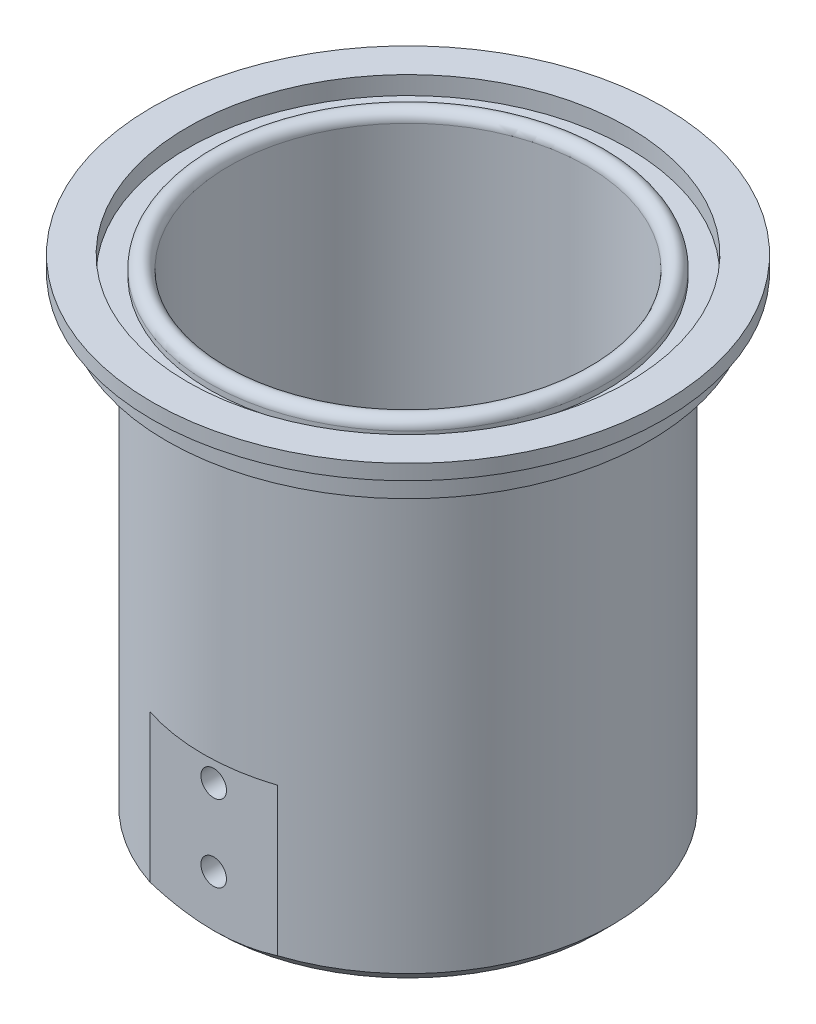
ISO-10303-21;
HEADER;
FILE_DESCRIPTION(('STEP AP214'),'2;1');
FILE_NAME('part.step','',(''),(''),'','','');
FILE_SCHEMA(('AUTOMOTIVE_DESIGN { 1 0 10303 214 1 1 1 1 }'));
ENDSEC;
DATA;
#1=APPLICATION_CONTEXT('core data for automotive mechanical design processes');
#2=APPLICATION_PROTOCOL_DEFINITION('international standard','automotive_design',2000,#1);
#3=PRODUCT_CONTEXT('',#1,'mechanical');
#4=PRODUCT('Part','Part','',(#3));
#5=PRODUCT_RELATED_PRODUCT_CATEGORY('part','',(#4));
#6=PRODUCT_DEFINITION_FORMATION('','',#4);
#7=PRODUCT_DEFINITION_CONTEXT('part definition',#1,'design');
#8=PRODUCT_DEFINITION('design','',#6,#7);
#9=PRODUCT_DEFINITION_SHAPE('','',#8);
#10=(LENGTH_UNIT() NAMED_UNIT(*) SI_UNIT(.MILLI.,.METRE.));
#11=(NAMED_UNIT(*) PLANE_ANGLE_UNIT() SI_UNIT($,.RADIAN.));
#12=(NAMED_UNIT(*) SI_UNIT($,.STERADIAN.) SOLID_ANGLE_UNIT());
#13=UNCERTAINTY_MEASURE_WITH_UNIT(LENGTH_MEASURE(1.E-05),#10,'distance_accuracy_value','');
#14=(GEOMETRIC_REPRESENTATION_CONTEXT(3) GLOBAL_UNCERTAINTY_ASSIGNED_CONTEXT((#13)) GLOBAL_UNIT_ASSIGNED_CONTEXT((#10,
#11,#12)) REPRESENTATION_CONTEXT('',''));
#15=CARTESIAN_POINT('',(0.,0.,0.));
#16=DIRECTION('',(0.,0.,1.));
#17=DIRECTION('',(1.,0.,0.));
#18=AXIS2_PLACEMENT_3D('',#15,#16,#17);
#19=CARTESIAN_POINT('',(0.,0.,0.));
#20=DIRECTION('',(0.,1.,0.));
#21=DIRECTION('',(0.,0.,1.));
#22=AXIS2_PLACEMENT_3D('',#19,#20,#21);
#23=CYLINDRICAL_SURFACE('',#22,50.8);
#24=CARTESIAN_POINT('',(0.,-13.4616219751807,0.));
#25=DIRECTION('',(0.,1.,0.));
#26=DIRECTION('',(0.,0.,1.));
#27=AXIS2_PLACEMENT_3D('',#24,#25,#26);
#28=CIRCLE('',#27,50.8);
#29=CARTESIAN_POINT('',(0.,-13.4616219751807,50.8));
#30=VERTEX_POINT('',#29);
#31=EDGE_CURVE('E252',#30,#30,#28,.T.);
#32=ORIENTED_EDGE('',*,*,#31,.F.);
#33=EDGE_LOOP('',(#32));
#34=FACE_BOUND('',#33,.T.);
#35=DIRECTION('',(0.,1.,0.));
#36=VECTOR('',#35,1.);
#37=CARTESIAN_POINT('',(15.8622949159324,0.,-48.2599999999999));
#38=LINE('',#37,#36);
#39=CARTESIAN_POINT('',(15.8622949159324,-82.0758929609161,-48.2599999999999));
#40=VERTEX_POINT('',#39);
#41=CARTESIAN_POINT('',(15.8622949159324,-118.745,-48.2599999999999));
#42=VERTEX_POINT('',#41);
#43=EDGE_CURVE('E49',#40,#42,#38,.F.);
#44=ORIENTED_EDGE('',*,*,#43,.F.);
#45=CARTESIAN_POINT('',(0.,-82.0758929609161,0.));
#46=DIRECTION('',(0.,1.,0.));
#47=DIRECTION('',(0.,0.,1.));
#48=AXIS2_PLACEMENT_3D('',#45,#46,#47);
#49=CIRCLE('',#48,50.8);
#50=CARTESIAN_POINT('',(-15.8622949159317,-82.0758929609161,-48.2600000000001));
#51=VERTEX_POINT('',#50);
#52=EDGE_CURVE('E11',#40,#51,#49,.T.);
#53=ORIENTED_EDGE('',*,*,#52,.T.);
#54=DIRECTION('',(0.,1.,0.));
#55=VECTOR('',#54,1.);
#56=CARTESIAN_POINT('',(-15.8622949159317,0.,-48.2600000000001));
#57=LINE('',#56,#55);
#58=CARTESIAN_POINT('',(-15.8622949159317,-118.745,-48.2600000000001));
#59=VERTEX_POINT('',#58);
#60=EDGE_CURVE('E111',#59,#51,#57,.T.);
#61=ORIENTED_EDGE('',*,*,#60,.F.);
#62=CARTESIAN_POINT('',(0.,-118.745,0.));
#63=DIRECTION('',(0.,1.,0.));
#64=DIRECTION('',(0.,0.,1.));
#65=AXIS2_PLACEMENT_3D('',#62,#63,#64);
#66=CIRCLE('',#65,50.8);
#67=CARTESIAN_POINT('',(-15.8622949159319,-118.745,48.26));
#68=VERTEX_POINT('',#67);
#69=EDGE_CURVE('E57',#59,#68,#66,.T.);
#70=ORIENTED_EDGE('',*,*,#69,.T.);
#71=DIRECTION('',(0.,1.,0.));
#72=VECTOR('',#71,1.);
#73=CARTESIAN_POINT('',(-15.8622949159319,0.,48.26));
#74=LINE('',#73,#72);
#75=CARTESIAN_POINT('',(-15.8622949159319,-82.0758929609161,48.26));
#76=VERTEX_POINT('',#75);
#77=EDGE_CURVE('E130',#76,#68,#74,.F.);
#78=ORIENTED_EDGE('',*,*,#77,.F.);
#79=CARTESIAN_POINT('',(0.,-82.0758929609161,0.));
#80=DIRECTION('',(0.,1.,0.));
#81=DIRECTION('',(0.,0.,1.));
#82=AXIS2_PLACEMENT_3D('',#79,#80,#81);
#83=CIRCLE('',#82,50.8);
#84=CARTESIAN_POINT('',(15.8622949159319,-82.0758929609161,48.26));
#85=VERTEX_POINT('',#84);
#86=EDGE_CURVE('E308',#76,#85,#83,.T.);
#87=ORIENTED_EDGE('',*,*,#86,.T.);
#88=DIRECTION('',(0.,1.,0.));
#89=VECTOR('',#88,1.);
#90=CARTESIAN_POINT('',(15.8622949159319,0.,48.26));
#91=LINE('',#90,#89);
#92=CARTESIAN_POINT('',(15.8622949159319,-118.745,48.26));
#93=VERTEX_POINT('',#92);
#94=EDGE_CURVE('E132',#93,#85,#91,.T.);
#95=ORIENTED_EDGE('',*,*,#94,.F.);
#96=EDGE_CURVE('E124',#93,#42,#66,.T.);
#97=ORIENTED_EDGE('',*,*,#96,.T.);
#98=EDGE_LOOP('',(#44,#53,#61,#70,#78,#87,#95,#97));
#99=FACE_BOUND('',#98,.T.);
#100=ADVANCED_FACE('F34',(#34,#99),#23,.T.);
#101=CARTESIAN_POINT('',(0.,-118.745,0.));
#102=DIRECTION('',(0.,1.,0.));
#103=DIRECTION('',(0.,0.,1.));
#104=AXIS2_PLACEMENT_3D('',#101,#102,#103);
#105=CONICAL_SURFACE('',#104,50.8,0.785398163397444);
#106=CARTESIAN_POINT('',(0.,-121.92,0.));
#107=DIRECTION('',(0.,1.,0.));
#108=DIRECTION('',(0.,0.,1.));
#109=AXIS2_PLACEMENT_3D('',#106,#107,#108);
#110=CIRCLE('',#109,47.625);
#111=CARTESIAN_POINT('',(0.,-121.92,47.625));
#112=VERTEX_POINT('',#111);
#113=EDGE_CURVE('E295',#112,#112,#110,.F.);
#114=ORIENTED_EDGE('',*,*,#113,.F.);
#115=EDGE_LOOP('',(#114));
#116=FACE_BOUND('',#115,.T.);
#117=ORIENTED_EDGE('',*,*,#69,.F.);
#118=CARTESIAN_POINT('',(-33.9181181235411,-110.557998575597,-48.2600000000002));
#119=CARTESIAN_POINT('',(-33.4876261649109,-110.805532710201,-48.2600000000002));
#120=CARTESIAN_POINT('',(-33.0557758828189,-111.050699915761,-48.2600000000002));
#121=CARTESIAN_POINT('',(-32.1892386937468,-111.535985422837,-48.2600000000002));
#122=CARTESIAN_POINT('',(-31.7545517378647,-111.77610363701,-48.2600000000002));
#123=CARTESIAN_POINT('',(-30.4458748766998,-112.488510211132,-48.2600000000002));
#124=CARTESIAN_POINT('',(-29.5674696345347,-112.952734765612,-48.2600000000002));
#125=CARTESIAN_POINT('',(-27.7946222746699,-113.858505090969,-48.2600000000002));
#126=CARTESIAN_POINT('',(-26.9001303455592,-114.299953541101,-48.2600000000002));
#127=CARTESIAN_POINT('',(-25.0978478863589,-115.154741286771,-48.2600000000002));
#128=CARTESIAN_POINT('',(-24.1900582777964,-115.568082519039,-48.2600000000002));
#129=CARTESIAN_POINT('',(-22.3466019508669,-116.368891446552,-48.2600000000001));
#130=CARTESIAN_POINT('',(-21.4107212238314,-116.755868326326,-48.2600000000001));
#131=CARTESIAN_POINT('',(-19.5243543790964,-117.492389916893,-48.2600000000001));
#132=CARTESIAN_POINT('',(-18.5738692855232,-117.841937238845,-48.2600000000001));
#133=CARTESIAN_POINT('',(-16.6597392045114,-118.498281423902,-48.2600000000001));
#134=CARTESIAN_POINT('',(-15.696115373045,-118.805139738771,-48.2600000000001));
#135=CARTESIAN_POINT('',(-13.7551098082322,-119.371605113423,-48.2600000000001));
#136=CARTESIAN_POINT('',(-12.7777301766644,-119.631219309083,-48.2600000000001));
#137=CARTESIAN_POINT('',(-11.1937128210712,-120.007273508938,-48.2600000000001));
#138=CARTESIAN_POINT('',(-10.5909318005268,-120.140096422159,-48.2600000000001));
#139=CARTESIAN_POINT('',(-9.3812218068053,-120.385217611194,-48.2600000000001));
#140=CARTESIAN_POINT('',(-8.77429306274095,-120.497517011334,-48.2600000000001));
#141=CARTESIAN_POINT('',(-7.55676096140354,-120.700635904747,-48.26));
#142=CARTESIAN_POINT('',(-6.94615711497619,-120.791452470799,-48.26));
#143=CARTESIAN_POINT('',(-5.7220799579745,-120.950745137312,-48.26));
#144=CARTESIAN_POINT('',(-5.10860686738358,-121.019222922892,-48.26));
#145=CARTESIAN_POINT('',(-3.88451108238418,-121.132721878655,-48.26));
#146=CARTESIAN_POINT('',(-3.27390565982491,-121.177928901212,-48.26));
#147=CARTESIAN_POINT('',(-2.05142624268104,-121.245274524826,-48.26));
#148=CARTESIAN_POINT('',(-1.43955226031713,-121.267413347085,-48.26));
#149=CARTESIAN_POINT('',(-0.215387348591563,-121.288399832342,-48.26));
#150=CARTESIAN_POINT('',(0.396903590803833,-121.2872469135,-48.26));
#151=CARTESIAN_POINT('',(1.62099985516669,-121.261661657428,-48.26));
#152=CARTESIAN_POINT('',(2.23280517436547,-121.237229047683,-48.26));
#153=CARTESIAN_POINT('',(3.547458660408,-121.159889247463,-48.26));
#154=CARTESIAN_POINT('',(4.25008876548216,-121.103235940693,-48.26));
#155=CARTESIAN_POINT('',(5.65230842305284,-120.960129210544,-48.26));
#156=CARTESIAN_POINT('',(6.35189789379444,-120.873674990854,-48.26));
#157=CARTESIAN_POINT('',(7.74702169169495,-120.67202772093,-48.2599999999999));
#158=CARTESIAN_POINT('',(8.44255536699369,-120.556830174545,-48.2599999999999));
#159=CARTESIAN_POINT('',(9.82851090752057,-120.299050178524,-48.2599999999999));
#160=CARTESIAN_POINT('',(10.5189327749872,-120.156467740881,-48.2599999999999));
#161=CARTESIAN_POINT('',(11.9023411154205,-119.843553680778,-48.2599999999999));
#162=CARTESIAN_POINT('',(12.5952552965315,-119.672903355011,-48.2599999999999));
#163=CARTESIAN_POINT('',(13.9745176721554,-119.306841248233,-48.2599999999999));
#164=CARTESIAN_POINT('',(14.6608656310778,-119.111428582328,-48.2599999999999));
#165=CARTESIAN_POINT('',(16.0263904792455,-118.697684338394,-48.2599999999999));
#166=CARTESIAN_POINT('',(16.7055693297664,-118.479359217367,-48.2599999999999));
#167=CARTESIAN_POINT('',(18.0567443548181,-118.021514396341,-48.2599999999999));
#168=CARTESIAN_POINT('',(18.7287403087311,-117.781994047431,-48.2599999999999));
#169=CARTESIAN_POINT('',(20.2772442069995,-117.204506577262,-48.2599999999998));
#170=CARTESIAN_POINT('',(21.1510892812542,-116.859392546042,-48.2599999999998));
#171=CARTESIAN_POINT('',(22.8863205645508,-116.139119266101,-48.2599999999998));
#172=CARTESIAN_POINT('',(23.7477058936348,-115.763957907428,-48.2599999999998));
#173=CARTESIAN_POINT('',(25.4587629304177,-114.986820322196,-48.2599999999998));
#174=CARTESIAN_POINT('',(26.3084288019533,-114.584831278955,-48.2599999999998));
#175=CARTESIAN_POINT('',(27.9961362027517,-113.757274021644,-48.2599999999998));
#176=CARTESIAN_POINT('',(28.8341780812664,-113.331706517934,-48.2599999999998));
#177=CARTESIAN_POINT('',(30.5022652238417,-112.45814388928,-48.2599999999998));
#178=CARTESIAN_POINT('',(31.3322714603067,-112.010074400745,-48.2599999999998));
#179=CARTESIAN_POINT('',(32.9819483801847,-111.095317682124,-48.2599999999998));
#180=CARTESIAN_POINT('',(33.8016189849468,-110.628630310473,-48.2599999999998));
#181=CARTESIAN_POINT('',(35.4311496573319,-109.678851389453,-48.2599999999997));
#182=CARTESIAN_POINT('',(36.2410117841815,-109.195763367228,-48.2599999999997));
#183=CARTESIAN_POINT('',(37.8517927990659,-108.214928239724,-48.2599999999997));
#184=CARTESIAN_POINT('',(38.6527117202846,-107.717181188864,-48.2599999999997));
#185=CARTESIAN_POINT('',(40.2083248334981,-106.732646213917,-48.2599999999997));
#186=CARTESIAN_POINT('',(40.9634037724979,-106.246465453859,-48.2599999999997));
#187=CARTESIAN_POINT('',(42.4666037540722,-105.263455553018,-48.2599999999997));
#188=CARTESIAN_POINT('',(43.2147246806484,-104.766626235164,-48.2599999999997));
#189=CARTESIAN_POINT('',(45.449518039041,-103.261735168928,-48.2599999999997));
#190=CARTESIAN_POINT('',(46.9265476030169,-102.239317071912,-48.2599999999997));
#191=CARTESIAN_POINT('',(49.1190626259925,-100.686829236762,-48.2599999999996));
#192=CARTESIAN_POINT('',(49.8429316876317,-100.168508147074,-48.2599999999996));
#193=CARTESIAN_POINT('',(51.2856227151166,-99.1248720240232,-48.2599999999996));
#194=CARTESIAN_POINT('',(52.0044446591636,-98.5995569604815,-48.2599999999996));
#195=CARTESIAN_POINT('',(53.4372055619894,-97.542718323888,-48.2599999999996));
#196=CARTESIAN_POINT('',(54.1511457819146,-97.0111964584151,-48.2599999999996));
#197=CARTESIAN_POINT('',(55.5746534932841,-95.9423555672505,-48.2599999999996));
#198=CARTESIAN_POINT('',(56.2842210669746,-95.4050366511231,-48.2599999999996));
#199=CARTESIAN_POINT('',(56.9917733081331,-94.8650841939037,-48.2599999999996));
#200=B_SPLINE_CURVE_WITH_KNOTS('',3,(#118,#119,#120,#121,#122,#123,#124,#125,#126,#127,#128,
#129,#130,#131,#132,#133,#134,#135,#136,#137,#138,#139,#140,#141,#142,#143,#144,#145,#146,#147,
#148,#149,#150,#151,#152,#153,#154,#155,#156,#157,#158,#159,#160,#161,#162,#163,#164,#165,#166,
#167,#168,#169,#170,#171,#172,#173,#174,#175,#176,#177,#178,#179,#180,#181,#182,#183,#184,#185,
#186,#187,#188,#189,#190,#191,#192,#193,#194,#195,#196,#197,#198,#199),.UNSPECIFIED.,.F.,.F.,(4,
2,2,2,2,2,2,2,2,2,2,2,2,2,2,2,2,2,2,2,2,2,2,2,2,2,2,2,2,2,2,2,2,2,2,2,2,2,2,2,4),(0.,
1.48974010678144,2.97950596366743,5.95973242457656,8.9517869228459,11.9436350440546,
14.9811178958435,18.0183887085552,21.0512410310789,24.0836348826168,25.9350497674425,
27.7863631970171,29.6379287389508,31.4893545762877,33.3257551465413,35.162138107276,
36.9985669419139,38.8350172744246,40.9490800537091,43.0631993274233,45.1776495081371,
47.2920987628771,49.4324650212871,51.572907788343,53.7127489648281,55.8526556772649,
58.6705742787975,61.4886909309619,64.308163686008,67.1275515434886,69.9569640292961,
72.7863980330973,75.6152273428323,78.4440461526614,81.138132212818,83.8322631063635,
89.2207860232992,91.8916758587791,94.5625772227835,97.2327603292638,99.9028930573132),.UNSPECIFIED.);
#201=EDGE_CURVE('E42',#59,#42,#200,.T.);
#202=ORIENTED_EDGE('',*,*,#201,.T.);
#203=ORIENTED_EDGE('',*,*,#96,.F.);
#204=CARTESIAN_POINT('',(-33.9181181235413,-110.557998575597,48.26));
#205=CARTESIAN_POINT('',(-33.4876261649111,-110.805532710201,48.26));
#206=CARTESIAN_POINT('',(-33.0557758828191,-111.050699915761,48.26));
#207=CARTESIAN_POINT('',(-32.189238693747,-111.535985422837,48.26));
#208=CARTESIAN_POINT('',(-31.7545517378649,-111.77610363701,48.26));
#209=CARTESIAN_POINT('',(-30.4458748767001,-112.488510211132,48.26));
#210=CARTESIAN_POINT('',(-29.5674696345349,-112.952734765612,48.26));
#211=CARTESIAN_POINT('',(-27.7946222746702,-113.858505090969,48.26));
#212=CARTESIAN_POINT('',(-26.9001303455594,-114.299953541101,48.26));
#213=CARTESIAN_POINT('',(-25.0978478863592,-115.154741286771,48.26));
#214=CARTESIAN_POINT('',(-24.1900582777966,-115.568082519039,48.26));
#215=CARTESIAN_POINT('',(-22.3466019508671,-116.368891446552,48.26));
#216=CARTESIAN_POINT('',(-21.4107212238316,-116.755868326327,48.26));
#217=CARTESIAN_POINT('',(-19.5243543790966,-117.492389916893,48.26));
#218=CARTESIAN_POINT('',(-18.5738692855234,-117.841937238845,48.26));
#219=CARTESIAN_POINT('',(-16.6597392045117,-118.498281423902,48.26));
#220=CARTESIAN_POINT('',(-15.6961153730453,-118.805139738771,48.26));
#221=CARTESIAN_POINT('',(-13.7551098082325,-119.371605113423,48.26));
#222=CARTESIAN_POINT('',(-12.7777301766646,-119.631219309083,48.26));
#223=CARTESIAN_POINT('',(-11.1937128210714,-120.007273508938,48.26));
#224=CARTESIAN_POINT('',(-10.590931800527,-120.140096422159,48.26));
#225=CARTESIAN_POINT('',(-9.38122180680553,-120.385217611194,48.26));
#226=CARTESIAN_POINT('',(-8.77429306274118,-120.497517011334,48.26));
#227=CARTESIAN_POINT('',(-7.55676096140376,-120.700635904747,48.26));
#228=CARTESIAN_POINT('',(-6.94615711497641,-120.791452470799,48.26));
#229=CARTESIAN_POINT('',(-5.72207995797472,-120.950745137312,48.26));
#230=CARTESIAN_POINT('',(-5.1086068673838,-121.019222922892,48.26));
#231=CARTESIAN_POINT('',(-3.8845110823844,-121.132721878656,48.26));
#232=CARTESIAN_POINT('',(-3.27390565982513,-121.177928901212,48.26));
#233=CARTESIAN_POINT('',(-2.05142624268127,-121.245274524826,48.26));
#234=CARTESIAN_POINT('',(-1.43955226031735,-121.267413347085,48.26));
#235=CARTESIAN_POINT('',(-0.215387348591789,-121.288399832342,48.26));
#236=CARTESIAN_POINT('',(0.396903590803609,-121.2872469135,48.26));
#237=CARTESIAN_POINT('',(1.62099985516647,-121.261661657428,48.26));
#238=CARTESIAN_POINT('',(2.23280517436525,-121.237229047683,48.26));
#239=CARTESIAN_POINT('',(3.54745866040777,-121.159889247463,48.26));
#240=CARTESIAN_POINT('',(4.25008876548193,-121.103235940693,48.26));
#241=CARTESIAN_POINT('',(5.65230842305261,-120.960129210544,48.26));
#242=CARTESIAN_POINT('',(6.3518978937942,-120.873674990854,48.26));
#243=CARTESIAN_POINT('',(7.74702169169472,-120.67202772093,48.26));
#244=CARTESIAN_POINT('',(8.44255536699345,-120.556830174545,48.26));
#245=CARTESIAN_POINT('',(9.82851090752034,-120.299050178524,48.26));
#246=CARTESIAN_POINT('',(10.518932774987,-120.156467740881,48.26));
#247=CARTESIAN_POINT('',(11.9023411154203,-119.843553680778,48.26));
#248=CARTESIAN_POINT('',(12.5952552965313,-119.672903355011,48.26));
#249=CARTESIAN_POINT('',(13.9745176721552,-119.306841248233,48.26));
#250=CARTESIAN_POINT('',(14.6608656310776,-119.111428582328,48.26));
#251=CARTESIAN_POINT('',(16.0263904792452,-118.697684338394,48.26));
#252=CARTESIAN_POINT('',(16.7055693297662,-118.479359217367,48.26));
#253=CARTESIAN_POINT('',(18.0567443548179,-118.021514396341,48.26));
#254=CARTESIAN_POINT('',(18.7287403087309,-117.781994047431,48.26));
#255=CARTESIAN_POINT('',(20.2772442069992,-117.204506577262,48.26));
#256=CARTESIAN_POINT('',(21.151089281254,-116.859392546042,48.26));
#257=CARTESIAN_POINT('',(22.8863205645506,-116.139119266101,48.26));
#258=CARTESIAN_POINT('',(23.7477058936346,-115.763957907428,48.26));
#259=CARTESIAN_POINT('',(25.4587629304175,-114.986820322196,48.26));
#260=CARTESIAN_POINT('',(26.3084288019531,-114.584831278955,48.26));
#261=CARTESIAN_POINT('',(27.9961362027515,-113.757274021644,48.26));
#262=CARTESIAN_POINT('',(28.8341780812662,-113.331706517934,48.26));
#263=CARTESIAN_POINT('',(30.5022652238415,-112.45814388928,48.26));
#264=CARTESIAN_POINT('',(31.3322714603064,-112.010074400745,48.26));
#265=CARTESIAN_POINT('',(32.9819483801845,-111.095317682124,48.26));
#266=CARTESIAN_POINT('',(33.8016189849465,-110.628630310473,48.26));
#267=CARTESIAN_POINT('',(35.4311496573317,-109.678851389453,48.26));
#268=CARTESIAN_POINT('',(36.2410117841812,-109.195763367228,48.26));
#269=CARTESIAN_POINT('',(37.8517927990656,-108.214928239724,48.26));
#270=CARTESIAN_POINT('',(38.6527117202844,-107.717181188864,48.26));
#271=CARTESIAN_POINT('',(40.2083248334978,-106.732646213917,48.26));
#272=CARTESIAN_POINT('',(40.9634037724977,-106.246465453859,48.26));
#273=CARTESIAN_POINT('',(42.466603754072,-105.263455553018,48.26));
#274=CARTESIAN_POINT('',(43.2147246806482,-104.766626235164,48.26));
#275=CARTESIAN_POINT('',(45.4495180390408,-103.261735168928,48.26));
#276=CARTESIAN_POINT('',(46.9265476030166,-102.239317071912,48.26));
#277=CARTESIAN_POINT('',(49.1190626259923,-100.686829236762,48.26));
#278=CARTESIAN_POINT('',(49.8429316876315,-100.168508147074,48.26));
#279=CARTESIAN_POINT('',(51.2856227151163,-99.1248720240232,48.26));
#280=CARTESIAN_POINT('',(52.0044446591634,-98.5995569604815,48.26));
#281=CARTESIAN_POINT('',(53.4372055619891,-97.5427183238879,48.26));
#282=CARTESIAN_POINT('',(54.1511457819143,-97.0111964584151,48.26));
#283=CARTESIAN_POINT('',(55.5746534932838,-95.9423555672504,48.26));
#284=CARTESIAN_POINT('',(56.2842210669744,-95.4050366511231,48.26));
#285=CARTESIAN_POINT('',(56.9917733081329,-94.8650841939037,48.26));
#286=B_SPLINE_CURVE_WITH_KNOTS('',3,(#204,#205,#206,#207,#208,#209,#210,#211,#212,#213,#214,
#215,#216,#217,#218,#219,#220,#221,#222,#223,#224,#225,#226,#227,#228,#229,#230,#231,#232,#233,
#234,#235,#236,#237,#238,#239,#240,#241,#242,#243,#244,#245,#246,#247,#248,#249,#250,#251,#252,
#253,#254,#255,#256,#257,#258,#259,#260,#261,#262,#263,#264,#265,#266,#267,#268,#269,#270,#271,
#272,#273,#274,#275,#276,#277,#278,#279,#280,#281,#282,#283,#284,#285),.UNSPECIFIED.,.F.,.F.,(4,
2,2,2,2,2,2,2,2,2,2,2,2,2,2,2,2,2,2,2,2,2,2,2,2,2,2,2,2,2,2,2,2,2,2,2,2,2,2,2,4),(0.,
1.48974010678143,2.97950596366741,5.95973242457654,8.95178692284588,11.9436350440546,
14.9811178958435,18.0183887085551,21.0512410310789,24.0836348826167,25.9350497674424,
27.7863631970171,29.6379287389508,31.4893545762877,33.3257551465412,35.1621381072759,
36.9985669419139,38.8350172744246,40.9490800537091,43.0631993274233,45.1776495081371,
47.292098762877,49.432465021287,51.5729077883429,53.7127489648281,55.8526556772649,
58.6705742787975,61.4886909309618,64.3081636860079,67.1275515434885,69.9569640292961,
72.7863980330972,75.6152273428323,78.4440461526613,81.1381322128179,83.8322631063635,
89.2207860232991,91.8916758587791,94.5625772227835,97.2327603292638,99.9028930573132),.UNSPECIFIED.);
#287=EDGE_CURVE('E301',#93,#68,#286,.F.);
#288=ORIENTED_EDGE('',*,*,#287,.T.);
#289=EDGE_LOOP('',(#117,#202,#203,#288));
#290=FACE_BOUND('',#289,.T.);
#291=ADVANCED_FACE('F173',(#116,#290),#105,.T.);
#292=CARTESIAN_POINT('',(0.,-115.57,0.));
#293=DIRECTION('',(0.,-1.,0.));
#294=DIRECTION('',(0.,0.,-1.));
#295=AXIS2_PLACEMENT_3D('',#292,#293,#294);
#296=PLANE('',#295);
#297=DIRECTION('',(0.,0.,-1.));
#298=VECTOR('',#297,1.);
#299=CARTESIAN_POINT('',(-17.145,-115.57,0.));
#300=LINE('',#299,#298);
#301=CARTESIAN_POINT('',(-17.145,-115.57,9.67203184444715));
#302=VERTEX_POINT('',#301);
#303=CARTESIAN_POINT('',(-17.145,-115.57,-9.67203184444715));
#304=VERTEX_POINT('',#303);
#305=EDGE_CURVE('E274',#302,#304,#300,.T.);
#306=ORIENTED_EDGE('',*,*,#305,.T.);
#307=CARTESIAN_POINT('',(0.,-115.57,0.));
#308=DIRECTION('',(0.,-1.,0.));
#309=DIRECTION('',(0.,0.,-1.));
#310=AXIS2_PLACEMENT_3D('',#307,#308,#309);
#311=CIRCLE('',#310,19.685);
#312=EDGE_CURVE('E291',#304,#302,#311,.T.);
#313=ORIENTED_EDGE('',*,*,#312,.T.);
#314=EDGE_LOOP('',(#306,#313));
#315=FACE_BOUND('',#314,.T.);
#316=CARTESIAN_POINT('',(0.,-115.57,0.));
#317=DIRECTION('',(0.,1.,0.));
#318=DIRECTION('',(0.,0.,1.));
#319=AXIS2_PLACEMENT_3D('',#316,#317,#318);
#320=CIRCLE('',#319,38.1);
#321=CARTESIAN_POINT('',(38.1,-115.57,0.));
#322=VERTEX_POINT('',#321);
#323=CARTESIAN_POINT('',(19.0500000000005,-115.57,-32.9955678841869));
#324=VERTEX_POINT('',#323);
#325=EDGE_CURVE('E139',#322,#324,#320,.T.);
#326=ORIENTED_EDGE('',*,*,#325,.T.);
#327=CARTESIAN_POINT('',(15.8750000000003,-115.57,-27.4963065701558));
#328=DIRECTION('',(0.,-1.,0.));
#329=DIRECTION('',(0.,0.,-1.));
#330=AXIS2_PLACEMENT_3D('',#327,#328,#329);
#331=CIRCLE('',#330,6.35);
#332=EDGE_CURVE('E193',#324,#324,#331,.T.);
#333=ORIENTED_EDGE('',*,*,#332,.T.);
#334=CARTESIAN_POINT('',(-19.0499999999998,-115.57,-32.9955678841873));
#335=VERTEX_POINT('',#334);
#336=EDGE_CURVE('E405',#324,#335,#320,.T.);
#337=ORIENTED_EDGE('',*,*,#336,.T.);
#338=CARTESIAN_POINT('',(-15.8749999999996,-115.57,-27.4963065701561));
#339=DIRECTION('',(0.,-1.,0.));
#340=DIRECTION('',(0.,0.,-1.));
#341=AXIS2_PLACEMENT_3D('',#338,#339,#340);
#342=CIRCLE('',#341,6.35);
#343=EDGE_CURVE('E192',#335,#335,#342,.T.);
#344=ORIENTED_EDGE('',*,*,#343,.T.);
#345=CARTESIAN_POINT('',(-38.1,-115.57,-2.77555756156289E-13));
#346=VERTEX_POINT('',#345);
#347=EDGE_CURVE('E409',#335,#346,#320,.T.);
#348=ORIENTED_EDGE('',*,*,#347,.T.);
#349=CARTESIAN_POINT('',(-31.7499999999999,-115.57,-2.22044604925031E-13));
#350=DIRECTION('',(0.,-1.,0.));
#351=DIRECTION('',(0.,0.,-1.));
#352=AXIS2_PLACEMENT_3D('',#349,#350,#351);
#353=CIRCLE('',#352,6.35);
#354=EDGE_CURVE('E199',#346,#346,#353,.T.);
#355=ORIENTED_EDGE('',*,*,#354,.T.);
#356=CARTESIAN_POINT('',(-19.0500000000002,-115.57,32.995567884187));
#357=VERTEX_POINT('',#356);
#358=EDGE_CURVE('E410',#346,#357,#320,.T.);
#359=ORIENTED_EDGE('',*,*,#358,.T.);
#360=CARTESIAN_POINT('',(-15.8750000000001,-115.57,27.4963065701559));
#361=DIRECTION('',(0.,-1.,0.));
#362=DIRECTION('',(0.,0.,-1.));
#363=AXIS2_PLACEMENT_3D('',#360,#361,#362);
#364=CIRCLE('',#363,6.35);
#365=EDGE_CURVE('E205',#357,#357,#364,.T.);
#366=ORIENTED_EDGE('',*,*,#365,.T.);
#367=CARTESIAN_POINT('',(19.05,-115.57,32.9955678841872));
#368=VERTEX_POINT('',#367);
#369=EDGE_CURVE('E135',#357,#368,#320,.T.);
#370=ORIENTED_EDGE('',*,*,#369,.T.);
#371=CARTESIAN_POINT('',(15.8749999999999,-115.57,27.496306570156));
#372=DIRECTION('',(0.,-1.,0.));
#373=DIRECTION('',(0.,0.,-1.));
#374=AXIS2_PLACEMENT_3D('',#371,#372,#373);
#375=CIRCLE('',#374,6.35);
#376=EDGE_CURVE('E234',#368,#368,#375,.T.);
#377=ORIENTED_EDGE('',*,*,#376,.T.);
#378=EDGE_CURVE('E136',#368,#322,#320,.T.);
#379=ORIENTED_EDGE('',*,*,#378,.T.);
#380=CARTESIAN_POINT('',(31.7499999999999,-115.57,0.));
#381=DIRECTION('',(0.,-1.,0.));
#382=DIRECTION('',(0.,0.,-1.));
#383=AXIS2_PLACEMENT_3D('',#380,#381,#382);
#384=CIRCLE('',#383,6.35);
#385=EDGE_CURVE('E233',#322,#322,#384,.T.);
#386=ORIENTED_EDGE('',*,*,#385,.T.);
#387=EDGE_LOOP('',(#326,#333,#337,#344,#348,#355,#359,#366,#370,#377,#379,#386));
#388=FACE_BOUND('',#387,.T.);
#389=ADVANCED_FACE('F371',(#315,#388),#296,.F.);
#390=CARTESIAN_POINT('',(0.,0.,0.));
#391=DIRECTION('',(0.,1.,0.));
#392=DIRECTION('',(0.,0.,1.));
#393=AXIS2_PLACEMENT_3D('',#390,#391,#392);
#394=CYLINDRICAL_SURFACE('',#393,44.45);
#395=CARTESIAN_POINT('',(0.,-3.17499336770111,0.));
#396=DIRECTION('',(0.,1.,0.));
#397=DIRECTION('',(0.,0.,1.));
#398=AXIS2_PLACEMENT_3D('',#395,#396,#397);
#399=CIRCLE('',#398,44.45);
#400=CARTESIAN_POINT('',(0.,-3.17499336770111,44.45));
#401=VERTEX_POINT('',#400);
#402=EDGE_CURVE('E271',#401,#401,#399,.T.);
#403=ORIENTED_EDGE('',*,*,#402,.T.);
#404=EDGE_LOOP('',(#403));
#405=FACE_BOUND('',#404,.T.);
#406=CARTESIAN_POINT('',(0.,-76.2,0.));
#407=DIRECTION('',(0.,-1.,0.));
#408=DIRECTION('',(0.,0.,-1.));
#409=AXIS2_PLACEMENT_3D('',#406,#407,#408);
#410=CIRCLE('',#409,44.45);
#411=CARTESIAN_POINT('',(0.,-76.2,-44.45));
#412=VERTEX_POINT('',#411);
#413=EDGE_CURVE('E298',#412,#412,#410,.F.);
#414=ORIENTED_EDGE('',*,*,#413,.F.);
#415=EDGE_LOOP('',(#414));
#416=FACE_BOUND('',#415,.T.);
#417=ADVANCED_FACE('F36',(#405,#416),#394,.F.);
#418=CARTESIAN_POINT('',(54.7751000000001,0.,0.));
#419=DIRECTION('',(0.,-1.,0.));
#420=DIRECTION('',(0.,0.,-1.));
#421=AXIS2_PLACEMENT_3D('',#418,#419,#420);
#422=PLANE('',#421);
#423=CARTESIAN_POINT('',(0.,0.,0.));
#424=DIRECTION('',(0.,1.,0.));
#425=DIRECTION('',(0.,0.,1.));
#426=AXIS2_PLACEMENT_3D('',#423,#424,#425);
#427=CIRCLE('',#426,54.7751);
#428=CARTESIAN_POINT('',(0.,0.,54.7751));
#429=VERTEX_POINT('',#428);
#430=EDGE_CURVE('E265',#429,#429,#427,.T.);
#431=ORIENTED_EDGE('',*,*,#430,.F.);
#432=EDGE_LOOP('',(#431));
#433=FACE_BOUND('',#432,.T.);
#434=CARTESIAN_POINT('',(0.,0.,0.));
#435=DIRECTION('',(0.,1.,0.));
#436=DIRECTION('',(0.,0.,1.));
#437=AXIS2_PLACEMENT_3D('',#434,#435,#436);
#438=CIRCLE('',#437,63.5);
#439=CARTESIAN_POINT('',(0.,0.,63.5));
#440=VERTEX_POINT('',#439);
#441=EDGE_CURVE('E240',#440,#440,#438,.T.);
#442=ORIENTED_EDGE('',*,*,#441,.T.);
#443=EDGE_LOOP('',(#442));
#444=FACE_BOUND('',#443,.T.);
#445=ADVANCED_FACE('F447',(#433,#444),#422,.F.);
#446=CARTESIAN_POINT('',(0.,0.,0.));
#447=DIRECTION('',(0.,1.,0.));
#448=DIRECTION('',(0.,0.,1.));
#449=AXIS2_PLACEMENT_3D('',#446,#447,#448);
#450=CYLINDRICAL_SURFACE('',#449,63.5);
#451=ORIENTED_EDGE('',*,*,#441,.F.);
#452=EDGE_LOOP('',(#451));
#453=FACE_BOUND('',#452,.T.);
#454=CARTESIAN_POINT('',(0.,-3.75920000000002,0.));
#455=DIRECTION('',(0.,1.,0.));
#456=DIRECTION('',(0.,0.,1.));
#457=AXIS2_PLACEMENT_3D('',#454,#455,#456);
#458=CIRCLE('',#457,63.5);
#459=CARTESIAN_POINT('',(0.,-3.75920000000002,63.5));
#460=VERTEX_POINT('',#459);
#461=EDGE_CURVE('E243',#460,#460,#458,.T.);
#462=ORIENTED_EDGE('',*,*,#461,.T.);
#463=EDGE_LOOP('',(#462));
#464=FACE_BOUND('',#463,.T.);
#465=ADVANCED_FACE('F449',(#453,#464),#450,.T.);
#466=CARTESIAN_POINT('',(0.,-5.06272299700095,0.));
#467=DIRECTION('',(0.,1.,0.));
#468=DIRECTION('',(0.,0.,1.));
#469=AXIS2_PLACEMENT_3D('',#466,#467,#468);
#470=CONICAL_SURFACE('',#469,59.9186,1.22173047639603);
#471=ORIENTED_EDGE('',*,*,#461,.F.);
#472=EDGE_LOOP('',(#471));
#473=FACE_BOUND('',#472,.T.);
#474=CARTESIAN_POINT('',(0.,-5.06272299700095,0.));
#475=DIRECTION('',(0.,1.,0.));
#476=DIRECTION('',(0.,0.,1.));
#477=AXIS2_PLACEMENT_3D('',#474,#475,#476);
#478=CIRCLE('',#477,59.9186);
#479=CARTESIAN_POINT('',(0.,-5.06272299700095,59.9186));
#480=VERTEX_POINT('',#479);
#481=EDGE_CURVE('E246',#480,#480,#478,.T.);
#482=ORIENTED_EDGE('',*,*,#481,.T.);
#483=EDGE_LOOP('',(#482));
#484=FACE_BOUND('',#483,.T.);
#485=ADVANCED_FACE('F455',(#473,#484),#470,.T.);
#486=CARTESIAN_POINT('',(0.,0.,0.));
#487=DIRECTION('',(0.,1.,0.));
#488=DIRECTION('',(0.,0.,1.));
#489=AXIS2_PLACEMENT_3D('',#486,#487,#488);
#490=CYLINDRICAL_SURFACE('',#489,59.9186);
#491=ORIENTED_EDGE('',*,*,#481,.F.);
#492=EDGE_LOOP('',(#491));
#493=FACE_BOUND('',#492,.T.);
#494=CARTESIAN_POINT('',(0.,-10.142722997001,0.));
#495=DIRECTION('',(0.,1.,0.));
#496=DIRECTION('',(0.,0.,1.));
#497=AXIS2_PLACEMENT_3D('',#494,#495,#496);
#498=CIRCLE('',#497,59.9186);
#499=CARTESIAN_POINT('',(0.,-10.142722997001,59.9186));
#500=VERTEX_POINT('',#499);
#501=EDGE_CURVE('E249',#500,#500,#498,.T.);
#502=ORIENTED_EDGE('',*,*,#501,.T.);
#503=EDGE_LOOP('',(#502));
#504=FACE_BOUND('',#503,.T.);
#505=ADVANCED_FACE('F467',(#493,#504),#490,.T.);
#506=CARTESIAN_POINT('',(0.,-13.4616219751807,0.));
#507=DIRECTION('',(0.,1.,0.));
#508=DIRECTION('',(0.,0.,1.));
#509=AXIS2_PLACEMENT_3D('',#506,#507,#508);
#510=CONICAL_SURFACE('',#509,50.8,1.22173047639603);
#511=ORIENTED_EDGE('',*,*,#501,.F.);
#512=EDGE_LOOP('',(#511));
#513=FACE_BOUND('',#512,.T.);
#514=ORIENTED_EDGE('',*,*,#31,.T.);
#515=EDGE_LOOP('',(#514));
#516=FACE_BOUND('',#515,.T.);
#517=ADVANCED_FACE('F385',(#513,#516),#510,.T.);
#518=CARTESIAN_POINT('',(50.8,-121.92,0.));
#519=DIRECTION('',(0.,1.,0.));
#520=DIRECTION('',(0.,0.,1.));
#521=AXIS2_PLACEMENT_3D('',#518,#519,#520);
#522=PLANE('',#521);
#523=ORIENTED_EDGE('',*,*,#113,.T.);
#524=EDGE_LOOP('',(#523));
#525=FACE_BOUND('',#524,.T.);
#526=CARTESIAN_POINT('',(0.,-121.92,0.));
#527=DIRECTION('',(0.,1.,0.));
#528=DIRECTION('',(0.,0.,1.));
#529=AXIS2_PLACEMENT_3D('',#526,#527,#528);
#530=CIRCLE('',#529,44.45);
#531=CARTESIAN_POINT('',(0.,-121.92,44.45));
#532=VERTEX_POINT('',#531);
#533=EDGE_CURVE('E255',#532,#532,#530,.T.);
#534=ORIENTED_EDGE('',*,*,#533,.T.);
#535=EDGE_LOOP('',(#534));
#536=FACE_BOUND('',#535,.T.);
#537=ADVANCED_FACE('F382',(#525,#536),#522,.F.);
#538=CARTESIAN_POINT('',(0.,-134.62,0.));
#539=DIRECTION('',(0.,1.,0.));
#540=DIRECTION('',(0.,0.,1.));
#541=AXIS2_PLACEMENT_3D('',#538,#539,#540);
#542=CONICAL_SURFACE('',#541,19.05,1.10714871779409);
#543=CARTESIAN_POINT('',(9.71290292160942,-128.839285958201,-29.0296234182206));
#544=CARTESIAN_POINT('',(9.62019048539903,-129.030674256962,-28.6570186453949));
#545=CARTESIAN_POINT('',(9.56109261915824,-129.221083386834,-28.2752363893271));
#546=CARTESIAN_POINT('',(9.51321197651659,-129.59431637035,-27.5027085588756));
#547=CARTESIAN_POINT('',(9.52452893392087,-129.777129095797,-27.1119510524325));
#548=CARTESIAN_POINT('',(9.59631447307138,-130.040351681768,-26.5270184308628));
#549=CARTESIAN_POINT('',(9.62952649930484,-130.126456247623,-26.3317667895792));
#550=CARTESIAN_POINT('',(9.71462872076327,-130.293847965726,-25.9433078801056));
#551=CARTESIAN_POINT('',(9.76651043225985,-130.37513728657,-25.7500997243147));
#552=CARTESIAN_POINT('',(9.88914685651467,-130.531753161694,-25.3673522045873));
#553=CARTESIAN_POINT('',(9.95989599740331,-130.607081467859,-25.1778117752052));
#554=CARTESIAN_POINT('',(10.1203605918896,-130.750556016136,-24.8041039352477));
#555=CARTESIAN_POINT('',(10.2100733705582,-130.818703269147,-24.6199357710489));
#556=CARTESIAN_POINT('',(10.3992736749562,-130.940637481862,-24.2754480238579));
#557=CARTESIAN_POINT('',(10.497116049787,-130.995167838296,-24.1144880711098));
#558=CARTESIAN_POINT('',(10.7080572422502,-131.096171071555,-23.8002278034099));
#559=CARTESIAN_POINT('',(10.8211530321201,-131.142645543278,-23.6469259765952));
#560=CARTESIAN_POINT('',(11.0619134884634,-131.226492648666,-23.3498367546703));
#561=CARTESIAN_POINT('',(11.1895609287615,-131.263875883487,-23.2060384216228));
#562=CARTESIAN_POINT('',(11.4586413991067,-131.328694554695,-22.9295278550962));
#563=CARTESIAN_POINT('',(11.6000717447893,-131.35613192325,-22.7968134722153));
#564=CARTESIAN_POINT('',(11.8731992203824,-131.39700156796,-22.5632191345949));
#565=CARTESIAN_POINT('',(12.0031540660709,-131.411920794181,-22.460555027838));
#566=CARTESIAN_POINT('',(12.2711343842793,-131.433755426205,-22.26542590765));
#567=CARTESIAN_POINT('',(12.4091588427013,-131.440671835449,-22.1729596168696));
#568=CARTESIAN_POINT('',(12.6920992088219,-131.446352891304,-21.9991068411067));
#569=CARTESIAN_POINT('',(12.8370123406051,-131.445120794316,-21.9177159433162));
#570=CARTESIAN_POINT('',(13.1325354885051,-131.434538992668,-21.7666536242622));
#571=CARTESIAN_POINT('',(13.2831453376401,-131.425189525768,-21.6969818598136));
#572=CARTESIAN_POINT('',(13.57594982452,-131.399688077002,-21.5751688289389));
#573=CARTESIAN_POINT('',(13.7177944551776,-131.384170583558,-21.5220486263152));
#574=CARTESIAN_POINT('',(14.0041940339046,-131.346748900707,-21.4262661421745));
#575=CARTESIAN_POINT('',(14.1487498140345,-131.324842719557,-21.3836071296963));
#576=CARTESIAN_POINT('',(14.4394918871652,-131.275006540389,-21.3088724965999));
#577=CARTESIAN_POINT('',(14.5856776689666,-131.24707838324,-21.2767936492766));
#578=CARTESIAN_POINT('',(14.8788442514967,-131.185601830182,-21.2231580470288));
#579=CARTESIAN_POINT('',(15.025825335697,-131.152051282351,-21.2016053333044));
#580=CARTESIAN_POINT('',(15.3261038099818,-131.078212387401,-21.1681935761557));
#581=CARTESIAN_POINT('',(15.4793963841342,-131.037693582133,-21.1567995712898));
#582=CARTESIAN_POINT('',(15.784995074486,-130.951579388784,-21.1451010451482));
#583=CARTESIAN_POINT('',(15.9373008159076,-130.905982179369,-21.1448005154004));
#584=CARTESIAN_POINT('',(16.3914940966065,-130.76239801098,-21.1601092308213));
#585=CARTESIAN_POINT('',(16.6908159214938,-130.657578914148,-21.1919119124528));
#586=CARTESIAN_POINT('',(17.3135464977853,-130.4200311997,-21.3023306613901));
#587=CARTESIAN_POINT('',(17.6352742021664,-130.285451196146,-21.3863129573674));
#588=CARTESIAN_POINT('',(18.2570598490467,-130.003856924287,-21.6008402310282));
#589=CARTESIAN_POINT('',(18.5571062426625,-129.856836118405,-21.7314098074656));
#590=CARTESIAN_POINT('',(19.1690135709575,-129.534574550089,-22.0550496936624));
#591=CARTESIAN_POINT('',(19.4770861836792,-129.358189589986,-22.2541440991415));
#592=CARTESIAN_POINT('',(20.0530525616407,-129.000396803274,-22.7005688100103));
#593=CARTESIAN_POINT('',(20.320928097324,-128.818986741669,-22.9479208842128));
#594=CARTESIAN_POINT('',(20.6981393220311,-128.539216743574,-23.3612645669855));
#595=CARTESIAN_POINT('',(20.8238901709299,-128.440878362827,-23.5126246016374));
#596=CARTESIAN_POINT('',(21.0609603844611,-128.244770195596,-23.8265707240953));
#597=CARTESIAN_POINT('',(21.1722843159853,-128.14700023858,-23.9891532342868));
#598=CARTESIAN_POINT('',(21.3796790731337,-127.952607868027,-24.324568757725));
#599=CARTESIAN_POINT('',(21.475741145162,-127.855986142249,-24.4974075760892));
#600=CARTESIAN_POINT('',(21.6516332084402,-127.664599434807,-24.8520368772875));
#601=CARTESIAN_POINT('',(21.7314699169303,-127.569833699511,-25.0338236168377));
#602=CARTESIAN_POINT('',(21.874575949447,-127.382109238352,-25.4064079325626));
#603=CARTESIAN_POINT('',(21.9377318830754,-127.289166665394,-25.597257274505));
#604=CARTESIAN_POINT('',(22.0459148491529,-127.106400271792,-25.9853870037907));
#605=CARTESIAN_POINT('',(22.0909492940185,-127.016575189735,-26.1826647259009));
#606=CARTESIAN_POINT('',(22.1621425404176,-126.840624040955,-26.5822377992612));
#607=CARTESIAN_POINT('',(22.1883003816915,-126.754498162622,-26.7845334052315));
#608=CARTESIAN_POINT('',(22.2210270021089,-126.586585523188,-27.1924862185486));
#609=CARTESIAN_POINT('',(22.2275971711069,-126.504798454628,-27.3981431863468));
#610=CARTESIAN_POINT('',(22.2207630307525,-126.350857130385,-27.7989073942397));
#611=CARTESIAN_POINT('',(22.2085084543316,-126.278419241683,-27.9939253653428));
#612=CARTESIAN_POINT('',(22.1657402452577,-126.138491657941,-28.3837310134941));
#613=CARTESIAN_POINT('',(22.1352284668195,-126.07100146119,-28.5785187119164));
#614=CARTESIAN_POINT('',(22.0557300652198,-125.941526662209,-28.9660644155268));
#615=CARTESIAN_POINT('',(22.0067510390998,-125.879539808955,-29.1588232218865));
#616=CARTESIAN_POINT('',(21.8902634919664,-125.761572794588,-29.5405456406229));
#617=CARTESIAN_POINT('',(21.8227567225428,-125.705592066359,-29.7295096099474));
#618=CARTESIAN_POINT('',(21.6762500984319,-125.604870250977,-30.085049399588));
#619=CARTESIAN_POINT('',(21.5988198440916,-125.559571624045,-30.2521152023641));
#620=CARTESIAN_POINT('',(21.4290394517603,-125.474744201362,-30.5800090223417));
#621=CARTESIAN_POINT('',(21.3366908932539,-125.435214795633,-30.74083769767));
#622=CARTESIAN_POINT('',(21.1375948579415,-125.362277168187,-31.0546935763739));
#623=CARTESIAN_POINT('',(21.0308535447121,-125.328866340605,-31.2077240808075));
#624=CARTESIAN_POINT('',(20.8036205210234,-125.268447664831,-31.5045641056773));
#625=CARTESIAN_POINT('',(20.6831297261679,-125.24143939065,-31.6483742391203));
#626=CARTESIAN_POINT('',(20.4396403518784,-125.19601136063,-31.9140355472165));
#627=CARTESIAN_POINT('',(20.3176476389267,-125.17707081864,-32.0367210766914));
#628=CARTESIAN_POINT('',(20.0636388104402,-125.144959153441,-32.2720551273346));
#629=CARTESIAN_POINT('',(19.931623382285,-125.131787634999,-32.3847043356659));
#630=CARTESIAN_POINT('',(19.6585603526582,-125.111326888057,-32.598980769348));
#631=CARTESIAN_POINT('',(19.5175151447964,-125.104036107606,-32.7006108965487));
#632=CARTESIAN_POINT('',(19.2274358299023,-125.095393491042,-32.8920334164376));
#633=CARTESIAN_POINT('',(19.0784018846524,-125.094041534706,-32.9818260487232));
#634=CARTESIAN_POINT('',(18.7804926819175,-125.097213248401,-33.1450347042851));
#635=CARTESIAN_POINT('',(18.6319213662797,-125.101471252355,-33.2190115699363));
#636=CARTESIAN_POINT('',(18.3296044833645,-125.115374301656,-33.3550521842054));
#637=CARTESIAN_POINT('',(18.1758572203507,-125.125021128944,-33.4171119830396));
#638=CARTESIAN_POINT('',(17.8644311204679,-125.149623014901,-33.5288867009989));
#639=CARTESIAN_POINT('',(17.7067540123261,-125.164575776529,-33.578606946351));
#640=CARTESIAN_POINT('',(17.3884890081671,-125.199683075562,-33.6655101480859));
#641=CARTESIAN_POINT('',(17.2279000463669,-125.219839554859,-33.7026884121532));
#642=CARTESIAN_POINT('',(16.9049365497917,-125.265213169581,-33.764382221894));
#643=CARTESIAN_POINT('',(16.7425611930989,-125.29043273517,-33.7888916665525));
#644=CARTESIAN_POINT('',(16.4171693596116,-125.345755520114,-33.825237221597));
#645=CARTESIAN_POINT('',(16.2541526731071,-125.37586049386,-33.8370687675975));
#646=CARTESIAN_POINT('',(15.9286698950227,-125.44073165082,-33.8481668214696));
#647=CARTESIAN_POINT('',(15.766203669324,-125.475496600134,-33.8474366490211));
#648=CARTESIAN_POINT('',(15.4427583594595,-125.549478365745,-33.8336467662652));
#649=CARTESIAN_POINT('',(15.2817798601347,-125.588696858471,-33.8205823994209));
#650=CARTESIAN_POINT('',(14.9555002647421,-125.673101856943,-33.781619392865));
#651=CARTESIAN_POINT('',(14.790309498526,-125.718472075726,-33.7551948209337));
#652=CARTESIAN_POINT('',(14.4636489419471,-125.813500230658,-33.6897183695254));
#653=CARTESIAN_POINT('',(14.3021805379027,-125.863159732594,-33.6506618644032));
#654=CARTESIAN_POINT('',(13.9840001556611,-125.96644078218,-33.5604600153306));
#655=CARTESIAN_POINT('',(13.8272872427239,-126.020061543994,-33.50931706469));
#656=CARTESIAN_POINT('',(13.5193880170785,-126.130984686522,-33.3955054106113));
#657=CARTESIAN_POINT('',(13.3682038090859,-126.188288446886,-33.3328323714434));
#658=CARTESIAN_POINT('',(13.0614288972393,-126.310542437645,-33.1916422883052));
#659=CARTESIAN_POINT('',(12.90631542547,-126.375745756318,-33.1123051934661));
#660=CARTESIAN_POINT('',(12.6042185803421,-126.509640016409,-32.9419110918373));
#661=CARTESIAN_POINT('',(12.4572382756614,-126.578332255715,-32.8508497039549));
#662=CARTESIAN_POINT('',(12.0296255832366,-126.789099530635,-32.5612787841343));
#663=CARTESIAN_POINT('',(11.762202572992,-126.935912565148,-32.3463271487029));
#664=CARTESIAN_POINT('',(11.2469936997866,-127.251842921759,-31.859820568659));
#665=CARTESIAN_POINT('',(11.0028281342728,-127.421794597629,-31.585001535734));
#666=CARTESIAN_POINT('',(10.5671114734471,-127.768946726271,-31.0007908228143));
#667=CARTESIAN_POINT('',(10.3755213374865,-127.946141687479,-30.6914250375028));
#668=CARTESIAN_POINT('',(10.1037689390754,-128.243311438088,-30.1557571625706));
#669=CARTESIAN_POINT('',(10.0078390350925,-128.36235919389,-29.9367710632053));
#670=CARTESIAN_POINT('',(9.84123850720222,-128.600826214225,-29.4895814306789));
#671=CARTESIAN_POINT('',(9.77056857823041,-128.720245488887,-29.2613776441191));
#672=CARTESIAN_POINT('',(9.71290292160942,-128.839285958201,-29.0296234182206));
#673=B_SPLINE_CURVE_WITH_KNOTS('',3,(#543,#544,#545,#546,#547,#548,#549,#550,#551,#552,#553,
#554,#555,#556,#557,#558,#559,#560,#561,#562,#563,#564,#565,#566,#567,#568,#569,#570,#571,#572,
#573,#574,#575,#576,#577,#578,#579,#580,#581,#582,#583,#584,#585,#586,#587,#588,#589,#590,#591,
#592,#593,#594,#595,#596,#597,#598,#599,#600,#601,#602,#603,#604,#605,#606,#607,#608,#609,#610,
#611,#612,#613,#614,#615,#616,#617,#618,#619,#620,#621,#622,#623,#624,#625,#626,#627,#628,#629,
#630,#631,#632,#633,#634,#635,#636,#637,#638,#639,#640,#641,#642,#643,#644,#645,#646,#647,#648,
#649,#650,#651,#652,#653,#654,#655,#656,#657,#658,#659,#660,#661,#662,#663,#664,#665,#666,#667,
#668,#669,#670,#671,#672),.UNSPECIFIED.,.T.,.F.,(4,2,2,2,2,2,2,2,2,2,2,2,2,2,2,2,2,2,2,2,2,2,2,
2,2,2,2,2,2,2,2,2,2,2,2,2,2,2,2,2,2,2,2,2,2,2,2,2,2,2,2,2,2,2,2,2,2,2,2,2,2,2,2,2,4),(0.,
1.2861910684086,2.57420428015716,3.22137538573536,3.86825277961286,4.51493935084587,
5.16153476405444,5.74897499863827,6.33629879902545,6.92293441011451,7.50945599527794,
8.00764001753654,8.5057615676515,9.00368406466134,9.50159197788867,9.95784770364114,
10.4142458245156,10.8705046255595,11.3269384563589,11.8033289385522,12.2798908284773,
13.2325277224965,14.304525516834,15.377090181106,16.5931255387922,17.809710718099,
18.4690235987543,19.1281272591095,19.787607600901,20.4468143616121,21.1103931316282,
21.7737001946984,22.4370409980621,23.1003347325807,23.724697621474,24.3489971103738,
24.9730400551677,25.5970240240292,26.1651555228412,26.7332269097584,27.30105579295,
27.8688468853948,28.3903334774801,28.9117843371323,29.4330975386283,29.9544001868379,
30.4518817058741,30.9495278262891,31.4469587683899,31.9445756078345,32.4424318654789,
32.9404673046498,33.4383711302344,33.9364630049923,34.4558969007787,34.9755212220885,
35.495042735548,36.0147600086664,36.572217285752,37.1298834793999,38.2448021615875,
39.4548140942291,40.6639250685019,41.4638933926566,42.2638837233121),.UNSPECIFIED.);
#674=CARTESIAN_POINT('',(9.71290292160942,-128.839285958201,-29.0296234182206));
#675=VERTEX_POINT('',#674);
#676=EDGE_CURVE('E187',#675,#675,#673,.T.);
#677=ORIENTED_EDGE('',*,*,#676,.T.);
#678=EDGE_LOOP('',(#677));
#679=FACE_BOUND('',#678,.T.);
#680=CARTESIAN_POINT('',(-21.5198158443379,-127.807392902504,-24.5879472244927));
#681=CARTESIAN_POINT('',(-21.4284519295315,-127.904199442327,-24.4106159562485));
#682=CARTESIAN_POINT('',(-21.3289252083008,-128.001877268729,-24.2379766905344));
#683=CARTESIAN_POINT('',(-21.1144090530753,-128.198379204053,-23.9031692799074));
#684=CARTESIAN_POINT('',(-20.9994135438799,-128.29720374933,-23.7410052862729));
#685=CARTESIAN_POINT('',(-20.7547068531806,-128.495458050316,-23.4280808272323));
#686=CARTESIAN_POINT('',(-20.6249739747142,-128.594888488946,-23.2773377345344));
#687=CARTESIAN_POINT('',(-20.351856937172,-128.79351847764,-22.9885583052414));
#688=CARTESIAN_POINT('',(-20.2084675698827,-128.892717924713,-22.850526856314));
#689=CARTESIAN_POINT('',(-19.7593472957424,-129.188775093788,-22.457206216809));
#690=CARTESIAN_POINT('',(-19.4343857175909,-129.384317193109,-22.2223350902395));
#691=CARTESIAN_POINT('',(-18.7413827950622,-129.764856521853,-21.8158497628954));
#692=CARTESIAN_POINT('',(-18.3733525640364,-129.949856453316,-21.6442192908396));
#693=CARTESIAN_POINT('',(-17.8013875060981,-130.210767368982,-21.4422920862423));
#694=CARTESIAN_POINT('',(-17.6100825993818,-130.293971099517,-21.384651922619));
#695=CARTESIAN_POINT('',(-17.2207193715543,-130.454785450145,-21.287301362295));
#696=CARTESIAN_POINT('',(-17.0226646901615,-130.532399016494,-21.2475814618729));
#697=CARTESIAN_POINT('',(-16.6212467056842,-130.680811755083,-21.1870422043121));
#698=CARTESIAN_POINT('',(-16.4178850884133,-130.751613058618,-21.1662169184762));
#699=CARTESIAN_POINT('',(-16.0074607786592,-130.885111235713,-21.1443653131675));
#700=CARTESIAN_POINT('',(-15.8003987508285,-130.947809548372,-21.1433354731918));
#701=CARTESIAN_POINT('',(-15.4089746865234,-131.056920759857,-21.1607664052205));
#702=CARTESIAN_POINT('',(-15.2248023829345,-131.104381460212,-21.1769525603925));
#703=CARTESIAN_POINT('',(-14.8566841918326,-131.190983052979,-21.2257414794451));
#704=CARTESIAN_POINT('',(-14.6727382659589,-131.230125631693,-21.2583409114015));
#705=CARTESIAN_POINT('',(-14.3070197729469,-131.299184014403,-21.340089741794));
#706=CARTESIAN_POINT('',(-14.1252449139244,-131.329110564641,-21.3892197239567));
#707=CARTESIAN_POINT('',(-13.7655729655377,-131.379054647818,-21.503942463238));
#708=CARTESIAN_POINT('',(-13.5876752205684,-131.399073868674,-21.5695324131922));
#709=CARTESIAN_POINT('',(-13.2637641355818,-131.42647742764,-21.705790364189));
#710=CARTESIAN_POINT('',(-13.1169405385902,-131.435297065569,-21.774256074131));
#711=CARTESIAN_POINT('',(-12.8287613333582,-131.445199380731,-21.9223346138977));
#712=CARTESIAN_POINT('',(-12.6874051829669,-131.446282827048,-22.0019463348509));
#713=CARTESIAN_POINT('',(-12.4113531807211,-131.440691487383,-22.1716564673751));
#714=CARTESIAN_POINT('',(-12.2766555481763,-131.434018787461,-22.2617520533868));
#715=CARTESIAN_POINT('',(-12.0149241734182,-131.413054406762,-22.4516603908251));
#716=CARTESIAN_POINT('',(-11.887890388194,-131.398762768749,-22.5514730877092));
#717=CARTESIAN_POINT('',(-11.6500049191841,-131.36395757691,-22.7534450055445));
#718=CARTESIAN_POINT('',(-11.5386382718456,-131.343884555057,-22.8550753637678));
#719=CARTESIAN_POINT('',(-11.3240131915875,-131.297606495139,-23.065325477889));
#720=CARTESIAN_POINT('',(-11.2207573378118,-131.271399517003,-23.1739474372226));
#721=CARTESIAN_POINT('',(-11.0228965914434,-131.213265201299,-23.3973009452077));
#722=CARTESIAN_POINT('',(-10.9282894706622,-131.181339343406,-23.5120309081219));
#723=CARTESIAN_POINT('',(-10.7480106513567,-131.11219898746,-23.7468528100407));
#724=CARTESIAN_POINT('',(-10.6623423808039,-131.074982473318,-23.8669467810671));
#725=CARTESIAN_POINT('',(-10.4950981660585,-130.993238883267,-24.1193999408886));
#726=CARTESIAN_POINT('',(-10.4141212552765,-130.948398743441,-24.2520549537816));
#727=CARTESIAN_POINT('',(-10.2627258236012,-130.853855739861,-24.5216125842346));
#728=CARTESIAN_POINT('',(-10.1923111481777,-130.804151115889,-24.6585167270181));
#729=CARTESIAN_POINT('',(-9.9970659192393,-130.648596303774,-25.0743126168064));
#730=CARTESIAN_POINT('',(-9.8881537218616,-130.536264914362,-25.3584105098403));
#731=CARTESIAN_POINT('',(-9.7012494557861,-130.283030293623,-25.9720328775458));
#732=CARTESIAN_POINT('',(-9.62923335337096,-130.140312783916,-26.3026051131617));
#733=CARTESIAN_POINT('',(-9.53832448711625,-129.843586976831,-26.9660157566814));
#734=CARTESIAN_POINT('',(-9.51945976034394,-129.689572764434,-27.2988552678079));
#735=CARTESIAN_POINT('',(-9.53422634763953,-129.354485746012,-28.0026603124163));
#736=CARTESIAN_POINT('',(-9.57490830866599,-129.172477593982,-28.3730345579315));
#737=CARTESIAN_POINT('',(-9.71961393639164,-128.805002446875,-29.099714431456));
#738=CARTESIAN_POINT('',(-9.82366419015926,-128.619534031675,-29.456014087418));
#739=CARTESIAN_POINT('',(-10.0297107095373,-128.335943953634,-29.9851591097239));
#740=CARTESIAN_POINT('',(-10.1102167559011,-128.237261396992,-30.1663524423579));
#741=CARTESIAN_POINT('',(-10.288054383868,-128.04092442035,-30.5208416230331));
#742=CARTESIAN_POINT('',(-10.3853802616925,-127.943269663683,-30.6941401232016));
#743=CARTESIAN_POINT('',(-10.5963725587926,-127.749569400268,-31.0315891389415));
#744=CARTESIAN_POINT('',(-10.7100476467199,-127.6535247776,-31.1957347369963));
#745=CARTESIAN_POINT('',(-10.9530215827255,-127.463756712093,-31.5133431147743));
#746=CARTESIAN_POINT('',(-11.082313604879,-127.370032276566,-31.6668105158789));
#747=CARTESIAN_POINT('',(-11.3549363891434,-127.18608493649,-31.9607715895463));
#748=CARTESIAN_POINT('',(-11.4981704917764,-127.095843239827,-32.1013430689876));
#749=CARTESIAN_POINT('',(-11.7984646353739,-126.918872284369,-32.3691718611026));
#750=CARTESIAN_POINT('',(-11.9555187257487,-126.832141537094,-32.4964348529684));
#751=CARTESIAN_POINT('',(-12.2825085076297,-126.662769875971,-32.7363084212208));
#752=CARTESIAN_POINT('',(-12.4524441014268,-126.580128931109,-32.8489191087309));
#753=CARTESIAN_POINT('',(-12.8040235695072,-126.419564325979,-33.0580899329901));
#754=CARTESIAN_POINT('',(-12.9856665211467,-126.341640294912,-33.1546513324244));
#755=CARTESIAN_POINT('',(-13.3467831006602,-126.19617762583,-33.3244903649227));
#756=CARTESIAN_POINT('',(-13.5255880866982,-126.128292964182,-33.3988938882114));
#757=CARTESIAN_POINT('',(-13.8909195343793,-125.997692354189,-33.5315098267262));
#758=CARTESIAN_POINT('',(-14.077445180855,-125.934975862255,-33.5897239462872));
#759=CARTESIAN_POINT('',(-14.4567028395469,-125.815240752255,-33.6889909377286));
#760=CARTESIAN_POINT('',(-14.6494321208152,-125.75821967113,-33.7300512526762));
#761=CARTESIAN_POINT('',(-15.0395521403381,-125.650342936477,-33.7942103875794));
#762=CARTESIAN_POINT('',(-15.2369424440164,-125.599486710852,-33.8173108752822));
#763=CARTESIAN_POINT('',(-15.6165378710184,-125.508729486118,-33.8436320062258));
#764=CARTESIAN_POINT('',(-15.798494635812,-125.468253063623,-33.8484671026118));
#765=CARTESIAN_POINT('',(-16.1633387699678,-125.393116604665,-33.8423792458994));
#766=CARTESIAN_POINT('',(-16.3462260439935,-125.358455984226,-33.8314578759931));
#767=CARTESIAN_POINT('',(-16.7113375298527,-125.295259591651,-33.7936640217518));
#768=CARTESIAN_POINT('',(-16.8935619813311,-125.266721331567,-33.7667980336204));
#769=CARTESIAN_POINT('',(-17.2558309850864,-125.216009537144,-33.6970986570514));
#770=CARTESIAN_POINT('',(-17.4358756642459,-125.19383563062,-33.6542662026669));
#771=CARTESIAN_POINT('',(-17.7784771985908,-125.157509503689,-33.5567126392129));
#772=CARTESIAN_POINT('',(-17.9413154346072,-125.142872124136,-33.5031567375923));
#773=CARTESIAN_POINT('',(-18.2624806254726,-125.119316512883,-33.3828873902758));
#774=CARTESIAN_POINT('',(-18.4208078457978,-125.110397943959,-33.3161747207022));
#775=CARTESIAN_POINT('',(-18.731675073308,-125.098355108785,-33.1700530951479));
#776=CARTESIAN_POINT('',(-18.8842164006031,-125.095229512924,-33.0906470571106));
#777=CARTESIAN_POINT('',(-19.1823606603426,-125.094794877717,-32.9197178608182));
#778=CARTESIAN_POINT('',(-19.3279636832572,-125.097485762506,-32.8281948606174));
#779=CARTESIAN_POINT('',(-19.6057600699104,-125.108449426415,-32.6374386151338));
#780=CARTESIAN_POINT('',(-19.7382522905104,-125.116507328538,-32.5386276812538));
#781=CARTESIAN_POINT('',(-19.9949213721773,-125.137927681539,-32.3311782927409));
#782=CARTESIAN_POINT('',(-20.1190954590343,-125.151291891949,-32.2225365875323));
#783=CARTESIAN_POINT('',(-20.358222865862,-125.183216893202,-31.996338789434));
#784=CARTESIAN_POINT('',(-20.4731797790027,-125.201775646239,-31.8787862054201));
#785=CARTESIAN_POINT('',(-20.693270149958,-125.243962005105,-31.6355914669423));
#786=CARTESIAN_POINT('',(-20.7983999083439,-125.267591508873,-31.5099462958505));
#787=CARTESIAN_POINT('',(-20.9990572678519,-125.31996828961,-31.2504597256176));
#788=CARTESIAN_POINT('',(-21.0944951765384,-125.348757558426,-31.1165574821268));
#789=CARTESIAN_POINT('',(-21.2742888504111,-125.411123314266,-30.8425056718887));
#790=CARTESIAN_POINT('',(-21.3586405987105,-125.444701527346,-30.7023538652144));
#791=CARTESIAN_POINT('',(-21.5158388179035,-125.516400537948,-30.4169188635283));
#792=CARTESIAN_POINT('',(-21.5886886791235,-125.554519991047,-30.2716371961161));
#793=CARTESIAN_POINT('',(-21.7226920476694,-125.635079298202,-29.9768750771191));
#794=CARTESIAN_POINT('',(-21.7838411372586,-125.677520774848,-29.8273930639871));
#795=CARTESIAN_POINT('',(-21.8969784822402,-125.768637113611,-29.5178750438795));
#796=CARTESIAN_POINT('',(-21.9483704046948,-125.817515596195,-29.3576809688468));
#797=CARTESIAN_POINT('',(-22.0380569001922,-125.919439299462,-29.0349096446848));
#798=CARTESIAN_POINT('',(-22.0763466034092,-125.972486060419,-28.8723315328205));
#799=CARTESIAN_POINT('',(-22.1398612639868,-126.082423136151,-28.5459075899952));
#800=CARTESIAN_POINT('',(-22.165084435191,-126.1393139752,-28.3820615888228));
#801=CARTESIAN_POINT('',(-22.2026079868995,-126.256631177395,-28.0541020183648));
#802=CARTESIAN_POINT('',(-22.2149036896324,-126.317058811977,-27.889988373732));
#803=CARTESIAN_POINT('',(-22.2272227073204,-126.445883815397,-27.5499312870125));
#804=CARTESIAN_POINT('',(-22.2262317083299,-126.514536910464,-27.3740466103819));
#805=CARTESIAN_POINT('',(-22.2098554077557,-126.655161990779,-27.02426548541));
#806=CARTESIAN_POINT('',(-22.1944638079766,-126.7271354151,-26.8503699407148));
#807=CARTESIAN_POINT('',(-22.1272848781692,-126.947292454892,-26.3336753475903));
#808=CARTESIAN_POINT('',(-22.0545145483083,-127.099964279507,-25.9952040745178));
#809=CARTESIAN_POINT('',(-21.8995070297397,-127.346159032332,-25.4798345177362));
#810=CARTESIAN_POINT('',(-21.8347809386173,-127.43690186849,-25.2960164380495));
#811=CARTESIAN_POINT('',(-21.689195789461,-127.620621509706,-24.9359799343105));
#812=CARTESIAN_POINT('',(-21.6083372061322,-127.713598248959,-24.7597612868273));
#813=CARTESIAN_POINT('',(-21.5198158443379,-127.807392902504,-24.5879472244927));
#814=B_SPLINE_CURVE_WITH_KNOTS('',3,(#680,#681,#682,#683,#684,#685,#686,#687,#688,#689,#690,
#691,#692,#693,#694,#695,#696,#697,#698,#699,#700,#701,#702,#703,#704,#705,#706,#707,#708,#709,
#710,#711,#712,#713,#714,#715,#716,#717,#718,#719,#720,#721,#722,#723,#724,#725,#726,#727,#728,
#729,#730,#731,#732,#733,#734,#735,#736,#737,#738,#739,#740,#741,#742,#743,#744,#745,#746,#747,
#748,#749,#750,#751,#752,#753,#754,#755,#756,#757,#758,#759,#760,#761,#762,#763,#764,#765,#766,
#767,#768,#769,#770,#771,#772,#773,#774,#775,#776,#777,#778,#779,#780,#781,#782,#783,#784,#785,
#786,#787,#788,#789,#790,#791,#792,#793,#794,#795,#796,#797,#798,#799,#800,#801,#802,#803,#804,
#805,#806,#807,#808,#809,#810,#811,#812,#813),.UNSPECIFIED.,.T.,.F.,(4,2,2,2,2,2,2,2,2,2,2,2,2,
2,2,2,2,2,2,2,2,2,2,2,2,2,2,2,2,2,2,2,2,2,2,2,2,2,2,2,2,2,2,2,2,2,2,2,2,2,2,2,2,2,2,2,2,2,2,2,2,
2,2,2,2,2,4),(0.,0.664984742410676,1.3302314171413,1.99647050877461,2.66296471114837,
3.9944575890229,5.32560764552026,5.97414769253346,6.6223433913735,7.27033563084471,
7.9182126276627,8.49000823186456,9.0616878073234,9.63269823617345,10.2036113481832,
10.6897021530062,11.1757446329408,11.6616564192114,12.1475654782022,12.603358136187,
13.0592951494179,13.515114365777,13.9711077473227,14.4558654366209,14.9407991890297,
15.910214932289,17.0075419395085,18.1054476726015,19.3443080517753,20.5836885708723,
21.247450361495,21.9109875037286,22.5748777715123,23.2384789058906,23.8977689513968,
24.5567764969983,25.2157790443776,25.8747297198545,26.489572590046,27.1043507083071,
27.7188617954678,28.3333158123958,28.8919845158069,29.4505970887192,30.0089822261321,
30.5673347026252,31.0828201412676,31.5982751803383,32.1136118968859,32.6289418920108,
33.1247891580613,33.6208009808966,34.1166184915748,34.6126219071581,35.1128621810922,
35.6132832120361,36.1135564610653,36.6140182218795,37.1390235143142,37.6642237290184,
38.189495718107,38.7149577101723,39.2807481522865,39.8467861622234,40.9767526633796,
41.621067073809,42.2653625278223),.UNSPECIFIED.);
#815=CARTESIAN_POINT('',(-21.5198158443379,-127.807392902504,-24.5879472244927));
#816=VERTEX_POINT('',#815);
#817=EDGE_CURVE('E194',#816,#816,#814,.T.);
#818=ORIENTED_EDGE('',*,*,#817,.T.);
#819=EDGE_LOOP('',(#818));
#820=FACE_BOUND('',#819,.T.);
#821=CARTESIAN_POINT('',(-29.4187752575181,-129.142064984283,-5.90659731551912));
#822=CARTESIAN_POINT('',(-29.6037199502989,-129.044217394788,-5.97959238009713));
#823=CARTESIAN_POINT('',(-29.7917748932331,-128.945684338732,-6.04377321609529));
#824=CARTESIAN_POINT('',(-30.1728336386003,-128.747970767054,-6.15421871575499));
#825=CARTESIAN_POINT('',(-30.3658392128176,-128.648790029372,-6.20047686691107));
#826=CARTESIAN_POINT('',(-30.7557016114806,-128.450363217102,-6.27481599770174));
#827=CARTESIAN_POINT('',(-30.9525642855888,-128.351117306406,-6.30286674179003));
#828=CARTESIAN_POINT('',(-31.3484367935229,-128.153401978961,-6.34040821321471));
#829=CARTESIAN_POINT('',(-31.5474465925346,-128.054932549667,-6.34989924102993));
#830=CARTESIAN_POINT('',(-31.9463220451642,-127.859348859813,-6.3500992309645));
#831=CARTESIAN_POINT('',(-32.1461882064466,-127.76223561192,-6.34079484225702));
#832=CARTESIAN_POINT('',(-32.5450555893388,-127.570109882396,-6.30321315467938));
#833=CARTESIAN_POINT('',(-32.744057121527,-127.475096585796,-6.27494335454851));
#834=CARTESIAN_POINT('',(-33.139694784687,-127.287763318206,-6.19933926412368));
#835=CARTESIAN_POINT('',(-33.3363309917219,-127.195443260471,-6.15200558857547));
#836=CARTESIAN_POINT('',(-33.7254996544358,-127.014164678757,-6.03829229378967));
#837=CARTESIAN_POINT('',(-33.9180340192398,-126.925204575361,-5.97192175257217));
#838=CARTESIAN_POINT('',(-34.2913092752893,-126.754007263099,-5.82265869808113));
#839=CARTESIAN_POINT('',(-34.47223047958,-126.671646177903,-5.74035964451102));
#840=CARTESIAN_POINT('',(-34.8269559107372,-126.511243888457,-5.55828793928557));
#841=CARTESIAN_POINT('',(-35.0007634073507,-126.433200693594,-5.45852342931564));
#842=CARTESIAN_POINT('',(-35.3396291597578,-126.281984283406,-5.24189850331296));
#843=CARTESIAN_POINT('',(-35.5046877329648,-126.208810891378,-5.1250387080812));
#844=CARTESIAN_POINT('',(-35.8242940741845,-126.067925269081,-4.87481348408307));
#845=CARTESIAN_POINT('',(-35.9788428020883,-126.00021253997,-4.74144956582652));
#846=CARTESIAN_POINT('',(-36.2635582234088,-125.876105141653,-4.47053727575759));
#847=CARTESIAN_POINT('',(-36.3946855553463,-125.819237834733,-4.33421402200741));
#848=CARTESIAN_POINT('',(-36.6451942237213,-125.711053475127,-4.04914412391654));
#849=CARTESIAN_POINT('',(-36.7645768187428,-125.659735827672,-3.90039881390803));
#850=CARTESIAN_POINT('',(-36.9902149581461,-125.563100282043,-3.59154656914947));
#851=CARTESIAN_POINT('',(-37.0964765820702,-125.517779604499,-3.43144495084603));
#852=CARTESIAN_POINT('',(-37.2946651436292,-125.43351728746,-3.10101491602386));
#853=CARTESIAN_POINT('',(-37.3865932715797,-125.394575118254,-2.93068735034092));
#854=CARTESIAN_POINT('',(-37.5474457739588,-125.3266113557,-2.59679389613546));
#855=CARTESIAN_POINT('',(-37.617690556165,-125.297014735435,-2.43397978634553));
#856=CARTESIAN_POINT('',(-37.7445604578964,-125.243661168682,-2.10220813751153));
#857=CARTESIAN_POINT('',(-37.8011867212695,-125.219903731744,-1.93325111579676));
#858=CARTESIAN_POINT('',(-37.9001604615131,-125.178437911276,-1.59054327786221));
#859=CARTESIAN_POINT('',(-37.9425128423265,-125.160727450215,-1.41679413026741));
#860=CARTESIAN_POINT('',(-38.0124673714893,-125.13150127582,-1.06583912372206));
#861=CARTESIAN_POINT('',(-38.0400700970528,-125.119985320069,-0.888633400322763));
#862=CARTESIAN_POINT('',(-38.0789345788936,-125.103777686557,-0.543444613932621));
#863=CARTESIAN_POINT('',(-38.0911146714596,-125.098702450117,-0.375582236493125));
#864=CARTESIAN_POINT('',(-38.1021053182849,-125.094122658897,-0.0393470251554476));
#865=CARTESIAN_POINT('',(-38.1009163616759,-125.094617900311,0.129025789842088));
#866=CARTESIAN_POINT('',(-38.0851831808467,-125.101174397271,0.465009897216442));
#867=CARTESIAN_POINT('',(-38.0706409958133,-125.107234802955,0.632621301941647));
#868=CARTESIAN_POINT('',(-38.028359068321,-125.124871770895,0.965877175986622));
#869=CARTESIAN_POINT('',(-38.0006193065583,-125.136448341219,1.13152164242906));
#870=CARTESIAN_POINT('',(-37.9328809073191,-125.164755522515,1.45654373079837));
#871=CARTESIAN_POINT('',(-37.8931236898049,-125.181384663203,1.61598062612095));
#872=CARTESIAN_POINT('',(-37.8015659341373,-125.21974631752,1.93078479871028));
#873=CARTESIAN_POINT('',(-37.7497613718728,-125.241480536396,2.08615069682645));
#874=CARTESIAN_POINT('',(-37.6346346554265,-125.289883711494,2.3916982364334));
#875=CARTESIAN_POINT('',(-37.5713162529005,-125.316551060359,2.54188154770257));
#876=CARTESIAN_POINT('',(-37.4337150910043,-125.374649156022,2.83624580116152));
#877=CARTESIAN_POINT('',(-37.3594282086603,-125.406081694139,2.98042446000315));
#878=CARTESIAN_POINT('',(-37.1984834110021,-125.474378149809,3.26558295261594));
#879=CARTESIAN_POINT('',(-37.1115517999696,-125.51136304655,3.40637928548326));
#880=CARTESIAN_POINT('',(-36.9276075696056,-125.589884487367,3.67995402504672));
#881=CARTESIAN_POINT('',(-36.830591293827,-125.631422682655,3.81272949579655));
#882=CARTESIAN_POINT('',(-36.6273510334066,-125.718765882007,4.06949002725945));
#883=CARTESIAN_POINT('',(-36.5211288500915,-125.764570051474,4.19347679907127));
#884=CARTESIAN_POINT('',(-36.3002815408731,-125.860190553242,4.43214250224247));
#885=CARTESIAN_POINT('',(-36.18565325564,-125.910008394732,4.54681789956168));
#886=CARTESIAN_POINT('',(-35.9415303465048,-126.016574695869,4.77315003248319));
#887=CARTESIAN_POINT('',(-35.8115545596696,-126.073561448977,4.88417660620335));
#888=CARTESIAN_POINT('',(-35.5441760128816,-126.191385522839,5.09467589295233));
#889=CARTESIAN_POINT('',(-35.4067705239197,-126.252224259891,5.19414431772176));
#890=CARTESIAN_POINT('',(-34.9849984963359,-126.43998739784,5.47458669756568));
#891=CARTESIAN_POINT('',(-34.6909128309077,-126.572229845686,5.63774803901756));
#892=CARTESIAN_POINT('',(-34.0603762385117,-126.859291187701,5.9257608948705));
#893=CARTESIAN_POINT('',(-33.7224316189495,-127.015072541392,6.046343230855));
#894=CARTESIAN_POINT('',(-33.0354557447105,-127.336410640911,6.22867896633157));
#895=CARTESIAN_POINT('',(-32.6864203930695,-127.501971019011,6.29041035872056));
#896=CARTESIAN_POINT('',(-31.9576483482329,-127.853102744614,6.35798584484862));
#897=CARTESIAN_POINT('',(-31.5777143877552,-128.039208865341,6.358899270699));
#898=CARTESIAN_POINT('',(-30.8249439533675,-128.414579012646,6.29360408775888));
#899=CARTESIAN_POINT('',(-30.452109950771,-128.603844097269,6.22737252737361));
#900=CARTESIAN_POINT('',(-29.8964239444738,-128.891127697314,6.0766954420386));
#901=CARTESIAN_POINT('',(-29.7072768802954,-128.989879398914,6.01575880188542));
#902=CARTESIAN_POINT('',(-29.3349855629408,-129.186139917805,5.87619544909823));
#903=CARTESIAN_POINT('',(-29.1518391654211,-129.283649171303,5.79757513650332));
#904=CARTESIAN_POINT('',(-28.792759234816,-129.476687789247,5.62291141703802));
#905=CARTESIAN_POINT('',(-28.6168311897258,-129.572215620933,5.52685504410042));
#906=CARTESIAN_POINT('',(-28.2737859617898,-129.760279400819,5.31777765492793));
#907=CARTESIAN_POINT('',(-28.1066647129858,-129.85281672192,5.20476456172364));
#908=CARTESIAN_POINT('',(-27.78478076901,-130.03272243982,4.96380984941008));
#909=CARTESIAN_POINT('',(-27.6298818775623,-130.120143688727,4.83608993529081));
#910=CARTESIAN_POINT('',(-27.3315172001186,-130.290035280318,4.56509585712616));
#911=CARTESIAN_POINT('',(-27.1880458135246,-130.372508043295,4.42182939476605));
#912=CARTESIAN_POINT('',(-26.9140257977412,-130.531349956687,4.12035662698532));
#913=CARTESIAN_POINT('',(-26.7834748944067,-130.607720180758,3.96215296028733));
#914=CARTESIAN_POINT('',(-26.5369179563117,-130.753067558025,3.63163386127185));
#915=CARTESIAN_POINT('',(-26.4209096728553,-130.822045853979,3.45932061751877));
#916=CARTESIAN_POINT('',(-26.2163176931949,-130.944530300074,3.1202414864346));
#917=CARTESIAN_POINT('',(-26.126137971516,-130.998899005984,2.95474988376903));
#918=CARTESIAN_POINT('',(-25.9600771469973,-131.099550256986,2.61440756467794));
#919=CARTESIAN_POINT('',(-25.884193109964,-131.145834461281,2.43955877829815));
#920=CARTESIAN_POINT('',(-25.7479885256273,-131.229270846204,2.08204351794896));
#921=CARTESIAN_POINT('',(-25.6876489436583,-131.266434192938,1.8993869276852));
#922=CARTESIAN_POINT('',(-25.5834937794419,-131.33078897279,1.52771822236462));
#923=CARTESIAN_POINT('',(-25.5396750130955,-131.357982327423,1.33870733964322));
#924=CARTESIAN_POINT('',(-25.4747354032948,-131.398362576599,0.985279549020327));
#925=CARTESIAN_POINT('',(-25.4511812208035,-131.413047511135,0.821476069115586));
#926=CARTESIAN_POINT('',(-25.4169255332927,-131.434421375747,0.492020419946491));
#927=CARTESIAN_POINT('',(-25.4062224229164,-131.441111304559,0.326368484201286));
#928=CARTESIAN_POINT('',(-25.3978359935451,-131.446352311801,-0.00532750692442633));
#929=CARTESIAN_POINT('',(-25.4001476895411,-131.444906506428,-0.171371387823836));
#930=CARTESIAN_POINT('',(-25.417742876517,-131.433914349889,-0.502498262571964));
#931=CARTESIAN_POINT('',(-25.4330260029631,-131.424368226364,-0.667581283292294));
#932=CARTESIAN_POINT('',(-25.4745264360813,-131.398500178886,-0.981797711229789));
#933=CARTESIAN_POINT('',(-25.4997316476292,-131.382805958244,-1.13111829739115));
#934=CARTESIAN_POINT('',(-25.5605422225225,-131.345040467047,-1.42685234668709));
#935=CARTESIAN_POINT('',(-25.5961508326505,-131.32296720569,-1.57326488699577));
#936=CARTESIAN_POINT('',(-25.6773324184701,-131.27280984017,-1.86218096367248));
#937=CARTESIAN_POINT('',(-25.7229018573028,-131.244727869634,-2.00468586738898));
#938=CARTESIAN_POINT('',(-25.8235338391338,-131.182957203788,-2.28510438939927));
#939=CARTESIAN_POINT('',(-25.8786000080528,-131.149266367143,-2.4230162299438));
#940=CARTESIAN_POINT('',(-26.0003174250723,-131.075131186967,-2.69953024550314));
#941=CARTESIAN_POINT('',(-26.0673743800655,-131.034453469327,-2.8378913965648));
#942=CARTESIAN_POINT('',(-26.2105902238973,-130.948030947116,-3.10819316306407));
#943=CARTESIAN_POINT('',(-26.2867524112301,-130.902284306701,-3.24013142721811));
#944=CARTESIAN_POINT('',(-26.5279461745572,-130.758240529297,-3.62552089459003));
#945=CARTESIAN_POINT('',(-26.7057168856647,-130.653119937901,-3.86861842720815));
#946=CARTESIAN_POINT('',(-27.1140158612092,-130.414890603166,-4.35232254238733));
#947=CARTESIAN_POINT('',(-27.3483701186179,-130.279924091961,-4.58874919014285));
#948=CARTESIAN_POINT('',(-27.8463760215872,-129.997700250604,-5.01920368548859));
#949=CARTESIAN_POINT('',(-28.1100087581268,-129.850450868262,-5.21325866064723));
#950=CARTESIAN_POINT('',(-28.5498966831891,-129.608739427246,-5.48813951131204));
#951=CARTESIAN_POINT('',(-28.7188383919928,-129.516766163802,-5.5831798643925));
#952=CARTESIAN_POINT('',(-29.0638079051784,-129.330764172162,-5.75709643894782));
#953=CARTESIAN_POINT('',(-29.2398358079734,-129.236735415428,-5.83597243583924));
#954=CARTESIAN_POINT('',(-29.4187752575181,-129.142064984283,-5.90659731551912));
#955=B_SPLINE_CURVE_WITH_KNOTS('',3,(#821,#822,#823,#824,#825,#826,#827,#828,#829,#830,#831,
#832,#833,#834,#835,#836,#837,#838,#839,#840,#841,#842,#843,#844,#845,#846,#847,#848,#849,#850,
#851,#852,#853,#854,#855,#856,#857,#858,#859,#860,#861,#862,#863,#864,#865,#866,#867,#868,#869,
#870,#871,#872,#873,#874,#875,#876,#877,#878,#879,#880,#881,#882,#883,#884,#885,#886,#887,#888,
#889,#890,#891,#892,#893,#894,#895,#896,#897,#898,#899,#900,#901,#902,#903,#904,#905,#906,#907,
#908,#909,#910,#911,#912,#913,#914,#915,#916,#917,#918,#919,#920,#921,#922,#923,#924,#925,#926,
#927,#928,#929,#930,#931,#932,#933,#934,#935,#936,#937,#938,#939,#940,#941,#942,#943,#944,#945,
#946,#947,#948,#949,#950,#951,#952,#953,#954),.UNSPECIFIED.,.T.,.F.,(4,2,2,2,2,2,2,2,2,2,2,2,2,
2,2,2,2,2,2,2,2,2,2,2,2,2,2,2,2,2,2,2,2,2,2,2,2,2,2,2,2,2,2,2,2,2,2,2,2,2,2,2,2,2,2,2,2,2,2,2,2,
2,2,2,2,2,4),(0.,0.66460056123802,1.32944239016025,1.99538546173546,2.66131775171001,
3.32772323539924,3.99386538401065,4.65998605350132,5.32578959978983,5.97039028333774,
6.61469127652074,7.25896887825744,7.90318755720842,8.49494595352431,9.08664086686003,
9.6780605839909,10.2694311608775,10.8080593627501,11.3466423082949,11.8850400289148,
12.4234166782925,12.9279421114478,13.4324490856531,13.9368790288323,14.4413097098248,
14.936213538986,15.4312829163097,15.9261912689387,16.4212861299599,16.9293856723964,
17.4376700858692,17.9458552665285,18.4542324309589,18.9941935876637,19.5343544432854,
20.6139841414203,21.7826518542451,22.9517564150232,24.2155367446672,25.4797492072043,
26.1448057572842,26.8096219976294,27.4749346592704,28.1399374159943,28.7959784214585,
29.4516958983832,30.1072977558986,30.7627981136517,31.3503982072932,31.9378775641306,
32.5246340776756,33.1112774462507,33.6090229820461,34.1067063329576,34.6041990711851,
35.1016778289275,35.5578927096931,36.0142501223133,36.470445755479,36.9268159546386,
37.4034411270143,37.880239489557,38.8335961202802,39.9071752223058,40.9800649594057,
41.6230766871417,42.2660973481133),.UNSPECIFIED.);
#956=CARTESIAN_POINT('',(-29.4187752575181,-129.142064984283,-5.90659731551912));
#957=VERTEX_POINT('',#956);
#958=EDGE_CURVE('E200',#957,#957,#955,.T.);
#959=ORIENTED_EDGE('',*,*,#958,.T.);
#960=EDGE_LOOP('',(#959));
#961=FACE_BOUND('',#960,.T.);
#962=CARTESIAN_POINT('',(-20.0501295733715,-128.997088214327,22.7118742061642));
#963=CARTESIAN_POINT('',(-20.1994534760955,-128.898832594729,22.8421803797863));
#964=CARTESIAN_POINT('',(-20.3424852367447,-128.800086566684,22.9793127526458));
#965=CARTESIAN_POINT('',(-20.6150964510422,-128.602302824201,23.2662757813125));
#966=CARTESIAN_POINT('',(-20.7446713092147,-128.503265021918,23.4161107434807));
#967=CARTESIAN_POINT('',(-20.9895869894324,-128.305463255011,23.7276434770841));
#968=CARTESIAN_POINT('',(-21.1049049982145,-128.206699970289,23.8893596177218));
#969=CARTESIAN_POINT('',(-21.3201550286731,-128.010264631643,24.2233484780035));
#970=CARTESIAN_POINT('',(-21.4200874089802,-127.912592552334,24.3956209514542));
#971=CARTESIAN_POINT('',(-21.6037706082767,-127.718867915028,24.7497598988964));
#972=CARTESIAN_POINT('',(-21.6875034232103,-127.62281726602,24.9316367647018));
#973=CARTESIAN_POINT('',(-21.8377346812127,-127.433113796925,25.3034804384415));
#974=CARTESIAN_POINT('',(-21.9042400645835,-127.33946002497,25.4934439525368));
#975=CARTESIAN_POINT('',(-22.0192066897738,-127.155137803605,25.8801646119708));
#976=CARTESIAN_POINT('',(-22.0676682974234,-127.064469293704,26.0769216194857));
#977=CARTESIAN_POINT('',(-22.1457267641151,-126.88678619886,26.4756539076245));
#978=CARTESIAN_POINT('',(-22.1753328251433,-126.799769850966,26.6776265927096));
#979=CARTESIAN_POINT('',(-22.2142260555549,-126.633250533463,27.0774028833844));
#980=CARTESIAN_POINT('',(-22.2242513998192,-126.553587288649,27.2750677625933));
#981=CARTESIAN_POINT('',(-22.2256674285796,-126.398788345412,27.6721387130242));
#982=CARTESIAN_POINT('',(-22.21706692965,-126.323650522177,27.8715439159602));
#983=CARTESIAN_POINT('',(-22.1808139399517,-126.178443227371,28.2704645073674));
#984=CARTESIAN_POINT('',(-22.1531628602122,-126.108373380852,28.4699798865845));
#985=CARTESIAN_POINT('',(-22.0785267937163,-125.973875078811,28.8672917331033));
#986=CARTESIAN_POINT('',(-22.0315436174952,-125.909446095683,29.0650883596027));
#987=CARTESIAN_POINT('',(-21.9229482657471,-125.791977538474,29.4404542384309));
#988=CARTESIAN_POINT('',(-21.8629060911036,-125.738435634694,29.6183213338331));
#989=CARTESIAN_POINT('',(-21.7266453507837,-125.636982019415,29.9694002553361));
#990=CARTESIAN_POINT('',(-21.6504285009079,-125.589069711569,30.1426125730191));
#991=CARTESIAN_POINT('',(-21.4821358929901,-125.499297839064,30.4826933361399));
#992=CARTESIAN_POINT('',(-21.3900674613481,-125.457435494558,30.6495646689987));
#993=CARTESIAN_POINT('',(-21.190533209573,-125.380115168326,30.9754001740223));
#994=CARTESIAN_POINT('',(-21.0830686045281,-125.344656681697,31.1343649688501));
#995=CARTESIAN_POINT('',(-20.8635122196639,-125.283290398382,31.4292468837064));
#996=CARTESIAN_POINT('',(-20.7526496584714,-125.256818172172,31.5659632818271));
#997=CARTESIAN_POINT('',(-20.5193981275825,-125.209701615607,31.8302565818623));
#998=CARTESIAN_POINT('',(-20.3970101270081,-125.189056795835,31.9578342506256));
#999=CARTESIAN_POINT('',(-20.1415964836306,-125.153775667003,32.2026790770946));
#1000=CARTESIAN_POINT('',(-20.008574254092,-125.139137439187,32.3199495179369));
#1001=CARTESIAN_POINT('',(-19.7328555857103,-125.115988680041,32.5431777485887));
#1002=CARTESIAN_POINT('',(-19.5901594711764,-125.107477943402,32.6491359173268));
#1003=CARTESIAN_POINT('',(-19.3048026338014,-125.096974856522,32.8429830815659));
#1004=CARTESIAN_POINT('',(-19.1626250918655,-125.094631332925,32.9315654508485));
#1005=CARTESIAN_POINT('',(-18.8716764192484,-125.095462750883,33.0972406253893));
#1006=CARTESIAN_POINT('',(-18.7229031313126,-125.098639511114,33.1743296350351));
#1007=CARTESIAN_POINT('',(-18.4199875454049,-125.110486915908,33.3164020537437));
#1008=CARTESIAN_POINT('',(-18.2658479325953,-125.119154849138,33.3813914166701));
#1009=CARTESIAN_POINT('',(-17.9532194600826,-125.141917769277,33.4989227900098));
#1010=CARTESIAN_POINT('',(-17.7947290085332,-125.156014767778,33.55146017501));
#1011=CARTESIAN_POINT('',(-17.4767798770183,-125.189300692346,33.643160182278));
#1012=CARTESIAN_POINT('',(-17.3173627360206,-125.208418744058,33.682492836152));
#1013=CARTESIAN_POINT('',(-16.9965667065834,-125.251696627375,33.748619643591));
#1014=CARTESIAN_POINT('',(-16.8351871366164,-125.275858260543,33.7754093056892));
#1015=CARTESIAN_POINT('',(-16.5116902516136,-125.32903792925,33.8164094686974));
#1016=CARTESIAN_POINT('',(-16.3495731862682,-125.358054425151,33.8306239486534));
#1017=CARTESIAN_POINT('',(-16.0255724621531,-125.420761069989,33.8465937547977));
#1018=CARTESIAN_POINT('',(-15.8636889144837,-125.454452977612,33.8483443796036));
#1019=CARTESIAN_POINT('',(-15.536211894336,-125.527403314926,33.8394432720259));
#1020=CARTESIAN_POINT('',(-15.37066043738,-125.566802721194,33.8284025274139));
#1021=CARTESIAN_POINT('',(-15.0419833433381,-125.650079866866,33.793600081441));
#1022=CARTESIAN_POINT('',(-14.8788586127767,-125.693959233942,33.7698337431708));
#1023=CARTESIAN_POINT('',(-14.5561194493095,-125.785899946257,33.7099998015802));
#1024=CARTESIAN_POINT('',(-14.3965043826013,-125.833960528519,33.6739344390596));
#1025=CARTESIAN_POINT('',(-14.0816147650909,-125.934000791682,33.5899783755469));
#1026=CARTESIAN_POINT('',(-13.9263418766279,-125.985981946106,33.5420832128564));
#1027=CARTESIAN_POINT('',(-13.6110198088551,-126.097085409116,33.4315060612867));
#1028=CARTESIAN_POINT('',(-13.4513235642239,-126.156452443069,33.3680612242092));
#1029=CARTESIAN_POINT('',(-13.1387514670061,-126.278938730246,33.2290844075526));
#1030=CARTESIAN_POINT('',(-12.9858781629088,-126.342059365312,33.1535479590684));
#1031=CARTESIAN_POINT('',(-12.5387898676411,-126.536506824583,32.9099208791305));
#1032=CARTESIAN_POINT('',(-12.2558992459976,-126.672992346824,32.7247387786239));
#1033=CARTESIAN_POINT('',(-11.7041665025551,-126.968526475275,32.2982147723));
#1034=CARTESIAN_POINT('',(-11.4384727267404,-127.128507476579,32.0534734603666));
#1035=CARTESIAN_POINT('',(-10.9545001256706,-127.4576034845,31.5261090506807));
#1036=CARTESIAN_POINT('',(-10.7362390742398,-127.626721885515,31.2434718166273));
#1037=CARTESIAN_POINT('',(-10.3358603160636,-127.984143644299,30.624694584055));
#1038=CARTESIAN_POINT('',(-10.1579630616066,-128.172906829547,30.2860914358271));
#1039=CARTESIAN_POINT('',(-9.86568020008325,-128.55253511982,29.5832580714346));
#1040=CARTESIAN_POINT('',(-9.75131601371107,-128.743400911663,29.2190192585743));
#1041=CARTESIAN_POINT('',(-9.62796563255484,-129.031565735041,28.6525053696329));
#1042=CARTESIAN_POINT('',(-9.59473483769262,-129.130079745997,28.4558251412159));
#1043=CARTESIAN_POINT('',(-9.54687392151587,-129.325475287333,28.0594404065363));
#1044=CARTESIAN_POINT('',(-9.53223678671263,-129.42235741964,27.8597370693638));
#1045=CARTESIAN_POINT('',(-9.52193871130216,-129.61370890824,27.4585143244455));
#1046=CARTESIAN_POINT('',(-9.52629184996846,-129.708176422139,27.2569936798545));
#1047=CARTESIAN_POINT('',(-9.55435966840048,-129.893633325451,26.8537980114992));
#1048=CARTESIAN_POINT('',(-9.57806488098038,-129.98462439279,26.6521231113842));
#1049=CARTESIAN_POINT('',(-9.64436885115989,-130.160019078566,26.2547991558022));
#1050=CARTESIAN_POINT('',(-9.68650907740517,-130.24452741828,26.059120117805));
#1051=CARTESIAN_POINT('',(-9.78979126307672,-130.40812023,25.6706266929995));
#1052=CARTESIAN_POINT('',(-9.85092340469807,-130.487207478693,25.4778108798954));
#1053=CARTESIAN_POINT('',(-9.99233651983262,-130.638767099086,25.0967098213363));
#1054=CARTESIAN_POINT('',(-10.0726109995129,-130.711241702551,24.9084230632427));
#1055=CARTESIAN_POINT('',(-10.2523213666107,-130.848284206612,24.5382159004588));
#1056=CARTESIAN_POINT('',(-10.3517539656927,-130.912853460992,24.3562944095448));
#1057=CARTESIAN_POINT('',(-10.5571524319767,-131.02589735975,24.0210902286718));
#1058=CARTESIAN_POINT('',(-10.6610935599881,-131.075367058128,23.8669015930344));
#1059=CARTESIAN_POINT('',(-10.8834217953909,-131.16604231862,23.5667378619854));
#1060=CARTESIAN_POINT('',(-11.0018059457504,-131.207249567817,23.4207610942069));
#1061=CARTESIAN_POINT('',(-11.2522054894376,-131.280450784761,23.1388098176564));
#1062=CARTESIAN_POINT('',(-11.3842045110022,-131.312455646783,23.0028236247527));
#1063=CARTESIAN_POINT('',(-11.660944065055,-131.366522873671,22.7423270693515));
#1064=CARTESIAN_POINT('',(-11.8056823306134,-131.388587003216,22.6178146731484));
#1065=CARTESIAN_POINT('',(-12.0839925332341,-131.419671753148,22.3995238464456));
#1066=CARTESIAN_POINT('',(-12.215988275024,-131.430151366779,22.3039357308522));
#1067=CARTESIAN_POINT('',(-12.4872111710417,-131.443295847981,22.1230443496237));
#1068=CARTESIAN_POINT('',(-12.626437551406,-131.445961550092,22.0377399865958));
#1069=CARTESIAN_POINT('',(-12.9109500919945,-131.443423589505,21.8781657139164));
#1070=CARTESIAN_POINT('',(-13.0562344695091,-131.438222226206,21.8038925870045));
#1071=CARTESIAN_POINT('',(-13.3516841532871,-131.420062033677,21.6669079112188));
#1072=CARTESIAN_POINT('',(-13.5018494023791,-131.407103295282,21.604196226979));
#1073=CARTESIAN_POINT('',(-13.7954317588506,-131.374830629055,21.4945774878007));
#1074=CARTESIAN_POINT('',(-13.938611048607,-131.356010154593,21.4468844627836));
#1075=CARTESIAN_POINT('',(-14.227161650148,-131.312167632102,21.3619971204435));
#1076=CARTESIAN_POINT('',(-14.3725336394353,-131.287143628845,21.3248061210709));
#1077=CARTESIAN_POINT('',(-14.664415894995,-131.231294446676,21.2609799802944));
#1078=CARTESIAN_POINT('',(-14.8109257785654,-131.20047114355,21.2343414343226));
#1079=CARTESIAN_POINT('',(-15.1042892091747,-131.133447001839,21.1915074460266));
#1080=CARTESIAN_POINT('',(-15.2511428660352,-131.097244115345,21.1753159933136));
#1081=CARTESIAN_POINT('',(-15.5528069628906,-131.017700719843,21.1525799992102));
#1082=CARTESIAN_POINT('',(-15.7075868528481,-130.974068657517,21.1466469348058));
#1083=CARTESIAN_POINT('',(-16.0157179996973,-130.881883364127,21.1459942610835));
#1084=CARTESIAN_POINT('',(-16.1690687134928,-130.8333283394,21.1512787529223));
#1085=CARTESIAN_POINT('',(-16.6258502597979,-130.68109852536,21.183477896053));
#1086=CARTESIAN_POINT('',(-16.9260799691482,-130.570840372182,21.2267333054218));
#1087=CARTESIAN_POINT('',(-17.5506852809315,-130.321866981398,21.3619963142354));
#1088=CARTESIAN_POINT('',(-17.8730803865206,-130.181315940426,21.459642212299));
#1089=CARTESIAN_POINT('',(-18.4938064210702,-129.888705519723,21.7018950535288));
#1090=CARTESIAN_POINT('',(-18.7921525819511,-129.736653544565,21.846471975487));
#1091=CARTESIAN_POINT('',(-19.2497997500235,-129.485864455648,22.1135761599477));
#1092=CARTESIAN_POINT('',(-19.4181738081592,-129.38930527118,22.2229303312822));
#1093=CARTESIAN_POINT('',(-19.7431996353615,-129.194359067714,22.45650950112));
#1094=CARTESIAN_POINT('',(-19.8998510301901,-129.095971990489,22.5807349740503));
#1095=CARTESIAN_POINT('',(-20.0501295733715,-128.997088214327,22.7118742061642));
#1096=B_SPLINE_CURVE_WITH_KNOTS('',3,(#962,#963,#964,#965,#966,#967,#968,#969,#970,#971,#972,
#973,#974,#975,#976,#977,#978,#979,#980,#981,#982,#983,#984,#985,#986,#987,#988,#989,#990,#991,
#992,#993,#994,#995,#996,#997,#998,#999,#1000,#1001,#1002,#1003,#1004,#1005,#1006,#1007,#1008,
#1009,#1010,#1011,#1012,#1013,#1014,#1015,#1016,#1017,#1018,#1019,#1020,#1021,#1022,#1023,#1024,
#1025,#1026,#1027,#1028,#1029,#1030,#1031,#1032,#1033,#1034,#1035,#1036,#1037,#1038,#1039,#1040,
#1041,#1042,#1043,#1044,#1045,#1046,#1047,#1048,#1049,#1050,#1051,#1052,#1053,#1054,#1055,#1056,
#1057,#1058,#1059,#1060,#1061,#1062,#1063,#1064,#1065,#1066,#1067,#1068,#1069,#1070,#1071,#1072,
#1073,#1074,#1075,#1076,#1077,#1078,#1079,#1080,#1081,#1082,#1083,#1084,#1085,#1086,#1087,#1088,
#1089,#1090,#1091,#1092,#1093,#1094,#1095),.UNSPECIFIED.,.T.,.F.,(4,2,2,2,2,2,2,2,2,2,2,2,2,2,2,
2,2,2,2,2,2,2,2,2,2,2,2,2,2,2,2,2,2,2,2,2,2,2,2,2,2,2,2,2,2,2,2,2,2,2,2,2,2,2,2,2,2,2,2,2,2,2,2,
2,2,2,4),(0.,0.663407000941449,1.32703981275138,1.99172116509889,2.65638702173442,
3.32178739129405,3.98691927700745,4.65203767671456,5.31683123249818,5.9560383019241,
6.5949428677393,7.23380011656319,7.87259754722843,8.45746248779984,9.0422654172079,
9.62679878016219,10.2112860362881,10.7445916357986,11.2778524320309,11.8109427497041,
12.3440152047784,12.8460019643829,13.3481541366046,13.8500585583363,14.3521491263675,
14.8475014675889,15.3430310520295,15.8384037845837,16.3339633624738,16.844998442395,
17.3562198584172,17.8673481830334,18.3786695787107,18.9234701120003,19.4684724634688,
20.5577893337,21.7381159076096,22.9188840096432,24.1929822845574,25.4675098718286,
26.1342482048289,26.8007349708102,27.4677159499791,28.1343708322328,28.7853112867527,
29.4359157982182,30.0862999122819,30.7365724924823,31.3129878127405,31.889285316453,
32.4648977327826,33.0404079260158,33.5296891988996,34.0189182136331,34.5080042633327,
34.9970845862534,35.4528243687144,35.9087079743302,36.3644443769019,36.8203547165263,
37.302608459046,37.7850385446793,38.7496846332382,39.8405464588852,40.9307118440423,
41.5983387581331,42.2659869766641),.UNSPECIFIED.);
#1097=CARTESIAN_POINT('',(-20.0501295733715,-128.997088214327,22.7118742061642));
#1098=VERTEX_POINT('',#1097);
#1099=EDGE_CURVE('E206',#1098,#1098,#1096,.T.);
#1100=ORIENTED_EDGE('',*,*,#1099,.T.);
#1101=EDGE_LOOP('',(#1100));
#1102=FACE_BOUND('',#1101,.T.);
#1103=CARTESIAN_POINT('',(11.5841369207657,-131.351112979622,22.8153884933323));
#1104=CARTESIAN_POINT('',(11.4578256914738,-131.328085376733,22.9311731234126));
#1105=CARTESIAN_POINT('',(11.3366222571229,-131.30098783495,23.0516962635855));
#1106=CARTESIAN_POINT('',(11.1051386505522,-131.239191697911,23.3010855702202));
#1107=CARTESIAN_POINT('',(10.994863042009,-131.204489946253,23.4299551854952));
#1108=CARTESIAN_POINT('',(10.7857007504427,-131.128080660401,23.6949809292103));
#1109=CARTESIAN_POINT('',(10.686831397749,-131.086362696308,23.8311476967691));
#1110=CARTESIAN_POINT('',(10.5009979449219,-130.996636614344,24.1094762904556));
#1111=CARTESIAN_POINT('',(10.4140390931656,-130.948625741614,24.251640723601));
#1112=CARTESIAN_POINT('',(10.2528070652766,-130.847366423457,24.5398675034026));
#1113=CARTESIAN_POINT('',(10.178455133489,-130.794154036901,24.685898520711));
#1114=CARTESIAN_POINT('',(10.0418141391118,-130.682910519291,24.981744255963));
#1115=CARTESIAN_POINT('',(9.9795295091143,-130.624877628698,25.131560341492));
#1116=CARTESIAN_POINT('',(9.81088392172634,-130.444614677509,25.5850582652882));
#1117=CARTESIAN_POINT('',(9.72254861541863,-130.316102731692,25.8931203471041));
#1118=CARTESIAN_POINT('',(9.58678227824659,-130.03333316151,26.5458972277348));
#1119=CARTESIAN_POINT('',(9.54452550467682,-129.877787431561,26.8911081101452));
#1120=CARTESIAN_POINT('',(9.51620063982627,-129.557511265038,27.5796534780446));
#1121=CARTESIAN_POINT('',(9.5301628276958,-129.392775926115,27.9229868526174));
#1122=CARTESIAN_POINT('',(9.61731597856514,-129.038935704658,28.6406382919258));
#1123=CARTESIAN_POINT('',(9.69728329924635,-128.849244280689,29.013848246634));
#1124=CARTESIAN_POINT('',(9.92247239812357,-128.469180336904,29.7400376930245));
#1125=CARTESIAN_POINT('',(10.0677181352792,-128.278807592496,30.0930097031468));
#1126=CARTESIAN_POINT('',(10.3359654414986,-127.992056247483,30.6078242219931));
#1127=CARTESIAN_POINT('',(10.4366721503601,-127.894050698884,30.7807019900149));
#1128=CARTESIAN_POINT('',(10.6544504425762,-127.699834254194,31.1168610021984));
#1129=CARTESIAN_POINT('',(10.7715158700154,-127.603622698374,31.2801458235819));
#1130=CARTESIAN_POINT('',(11.0214187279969,-127.413581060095,31.5957945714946));
#1131=CARTESIAN_POINT('',(11.1542631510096,-127.31975205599,31.7481536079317));
#1132=CARTESIAN_POINT('',(11.4348550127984,-127.135186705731,32.0403815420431));
#1133=CARTESIAN_POINT('',(11.5825954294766,-127.044448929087,32.1802562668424));
#1134=CARTESIAN_POINT('',(11.8879121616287,-126.869076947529,32.4425197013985));
#1135=CARTESIAN_POINT('',(12.0451120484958,-126.784343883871,32.5652803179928));
#1136=CARTESIAN_POINT('',(12.3717522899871,-126.61899253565,32.7962826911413));
#1137=CARTESIAN_POINT('',(12.5411870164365,-126.538372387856,32.904531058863));
#1138=CARTESIAN_POINT('',(12.8911951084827,-126.381811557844,33.1052370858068));
#1139=CARTESIAN_POINT('',(13.0717674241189,-126.305870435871,33.1976962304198));
#1140=CARTESIAN_POINT('',(13.4427248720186,-126.159265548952,33.3655460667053));
#1141=CARTESIAN_POINT('',(13.6331091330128,-126.088601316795,33.4409382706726));
#1142=CARTESIAN_POINT('',(14.0069429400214,-125.958446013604,33.5682711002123));
#1143=CARTESIAN_POINT('',(14.1897719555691,-125.898513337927,33.6215838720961));
#1144=CARTESIAN_POINT('',(14.5610917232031,-125.784111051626,33.7118226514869));
#1145=CARTESIAN_POINT('',(14.7495818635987,-125.729640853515,33.7487504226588));
#1146=CARTESIAN_POINT('',(15.1306327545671,-125.626636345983,33.8054670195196));
#1147=CARTESIAN_POINT('',(15.323191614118,-125.578099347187,33.825263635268));
#1148=CARTESIAN_POINT('',(15.7107956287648,-125.487366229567,33.8471494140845));
#1149=CARTESIAN_POINT('',(15.9058405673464,-125.445169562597,33.8492401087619));
#1150=CARTESIAN_POINT('',(16.2789781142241,-125.371020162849,33.835939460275));
#1151=CARTESIAN_POINT('',(16.4570121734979,-125.338486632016,33.82210869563));
#1152=CARTESIAN_POINT('',(16.8122265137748,-125.279263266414,33.7793074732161));
#1153=CARTESIAN_POINT('',(16.9894068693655,-125.252572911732,33.7503383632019));
#1154=CARTESIAN_POINT('',(17.3413838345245,-125.205272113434,33.6772866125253));
#1155=CARTESIAN_POINT('',(17.5161812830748,-125.184659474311,33.6332094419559));
#1156=CARTESIAN_POINT('',(17.8619601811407,-125.149685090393,33.5301304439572));
#1157=CARTESIAN_POINT('',(18.0329417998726,-125.135323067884,33.4711292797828));
#1158=CARTESIAN_POINT('',(18.3583076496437,-125.113729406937,33.3430298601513));
#1159=CARTESIAN_POINT('',(18.5130361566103,-125.106084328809,33.2748735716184));
#1160=CARTESIAN_POINT('',(18.8167001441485,-125.096409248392,33.1263566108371));
#1161=CARTESIAN_POINT('',(18.9656358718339,-125.09437900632,33.0459964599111));
#1162=CARTESIAN_POINT('',(19.2565685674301,-125.095949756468,32.8736734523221));
#1163=CARTESIAN_POINT('',(19.3985667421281,-125.099549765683,32.7817126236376));
#1164=CARTESIAN_POINT('',(19.6746077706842,-125.112349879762,32.5868879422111));
#1165=CARTESIAN_POINT('',(19.8086506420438,-125.121549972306,32.484024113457));
#1166=CARTESIAN_POINT('',(20.0647000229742,-125.145186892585,32.2708218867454));
#1167=CARTESIAN_POINT('',(20.1869188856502,-125.159492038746,32.1607236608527));
#1168=CARTESIAN_POINT('',(20.4221320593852,-125.193262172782,31.9317365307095));
#1169=CARTESIAN_POINT('',(20.5351232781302,-125.212728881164,31.8128447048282));
#1170=CARTESIAN_POINT('',(20.751123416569,-125.256669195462,31.5672590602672));
#1171=CARTESIAN_POINT('',(20.854135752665,-125.281141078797,31.4405679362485));
#1172=CARTESIAN_POINT('',(21.0497002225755,-125.334931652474,31.1802569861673));
#1173=CARTESIAN_POINT('',(21.1422484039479,-125.364252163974,31.0466345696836));
#1174=CARTESIAN_POINT('',(21.3182739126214,-125.428215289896,30.770546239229));
#1175=CARTESIAN_POINT('',(21.4015128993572,-125.462958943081,30.6279518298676));
#1176=CARTESIAN_POINT('',(21.5562427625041,-125.537064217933,30.3376181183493));
#1177=CARTESIAN_POINT('',(21.62772936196,-125.576427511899,30.1898769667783));
#1178=CARTESIAN_POINT('',(21.7586716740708,-125.659498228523,29.890385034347));
#1179=CARTESIAN_POINT('',(21.8181299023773,-125.70320473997,29.738635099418));
#1180=CARTESIAN_POINT('',(21.9249295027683,-125.79471516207,29.4320788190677));
#1181=CARTESIAN_POINT('',(21.9722662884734,-125.842520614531,29.2772713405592));
#1182=CARTESIAN_POINT('',(22.0571939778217,-125.944868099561,28.9564749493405));
#1183=CARTESIAN_POINT('',(22.0940478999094,-125.999640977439,28.7903639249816));
#1184=CARTESIAN_POINT('',(22.1541934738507,-126.11312480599,28.4570136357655));
#1185=CARTESIAN_POINT('',(22.1774801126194,-126.171837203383,28.2897739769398));
#1186=CARTESIAN_POINT('',(22.2271770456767,-126.353365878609,27.788053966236));
#1187=CARTESIAN_POINT('',(22.2334805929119,-126.481642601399,27.4533562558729));
#1188=CARTESIAN_POINT('',(22.1929294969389,-126.760736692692,26.7650652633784));
#1189=CARTESIAN_POINT('',(22.1417169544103,-126.912538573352,26.4121443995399));
#1190=CARTESIAN_POINT('',(21.9828783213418,-127.22648098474,25.7240038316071));
#1191=CARTESIAN_POINT('',(21.8752314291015,-127.388625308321,25.3887907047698));
#1192=CARTESIAN_POINT('',(21.5969349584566,-127.733570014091,24.7169367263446));
#1193=CARTESIAN_POINT('',(21.4218238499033,-127.916971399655,24.3824554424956));
#1194=CARTESIAN_POINT('',(21.0165229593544,-128.287851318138,23.7509126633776));
#1195=CARTESIAN_POINT('',(20.7863148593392,-128.475331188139,23.4538636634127));
#1196=CARTESIAN_POINT('',(20.3975131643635,-128.761221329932,23.0344052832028));
#1197=CARTESIAN_POINT('',(20.2563289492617,-128.859950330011,22.8956891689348));
#1198=CARTESIAN_POINT('',(19.9613060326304,-129.05651013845,22.6317690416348));
#1199=CARTESIAN_POINT('',(19.8074717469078,-129.154341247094,22.5065603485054));
#1200=CARTESIAN_POINT('',(19.4879422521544,-129.348420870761,22.2705387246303));
#1201=CARTESIAN_POINT('',(19.3222364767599,-129.444667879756,22.1597388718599));
#1202=CARTESIAN_POINT('',(18.980138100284,-129.634599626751,21.9537020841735));
#1203=CARTESIAN_POINT('',(18.8037502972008,-129.728285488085,21.8584582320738));
#1204=CARTESIAN_POINT('',(18.4420154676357,-129.911815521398,21.6848510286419));
#1205=CARTESIAN_POINT('',(18.2567081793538,-130.001673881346,21.6064200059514));
#1206=CARTESIAN_POINT('',(17.8776883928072,-130.176876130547,21.4670041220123));
#1207=CARTESIAN_POINT('',(17.6839800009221,-130.262222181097,21.4060108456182));
#1208=CARTESIAN_POINT('',(17.289529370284,-130.427216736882,21.3025074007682));
#1209=CARTESIAN_POINT('',(17.0887935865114,-130.506870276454,21.25998072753));
#1210=CARTESIAN_POINT('',(16.6816224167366,-130.659278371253,21.1943741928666));
#1211=CARTESIAN_POINT('',(16.4751887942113,-130.732035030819,21.1712883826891));
#1212=CARTESIAN_POINT('',(16.1075343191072,-130.853087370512,21.1485590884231));
#1213=CARTESIAN_POINT('',(15.9471321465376,-130.903105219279,21.1446710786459));
#1214=CARTESIAN_POINT('',(15.6249032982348,-130.997673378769,21.149189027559));
#1215=CARTESIAN_POINT('',(15.4630768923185,-131.04222470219,21.1575927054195));
#1216=CARTESIAN_POINT('',(15.1390437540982,-131.125206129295,21.1870018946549));
#1217=CARTESIAN_POINT('',(14.9768371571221,-131.163638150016,21.2080034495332));
#1218=CARTESIAN_POINT('',(14.6531179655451,-131.233773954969,21.2628123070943));
#1219=CARTESIAN_POINT('',(14.4916053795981,-131.26547765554,21.296619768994));
#1220=CARTESIAN_POINT('',(14.1696195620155,-131.321741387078,21.3773299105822));
#1221=CARTESIAN_POINT('',(14.0091571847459,-131.346260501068,21.4243047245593));
#1222=CARTESIAN_POINT('',(13.691554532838,-131.387428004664,21.5311466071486));
#1223=CARTESIAN_POINT('',(13.5344139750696,-131.404077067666,21.5910125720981));
#1224=CARTESIAN_POINT('',(13.2250155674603,-131.429140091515,21.723235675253));
#1225=CARTESIAN_POINT('',(13.0727520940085,-131.437563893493,21.7955777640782));
#1226=CARTESIAN_POINT('',(12.7743429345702,-131.446025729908,21.9522271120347));
#1227=CARTESIAN_POINT('',(12.6281950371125,-131.446066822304,22.0365299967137));
#1228=CARTESIAN_POINT('',(12.3250290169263,-131.437235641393,22.227882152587));
#1229=CARTESIAN_POINT('',(12.1690060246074,-131.427224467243,22.3364613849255));
#1230=CARTESIAN_POINT('',(11.8679786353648,-131.396817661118,22.5665831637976));
#1231=CARTESIAN_POINT('',(11.7229723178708,-131.376423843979,22.6881234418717));
#1232=CARTESIAN_POINT('',(11.5841369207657,-131.351112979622,22.8153884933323));
#1233=B_SPLINE_CURVE_WITH_KNOTS('',3,(#1103,#1104,#1105,#1106,#1107,#1108,#1109,#1110,#1111,
#1112,#1113,#1114,#1115,#1116,#1117,#1118,#1119,#1120,#1121,#1122,#1123,#1124,#1125,#1126,#1127,
#1128,#1129,#1130,#1131,#1132,#1133,#1134,#1135,#1136,#1137,#1138,#1139,#1140,#1141,#1142,#1143,
#1144,#1145,#1146,#1147,#1148,#1149,#1150,#1151,#1152,#1153,#1154,#1155,#1156,#1157,#1158,#1159,
#1160,#1161,#1162,#1163,#1164,#1165,#1166,#1167,#1168,#1169,#1170,#1171,#1172,#1173,#1174,#1175,
#1176,#1177,#1178,#1179,#1180,#1181,#1182,#1183,#1184,#1185,#1186,#1187,#1188,#1189,#1190,#1191,
#1192,#1193,#1194,#1195,#1196,#1197,#1198,#1199,#1200,#1201,#1202,#1203,#1204,#1205,#1206,#1207,
#1208,#1209,#1210,#1211,#1212,#1213,#1214,#1215,#1216,#1217,#1218,#1219,#1220,#1221,#1222,#1223,
#1224,#1225,#1226,#1227,#1228,#1229,#1230,#1231,#1232),.UNSPECIFIED.,.T.,.F.,(4,2,2,2,2,2,2,2,2,
2,2,2,2,2,2,2,2,2,2,2,2,2,2,2,2,2,2,2,2,2,2,2,2,2,2,2,2,2,2,2,2,2,2,2,2,2,2,2,2,2,2,2,2,2,2,2,2,
2,2,2,2,2,2,2,4),(0.,0.518464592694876,1.03714480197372,1.55660297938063,2.07628932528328,
2.59259893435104,3.10909783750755,4.14092155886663,5.27944131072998,6.41857434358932,
7.69175387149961,8.96540107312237,9.63307893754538,10.3005062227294,10.9682303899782,
11.635641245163,12.2849139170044,12.9338897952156,13.5828045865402,14.23166185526,
14.8298188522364,15.4279114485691,16.0257319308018,16.6235006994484,17.1673259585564,
17.7111028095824,18.2546829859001,18.7982390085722,19.305358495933,19.8124563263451,
20.3194656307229,20.8264738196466,21.3212512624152,21.816193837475,22.3109663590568,
22.8059251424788,23.3115458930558,23.8173502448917,24.3230487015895,24.8289382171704,
25.3645826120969,25.9004248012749,26.971415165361,28.1293678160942,29.2877475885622,
30.5416035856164,31.7958770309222,32.4587817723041,33.1214560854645,33.7847277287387,
34.4477036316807,35.1079587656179,35.7678947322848,36.4272396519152,37.0863827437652,
37.5900771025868,38.0936780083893,38.5971208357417,39.1005699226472,39.6068328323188,
40.1130524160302,40.618665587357,41.1240943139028,41.6940659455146,42.2639379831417),.UNSPECIFIED.);
#1234=CARTESIAN_POINT('',(11.5841369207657,-131.351112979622,22.8153884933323));
#1235=VERTEX_POINT('',#1234);
#1236=EDGE_CURVE('E228',#1235,#1235,#1233,.T.);
#1237=ORIENTED_EDGE('',*,*,#1236,.T.);
#1238=EDGE_LOOP('',(#1237));
#1239=FACE_BOUND('',#1238,.T.);
#1240=CARTESIAN_POINT('',(27.3786907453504,-130.263295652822,-4.60588269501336));
#1241=CARTESIAN_POINT('',(27.1372265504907,-130.401364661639,-4.37669663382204));
#1242=CARTESIAN_POINT('',(26.9115728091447,-130.532475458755,-4.12638183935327));
#1243=CARTESIAN_POINT('',(26.602413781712,-130.714361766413,-3.72206324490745));
#1244=CARTESIAN_POINT('',(26.5041972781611,-130.772557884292,-3.58238958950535));
#1245=CARTESIAN_POINT('',(26.3184727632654,-130.883257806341,-3.29399208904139));
#1246=CARTESIAN_POINT('',(26.2309601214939,-130.935764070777,-3.14527219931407));
#1247=CARTESIAN_POINT('',(26.067048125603,-131.034627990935,-2.83848767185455));
#1248=CARTESIAN_POINT('',(25.9907266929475,-131.08094235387,-2.68036737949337));
#1249=CARTESIAN_POINT('',(25.8508953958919,-131.166179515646,-2.35671754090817));
#1250=CARTESIAN_POINT('',(25.7873794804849,-131.20510580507,-2.19119153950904));
#1251=CARTESIAN_POINT('',(25.6740560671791,-131.274807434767,-1.85392476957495));
#1252=CARTESIAN_POINT('',(25.6242421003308,-131.305586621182,-1.68218697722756));
#1253=CARTESIAN_POINT('',(25.5390819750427,-131.358341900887,-1.33384139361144));
#1254=CARTESIAN_POINT('',(25.5037340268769,-131.380319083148,-1.15723420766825));
#1255=CARTESIAN_POINT('',(25.4508671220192,-131.413238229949,-0.818439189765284));
#1256=CARTESIAN_POINT('',(25.4319285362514,-131.425057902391,-0.656556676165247));
#1257=CARTESIAN_POINT('',(25.4065603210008,-131.440897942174,-0.331439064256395));
#1258=CARTESIAN_POINT('',(25.4001297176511,-131.444918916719,-0.168204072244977));
#1259=CARTESIAN_POINT('',(25.3998741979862,-131.445078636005,0.158231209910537));
#1260=CARTESIAN_POINT('',(25.4060457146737,-131.441219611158,0.321431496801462));
#1261=CARTESIAN_POINT('',(25.4308934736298,-131.425703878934,0.646499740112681));
#1262=CARTESIAN_POINT('',(25.4495693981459,-131.414047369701,0.808367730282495));
#1263=CARTESIAN_POINT('',(25.4974407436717,-131.384236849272,1.11843514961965));
#1264=CARTESIAN_POINT('',(25.5258249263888,-131.366584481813,1.26680937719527));
#1265=CARTESIAN_POINT('',(25.5928567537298,-131.325014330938,1.56037237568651));
#1266=CARTESIAN_POINT('',(25.6315076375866,-131.301094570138,1.70556012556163));
#1267=CARTESIAN_POINT('',(25.7186133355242,-131.247375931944,1.99179563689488));
#1268=CARTESIAN_POINT('',(25.7670654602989,-131.2175786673,2.13284452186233));
#1269=CARTESIAN_POINT('',(25.8732859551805,-131.152522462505,2.41014298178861));
#1270=CARTESIAN_POINT('',(25.9310578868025,-131.117261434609,2.54639069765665));
#1271=CARTESIAN_POINT('',(26.0586535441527,-131.039745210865,2.82048151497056));
#1272=CARTESIAN_POINT('',(26.1289539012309,-130.997218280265,2.95802608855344));
#1273=CARTESIAN_POINT('',(26.278593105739,-130.907186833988,3.22642915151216));
#1274=CARTESIAN_POINT('',(26.3579352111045,-130.859680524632,3.35728520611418));
#1275=CARTESIAN_POINT('',(26.6085077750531,-130.710532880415,3.7389969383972));
#1276=CARTESIAN_POINT('',(26.7923501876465,-130.602222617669,3.97913562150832));
#1277=CARTESIAN_POINT('',(27.213672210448,-130.357365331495,4.45625981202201));
#1278=CARTESIAN_POINT('',(27.4550096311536,-130.218978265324,4.68886385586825));
#1279=CARTESIAN_POINT('',(27.96674116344,-129.930293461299,5.11072235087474));
#1280=CARTESIAN_POINT('',(28.2371506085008,-129.77998944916,5.29995375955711));
#1281=CARTESIAN_POINT('',(28.8377530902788,-129.451645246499,5.65495354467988));
#1282=CARTESIAN_POINT('',(29.171131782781,-129.272556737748,5.81436494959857));
#1283=CARTESIAN_POINT('',(29.8585889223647,-128.910074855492,6.07288044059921));
#1284=CARTESIAN_POINT('',(30.2126763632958,-128.726679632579,6.17195810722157));
#1285=CARTESIAN_POINT('',(30.7663871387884,-128.444961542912,6.27646559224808));
#1286=CARTESIAN_POINT('',(30.9619699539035,-128.346394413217,6.30401094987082));
#1287=CARTESIAN_POINT('',(31.3552164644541,-128.150042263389,6.34078845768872));
#1288=CARTESIAN_POINT('',(31.5528794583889,-128.052256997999,6.35002659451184));
#1289=CARTESIAN_POINT('',(31.9489983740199,-127.858048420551,6.34997326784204));
#1290=CARTESIAN_POINT('',(32.147454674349,-127.76162589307,6.34067153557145));
#1291=CARTESIAN_POINT('',(32.5435112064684,-127.570853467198,6.30336264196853));
#1292=CARTESIAN_POINT('',(32.7411117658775,-127.47650270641,6.27536342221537));
#1293=CARTESIAN_POINT('',(33.1340901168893,-127.290405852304,6.20055001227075));
#1294=CARTESIAN_POINT('',(33.3294668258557,-127.198660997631,6.15372702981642));
#1295=CARTESIAN_POINT('',(33.7162022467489,-127.018476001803,6.04128140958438));
#1296=CARTESIAN_POINT('',(33.9075626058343,-126.930034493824,5.97566664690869));
#1297=CARTESIAN_POINT('',(34.284650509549,-126.757035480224,5.82573734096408));
#1298=CARTESIAN_POINT('',(34.4703779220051,-126.672478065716,5.74142235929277));
#1299=CARTESIAN_POINT('',(34.8344038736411,-126.507881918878,5.55435155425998));
#1300=CARTESIAN_POINT('',(35.0127029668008,-126.427842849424,5.45159710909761));
#1301=CARTESIAN_POINT('',(35.3491334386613,-126.277773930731,5.23509406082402));
#1302=CARTESIAN_POINT('',(35.507828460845,-126.20743115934,5.12243794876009));
#1303=CARTESIAN_POINT('',(35.8154922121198,-126.071800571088,4.88184381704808));
#1304=CARTESIAN_POINT('',(35.9644619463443,-126.006512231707,4.75390738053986));
#1305=CARTESIAN_POINT('',(36.2510385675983,-125.88153533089,4.4835192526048));
#1306=CARTESIAN_POINT('',(36.3886502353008,-125.821844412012,4.34107372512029));
#1307=CARTESIAN_POINT('',(36.6509948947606,-125.708548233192,4.04255143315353));
#1308=CARTESIAN_POINT('',(36.7757290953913,-125.654942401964,3.88647595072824));
#1309=CARTESIAN_POINT('',(37.0001727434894,-125.558853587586,3.57651052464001));
#1310=CARTESIAN_POINT('',(37.1011247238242,-125.515803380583,3.42369475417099));
#1311=CARTESIAN_POINT('',(37.2900076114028,-125.435497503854,3.10878076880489));
#1312=CARTESIAN_POINT('',(37.3779398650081,-125.398241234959,2.94668351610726));
#1313=CARTESIAN_POINT('',(37.5397494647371,-125.329854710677,2.61446478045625));
#1314=CARTESIAN_POINT('',(37.6136326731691,-125.29872189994,2.44434668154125));
#1315=CARTESIAN_POINT('',(37.7465006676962,-125.242844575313,2.09737514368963));
#1316=CARTESIAN_POINT('',(37.8054863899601,-125.218099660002,1.92052212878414));
#1317=CARTESIAN_POINT('',(37.9037592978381,-125.176932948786,1.57583860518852));
#1318=CARTESIAN_POINT('',(37.9442390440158,-125.160006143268,1.40840732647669));
#1319=CARTESIAN_POINT('',(38.0115136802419,-125.131899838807,1.07034721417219));
#1320=CARTESIAN_POINT('',(38.0383094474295,-125.120719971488,0.899718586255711));
#1321=CARTESIAN_POINT('',(38.0779146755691,-125.10420264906,0.556608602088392));
#1322=CARTESIAN_POINT('',(38.0907276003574,-125.098863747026,0.38412771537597));
#1323=CARTESIAN_POINT('',(38.1022346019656,-125.09406878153,0.0386139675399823));
#1324=CARTESIAN_POINT('',(38.1009289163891,-125.094612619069,-0.134418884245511));
#1325=CARTESIAN_POINT('',(38.0845669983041,-125.10143122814,-0.472413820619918));
#1326=CARTESIAN_POINT('',(38.0700914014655,-125.107464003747,-0.637409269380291));
#1327=CARTESIAN_POINT('',(38.0283426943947,-125.124878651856,-0.965543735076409));
#1328=CARTESIAN_POINT('',(38.0010653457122,-125.136262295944,-1.12868211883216));
#1329=CARTESIAN_POINT('',(37.9340036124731,-125.164286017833,-1.45183333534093));
#1330=CARTESIAN_POINT('',(37.8942244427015,-125.180923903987,-1.6118474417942));
#1331=CARTESIAN_POINT('',(37.8025356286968,-125.219339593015,-1.92779148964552));
#1332=CARTESIAN_POINT('',(37.750621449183,-125.241119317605,-2.08371987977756));
#1333=CARTESIAN_POINT('',(37.634929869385,-125.289759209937,-2.39106171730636));
#1334=CARTESIAN_POINT('',(37.5711030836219,-125.316640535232,-2.54245320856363));
#1335=CARTESIAN_POINT('',(37.4323116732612,-125.375242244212,-2.83913103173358));
#1336=CARTESIAN_POINT('',(37.3573430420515,-125.406964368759,-2.98441514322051));
#1337=CARTESIAN_POINT('',(37.1969867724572,-125.47501548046,-3.26792780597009));
#1338=CARTESIAN_POINT('',(37.1116018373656,-125.511343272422,-3.40615817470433));
#1339=CARTESIAN_POINT('',(36.9311054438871,-125.58838977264,-3.67489564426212));
#1340=CARTESIAN_POINT('',(36.8359903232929,-125.62911013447,-3.80539980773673));
#1341=CARTESIAN_POINT('',(36.6322769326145,-125.71664147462,-4.06376165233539));
#1342=CARTESIAN_POINT('',(36.5232605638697,-125.763646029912,-4.19122410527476));
#1343=CARTESIAN_POINT('',(36.2963643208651,-125.861887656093,-4.43632433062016));
#1344=CARTESIAN_POINT('',(36.1784812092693,-125.91312627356,-4.55395848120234));
#1345=CARTESIAN_POINT('',(35.9348477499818,-126.019505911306,-4.77880982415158));
#1346=CARTESIAN_POINT('',(35.80909850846,-126.074646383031,-4.88602847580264));
#1347=CARTESIAN_POINT('',(35.5506229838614,-126.188541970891,-5.08968092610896));
#1348=CARTESIAN_POINT('',(35.4178940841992,-126.247298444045,-5.18611063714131));
#1349=CARTESIAN_POINT('',(35.1363158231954,-126.372599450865,-5.37458388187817));
#1350=CARTESIAN_POINT('',(34.9870019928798,-126.43939812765,-5.4657663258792));
#1351=CARTESIAN_POINT('',(34.6825690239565,-126.576406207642,-5.63497209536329));
#1352=CARTESIAN_POINT('',(34.5274477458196,-126.646616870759,-5.71299051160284));
#1353=CARTESIAN_POINT('',(34.0550811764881,-126.861773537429,-5.9269226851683));
#1354=CARTESIAN_POINT('',(33.7306437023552,-127.011328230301,-6.04283893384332));
#1355=CARTESIAN_POINT('',(33.0436112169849,-127.332497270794,-6.22786248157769));
#1356=CARTESIAN_POINT('',(32.6801123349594,-127.504907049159,-6.29217137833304));
#1357=CARTESIAN_POINT('',(31.9506181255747,-127.856599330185,-6.35739180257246));
#1358=CARTESIAN_POINT('',(31.5846215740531,-128.035885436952,-6.35826961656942));
#1359=CARTESIAN_POINT('',(30.8337135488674,-128.410083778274,-6.29560962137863));
#1360=CARTESIAN_POINT('',(30.4492833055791,-128.605207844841,-6.22753477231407));
#1361=CARTESIAN_POINT('',(29.6985142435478,-128.993546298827,-6.02206680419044));
#1362=CARTESIAN_POINT('',(29.3321681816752,-129.186761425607,-5.88470168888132));
#1363=CARTESIAN_POINT('',(28.6899952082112,-129.531888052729,-5.57339865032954));
#1364=CARTESIAN_POINT('',(28.4096069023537,-129.685068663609,-5.41020104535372));
#1365=CARTESIAN_POINT('',(27.8738517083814,-129.982216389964,-5.04023102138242));
#1366=CARTESIAN_POINT('',(27.6184755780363,-130.126186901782,-4.83347478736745));
#1367=CARTESIAN_POINT('',(27.3786907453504,-130.263295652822,-4.60588269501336));
#1368=B_SPLINE_CURVE_WITH_KNOTS('',3,(#1240,#1241,#1242,#1243,#1244,#1245,#1246,#1247,#1248,
#1249,#1250,#1251,#1252,#1253,#1254,#1255,#1256,#1257,#1258,#1259,#1260,#1261,#1262,#1263,#1264,
#1265,#1266,#1267,#1268,#1269,#1270,#1271,#1272,#1273,#1274,#1275,#1276,#1277,#1278,#1279,#1280,
#1281,#1282,#1283,#1284,#1285,#1286,#1287,#1288,#1289,#1290,#1291,#1292,#1293,#1294,#1295,#1296,
#1297,#1298,#1299,#1300,#1301,#1302,#1303,#1304,#1305,#1306,#1307,#1308,#1309,#1310,#1311,#1312,
#1313,#1314,#1315,#1316,#1317,#1318,#1319,#1320,#1321,#1322,#1323,#1324,#1325,#1326,#1327,#1328,
#1329,#1330,#1331,#1332,#1333,#1334,#1335,#1336,#1337,#1338,#1339,#1340,#1341,#1342,#1343,#1344,
#1345,#1346,#1347,#1348,#1349,#1350,#1351,#1352,#1353,#1354,#1355,#1356,#1357,#1358,#1359,#1360,
#1361,#1362,#1363,#1364,#1365,#1366,#1367),.UNSPECIFIED.,.T.,.F.,(4,2,2,2,2,2,2,2,2,2,2,2,2,2,2,
2,2,2,2,2,2,2,2,2,2,2,2,2,2,2,2,2,2,2,2,2,2,2,2,2,2,2,2,2,2,2,2,2,2,2,2,2,2,2,2,2,2,2,2,2,2,2,2,
4),(0.,1.08001381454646,1.62067396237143,2.16109939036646,2.70512516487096,3.2488932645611,
3.79240419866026,4.3358478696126,4.82544021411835,5.3149944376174,5.8044101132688,
6.29381335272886,6.74957946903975,7.20548955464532,7.66127471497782,8.1172344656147,
8.59737297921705,9.07768504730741,10.0378361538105,11.1215301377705,12.2057985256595,
13.4326385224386,14.660015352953,15.3215896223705,15.9829475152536,16.6446718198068,
17.3061152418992,17.9678679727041,18.6293437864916,19.2908351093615,19.9522770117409,
20.5722686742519,21.1921961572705,21.8118613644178,22.4314683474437,22.9951516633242,
23.5587766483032,24.1221659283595,24.6855197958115,25.2041235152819,25.7226939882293,
26.2411359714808,26.7595692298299,27.2561980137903,27.7529913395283,28.2495777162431,
28.7463499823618,29.2452293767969,29.7442886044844,30.2432185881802,30.7423370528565,
31.2643243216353,31.7865031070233,32.3086086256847,32.8309112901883,33.3921007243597,
33.9534989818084,35.0755764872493,36.2927292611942,37.5105289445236,38.8140207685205,
40.1169862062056,41.1898865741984,42.2623889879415),.UNSPECIFIED.);
#1369=CARTESIAN_POINT('',(27.3786907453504,-130.263295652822,-4.60588269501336));
#1370=VERTEX_POINT('',#1369);
#1371=EDGE_CURVE('E235',#1370,#1370,#1368,.T.);
#1372=ORIENTED_EDGE('',*,*,#1371,.T.);
#1373=EDGE_LOOP('',(#1372));
#1374=FACE_BOUND('',#1373,.T.);
#1375=ORIENTED_EDGE('',*,*,#533,.F.);
#1376=EDGE_LOOP('',(#1375));
#1377=FACE_BOUND('',#1376,.T.);
#1378=CARTESIAN_POINT('',(0.,-134.3025,0.));
#1379=DIRECTION('',(0.,1.,0.));
#1380=DIRECTION('',(0.,0.,1.));
#1381=AXIS2_PLACEMENT_3D('',#1378,#1379,#1380);
#1382=CIRCLE('',#1381,19.685);
#1383=CARTESIAN_POINT('',(-17.145,-134.3025,9.67203184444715));
#1384=VERTEX_POINT('',#1383);
#1385=CARTESIAN_POINT('',(-17.145,-134.3025,-9.67203184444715));
#1386=VERTEX_POINT('',#1385);
#1387=EDGE_CURVE('E159',#1384,#1386,#1382,.T.);
#1388=ORIENTED_EDGE('',*,*,#1387,.T.);
#1389=CARTESIAN_POINT('',(-17.145,-128.201472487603,-26.8855584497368));
#1390=CARTESIAN_POINT('',(-17.145,-128.36419270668,-26.4995688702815));
#1391=CARTESIAN_POINT('',(-17.145,-128.52605866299,-26.1132193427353));
#1392=CARTESIAN_POINT('',(-17.145,-128.847887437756,-25.3397247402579));
#1393=CARTESIAN_POINT('',(-17.145,-129.007850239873,-24.9525796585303));
#1394=CARTESIAN_POINT('',(-17.145,-129.484626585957,-23.7897530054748));
#1395=CARTESIAN_POINT('',(-17.145,-129.798288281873,-23.0127741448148));
#1396=CARTESIAN_POINT('',(-17.145,-130.416365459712,-21.4517754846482));
#1397=CARTESIAN_POINT('',(-17.145,-130.72074197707,-20.6677402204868));
#1398=CARTESIAN_POINT('',(-17.145,-131.316368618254,-19.0947132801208));
#1399=CARTESIAN_POINT('',(-17.145,-131.607619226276,-18.3057217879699));
#1400=CARTESIAN_POINT('',(-17.145,-132.172126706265,-16.7257800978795));
#1401=CARTESIAN_POINT('',(-17.145,-132.44546683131,-15.9348597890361));
#1402=CARTESIAN_POINT('',(-17.145,-132.971319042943,-14.3460186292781));
#1403=CARTESIAN_POINT('',(-17.145,-133.223829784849,-13.5480973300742));
#1404=CARTESIAN_POINT('',(-17.145,-133.701990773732,-11.9452067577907));
#1405=CARTESIAN_POINT('',(-17.145,-133.927672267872,-11.1402468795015));
#1406=CARTESIAN_POINT('',(-17.145,-134.345351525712,-9.52163217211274));
#1407=CARTESIAN_POINT('',(-17.145,-134.537355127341,-8.70797887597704));
#1408=CARTESIAN_POINT('',(-17.145,-134.816747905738,-7.37128969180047));
#1409=CARTESIAN_POINT('',(-17.145,-134.916706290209,-6.85087849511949));
#1410=CARTESIAN_POINT('',(-17.145,-135.097497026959,-5.80672307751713));
#1411=CARTESIAN_POINT('',(-17.145,-135.178329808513,-5.28297893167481));
#1412=CARTESIAN_POINT('',(-17.145,-135.31873576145,-4.23279548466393));
#1413=CARTESIAN_POINT('',(-17.145,-135.378315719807,-3.7063570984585));
#1414=CARTESIAN_POINT('',(-17.145,-135.474477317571,-2.65136628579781));
#1415=CARTESIAN_POINT('',(-17.145,-135.511059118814,-2.12281387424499));
#1416=CARTESIAN_POINT('',(-17.145,-135.560036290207,-1.06444219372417));
#1417=CARTESIAN_POINT('',(-17.145,-135.572425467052,-0.53462263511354));
#1418=CARTESIAN_POINT('',(-17.145,-135.572573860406,0.525018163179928));
#1419=CARTESIAN_POINT('',(-17.145,-135.56033315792,1.05483940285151));
#1420=CARTESIAN_POINT('',(-17.145,-135.511644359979,2.11329775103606));
#1421=CARTESIAN_POINT('',(-17.145,-135.475198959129,2.64193498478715));
#1422=CARTESIAN_POINT('',(-17.145,-135.379294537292,3.69710659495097));
#1423=CARTESIAN_POINT('',(-17.145,-135.319835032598,4.22364092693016));
#1424=CARTESIAN_POINT('',(-17.145,-135.175907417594,5.30206396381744));
#1425=CARTESIAN_POINT('',(-17.145,-135.090267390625,5.85379513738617));
#1426=CARTESIAN_POINT('',(-17.145,-134.897864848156,6.95359937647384));
#1427=CARTESIAN_POINT('',(-17.145,-134.791099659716,7.50167196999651));
#1428=CARTESIAN_POINT('',(-17.145,-134.558996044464,8.5941597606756));
#1429=CARTESIAN_POINT('',(-17.145,-134.433647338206,9.13857275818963));
#1430=CARTESIAN_POINT('',(-17.145,-134.166945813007,10.2234227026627));
#1431=CARTESIAN_POINT('',(-17.145,-134.025593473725,10.7638597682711));
#1432=CARTESIAN_POINT('',(-17.145,-133.728494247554,11.8434549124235));
#1433=CARTESIAN_POINT('',(-17.145,-133.572683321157,12.382595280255));
#1434=CARTESIAN_POINT('',(-17.145,-133.249285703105,13.4573218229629));
#1435=CARTESIAN_POINT('',(-17.145,-133.08169893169,13.9929079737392));
#1436=CARTESIAN_POINT('',(-17.145,-132.736562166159,15.0606993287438));
#1437=CARTESIAN_POINT('',(-17.145,-132.559014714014,15.5929053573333));
#1438=CARTESIAN_POINT('',(-17.145,-132.195414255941,16.6543939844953));
#1439=CARTESIAN_POINT('',(-17.145,-132.009361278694,17.1836765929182));
#1440=CARTESIAN_POINT('',(-17.145,-131.626307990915,18.249923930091));
#1441=CARTESIAN_POINT('',(-17.145,-131.42916497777,18.7868372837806));
#1442=CARTESIAN_POINT('',(-17.145,-131.028454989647,19.8582572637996));
#1443=CARTESIAN_POINT('',(-17.145,-130.824888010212,20.3927638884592));
#1444=CARTESIAN_POINT('',(-17.145,-130.412240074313,21.4596842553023));
#1445=CARTESIAN_POINT('',(-17.145,-130.203158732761,21.9920978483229));
#1446=CARTESIAN_POINT('',(-17.145,-129.780265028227,23.0550433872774));
#1447=CARTESIAN_POINT('',(-17.145,-129.566452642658,23.5855753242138));
#1448=CARTESIAN_POINT('',(-17.145,-129.137243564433,24.6388313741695));
#1449=CARTESIAN_POINT('',(-17.145,-128.921893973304,25.1615747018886));
#1450=CARTESIAN_POINT('',(-17.145,-128.487721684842,26.2056176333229));
#1451=CARTESIAN_POINT('',(-17.145,-128.268898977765,26.7269172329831));
#1452=CARTESIAN_POINT('',(-17.145,-127.828277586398,27.7681047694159));
#1453=CARTESIAN_POINT('',(-17.145,-127.606479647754,28.2879930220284));
#1454=CARTESIAN_POINT('',(-17.145,-127.160217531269,29.3266164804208));
#1455=CARTESIAN_POINT('',(-17.145,-126.935753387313,29.845351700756));
#1456=CARTESIAN_POINT('',(-17.145,-126.710134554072,30.3635819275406));
#1457=B_SPLINE_CURVE_WITH_KNOTS('',3,(#1389,#1390,#1391,#1392,#1393,#1394,#1395,#1396,#1397,
#1398,#1399,#1400,#1401,#1402,#1403,#1404,#1405,#1406,#1407,#1408,#1409,#1410,#1411,#1412,#1413,
#1414,#1415,#1416,#1417,#1418,#1419,#1420,#1421,#1422,#1423,#1424,#1425,#1426,#1427,#1428,#1429,
#1430,#1431,#1432,#1433,#1434,#1435,#1436,#1437,#1438,#1439,#1440,#1441,#1442,#1443,#1444,#1445,
#1446,#1447,#1448,#1449,#1450,#1451,#1452,#1453,#1454,#1455,#1456),.UNSPECIFIED.,.F.,.F.,(4,2,2,
2,2,2,2,2,2,2,2,2,2,2,2,2,2,2,2,2,2,2,2,2,2,2,2,2,2,2,2,2,2,4),(0.,1.25665730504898,
2.51332539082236,5.02696809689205,7.55001103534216,10.0729608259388,12.5832011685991,
15.09360343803,17.6010526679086,20.1080668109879,21.697539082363,23.2869756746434,
24.8759042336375,26.4648216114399,28.0541456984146,29.6434645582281,31.2326065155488,
32.8217818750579,34.4963315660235,36.1710932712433,37.8467848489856,39.5224262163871,
41.2058799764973,42.8893451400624,44.5723826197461,46.2554144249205,47.9712545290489,
49.6870958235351,51.403057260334,53.119026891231,54.8151036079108,56.5111850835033,
58.2068491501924,59.9024916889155),.UNSPECIFIED.);
#1458=CARTESIAN_POINT('',(-17.145,-134.62,-8.30370248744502));
#1459=VERTEX_POINT('',#1458);
#1460=EDGE_CURVE('E158',#1386,#1459,#1457,.T.);
#1461=ORIENTED_EDGE('',*,*,#1460,.T.);
#1462=CARTESIAN_POINT('',(0.,-134.62,0.));
#1463=DIRECTION('',(0.,1.,0.));
#1464=DIRECTION('',(0.,0.,1.));
#1465=AXIS2_PLACEMENT_3D('',#1462,#1463,#1464);
#1466=CIRCLE('',#1465,19.05);
#1467=CARTESIAN_POINT('',(-17.145,-134.62,8.30370248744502));
#1468=VERTEX_POINT('',#1467);
#1469=EDGE_CURVE('E258',#1459,#1468,#1466,.T.);
#1470=ORIENTED_EDGE('',*,*,#1469,.T.);
#1471=EDGE_CURVE('E148',#1468,#1384,#1457,.T.);
#1472=ORIENTED_EDGE('',*,*,#1471,.T.);
#1473=EDGE_LOOP('',(#1388,#1461,#1470,#1472));
#1474=FACE_BOUND('',#1473,.T.);
#1475=ADVANCED_FACE('F161',(#679,#820,#961,#1102,#1239,#1374,#1377,#1474),#542,.T.);
#1476=CARTESIAN_POINT('',(19.05,-134.62,0.));
#1477=DIRECTION('',(0.,1.,0.));
#1478=DIRECTION('',(0.,0.,1.));
#1479=AXIS2_PLACEMENT_3D('',#1476,#1477,#1478);
#1480=PLANE('',#1479);
#1481=ORIENTED_EDGE('',*,*,#1469,.F.);
#1482=DIRECTION('',(0.,0.,-1.));
#1483=VECTOR('',#1482,1.);
#1484=CARTESIAN_POINT('',(-17.145,-134.62,9.67203184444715));
#1485=LINE('',#1484,#1483);
#1486=EDGE_CURVE('E142',#1468,#1459,#1485,.T.);
#1487=ORIENTED_EDGE('',*,*,#1486,.F.);
#1488=EDGE_LOOP('',(#1481,#1487));
#1489=FACE_BOUND('',#1488,.T.);
#1490=ADVANCED_FACE('F390',(#1489),#1480,.F.);
#1491=CARTESIAN_POINT('',(0.,-3.17182168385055,0.));
#1492=DIRECTION('',(0.,1.,0.));
#1493=DIRECTION('',(0.,0.,1.));
#1494=AXIS2_PLACEMENT_3D('',#1491,#1492,#1493);
#1495=TOROIDAL_SURFACE('',#1494,46.83125,2.38125211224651);
#1496=CARTESIAN_POINT('',(0.,-3.16865,0.));
#1497=DIRECTION('',(0.,1.,0.));
#1498=DIRECTION('',(0.,0.,1.));
#1499=AXIS2_PLACEMENT_3D('',#1496,#1497,#1498);
#1500=CIRCLE('',#1499,49.2125);
#1501=CARTESIAN_POINT('',(0.,-3.16865,49.2125));
#1502=VERTEX_POINT('',#1501);
#1503=EDGE_CURVE('E261',#1502,#1502,#1500,.T.);
#1504=ORIENTED_EDGE('',*,*,#1503,.T.);
#1505=EDGE_LOOP('',(#1504));
#1506=FACE_BOUND('',#1505,.T.);
#1507=ORIENTED_EDGE('',*,*,#402,.F.);
#1508=EDGE_LOOP('',(#1507));
#1509=FACE_BOUND('',#1508,.T.);
#1510=ADVANCED_FACE('F443',(#1506,#1509),#1495,.T.);
#1511=CARTESIAN_POINT('',(0.,-0.0218679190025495,0.));
#1512=DIRECTION('',(0.,1.,0.));
#1513=DIRECTION('',(0.,0.,1.));
#1514=AXIS2_PLACEMENT_3D('',#1511,#1512,#1513);
#1515=CYLINDRICAL_SURFACE('',#1514,49.2125);
#1516=ORIENTED_EDGE('',*,*,#1503,.F.);
#1517=EDGE_LOOP('',(#1516));
#1518=FACE_BOUND('',#1517,.T.);
#1519=CARTESIAN_POINT('',(0.,-4.5212,0.));
#1520=DIRECTION('',(0.,1.,0.));
#1521=DIRECTION('',(0.,0.,1.));
#1522=AXIS2_PLACEMENT_3D('',#1519,#1520,#1521);
#1523=CIRCLE('',#1522,49.2125);
#1524=CARTESIAN_POINT('',(0.,-4.5212,49.2125));
#1525=VERTEX_POINT('',#1524);
#1526=EDGE_CURVE('E266',#1525,#1525,#1523,.T.);
#1527=ORIENTED_EDGE('',*,*,#1526,.T.);
#1528=EDGE_LOOP('',(#1527));
#1529=FACE_BOUND('',#1528,.T.);
#1530=ADVANCED_FACE('F435',(#1518,#1529),#1515,.T.);
#1531=CARTESIAN_POINT('',(-49.2124999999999,-4.5212,0.));
#1532=DIRECTION('',(0.,-1.,0.));
#1533=DIRECTION('',(0.,0.,-1.));
#1534=AXIS2_PLACEMENT_3D('',#1531,#1532,#1533);
#1535=PLANE('',#1534);
#1536=ORIENTED_EDGE('',*,*,#1526,.F.);
#1537=EDGE_LOOP('',(#1536));
#1538=FACE_BOUND('',#1537,.T.);
#1539=CARTESIAN_POINT('',(0.,-4.5212,0.));
#1540=DIRECTION('',(0.,1.,0.));
#1541=DIRECTION('',(0.,0.,1.));
#1542=AXIS2_PLACEMENT_3D('',#1539,#1540,#1541);
#1543=CIRCLE('',#1542,54.7751);
#1544=CARTESIAN_POINT('',(0.,-4.5212,54.7751));
#1545=VERTEX_POINT('',#1544);
#1546=EDGE_CURVE('E262',#1545,#1545,#1543,.T.);
#1547=ORIENTED_EDGE('',*,*,#1546,.T.);
#1548=EDGE_LOOP('',(#1547));
#1549=FACE_BOUND('',#1548,.T.);
#1550=ADVANCED_FACE('F429',(#1538,#1549),#1535,.F.);
#1551=CARTESIAN_POINT('',(0.,-0.0218679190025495,0.));
#1552=DIRECTION('',(0.,1.,0.));
#1553=DIRECTION('',(0.,0.,1.));
#1554=AXIS2_PLACEMENT_3D('',#1551,#1552,#1553);
#1555=CYLINDRICAL_SURFACE('',#1554,54.7751);
#1556=ORIENTED_EDGE('',*,*,#1546,.F.);
#1557=EDGE_LOOP('',(#1556));
#1558=FACE_BOUND('',#1557,.T.);
#1559=ORIENTED_EDGE('',*,*,#430,.T.);
#1560=EDGE_LOOP('',(#1559));
#1561=FACE_BOUND('',#1560,.T.);
#1562=ADVANCED_FACE('F424',(#1558,#1561),#1555,.F.);
#1563=CARTESIAN_POINT('',(31.7499999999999,0.,0.));
#1564=DIRECTION('',(0.,-1.,0.));
#1565=DIRECTION('',(0.,0.,-1.));
#1566=AXIS2_PLACEMENT_3D('',#1563,#1564,#1565);
#1567=CYLINDRICAL_SURFACE('',#1566,6.35);
#1568=ORIENTED_EDGE('',*,*,#385,.F.);
#1569=EDGE_LOOP('',(#1568));
#1570=FACE_BOUND('',#1569,.T.);
#1571=ORIENTED_EDGE('',*,*,#1371,.F.);
#1572=EDGE_LOOP('',(#1571));
#1573=FACE_BOUND('',#1572,.T.);
#1574=ADVANCED_FACE('F224',(#1570,#1573),#1567,.F.);
#1575=CARTESIAN_POINT('',(15.8749999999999,0.,27.496306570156));
#1576=DIRECTION('',(0.,-1.,0.));
#1577=DIRECTION('',(0.,0.,-1.));
#1578=AXIS2_PLACEMENT_3D('',#1575,#1576,#1577);
#1579=CYLINDRICAL_SURFACE('',#1578,6.35);
#1580=ORIENTED_EDGE('',*,*,#376,.F.);
#1581=EDGE_LOOP('',(#1580));
#1582=FACE_BOUND('',#1581,.T.);
#1583=ORIENTED_EDGE('',*,*,#1236,.F.);
#1584=EDGE_LOOP('',(#1583));
#1585=FACE_BOUND('',#1584,.T.);
#1586=ADVANCED_FACE('F219',(#1582,#1585),#1579,.F.);
#1587=CARTESIAN_POINT('',(-15.8750000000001,0.,27.4963065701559));
#1588=DIRECTION('',(0.,-1.,0.));
#1589=DIRECTION('',(0.,0.,-1.));
#1590=AXIS2_PLACEMENT_3D('',#1587,#1588,#1589);
#1591=CYLINDRICAL_SURFACE('',#1590,6.35);
#1592=ORIENTED_EDGE('',*,*,#365,.F.);
#1593=EDGE_LOOP('',(#1592));
#1594=FACE_BOUND('',#1593,.T.);
#1595=ORIENTED_EDGE('',*,*,#1099,.F.);
#1596=EDGE_LOOP('',(#1595));
#1597=FACE_BOUND('',#1596,.T.);
#1598=ADVANCED_FACE('F214',(#1594,#1597),#1591,.F.);
#1599=CARTESIAN_POINT('',(-31.7499999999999,0.,-2.22044604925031E-13));
#1600=DIRECTION('',(0.,-1.,0.));
#1601=DIRECTION('',(0.,0.,-1.));
#1602=AXIS2_PLACEMENT_3D('',#1599,#1600,#1601);
#1603=CYLINDRICAL_SURFACE('',#1602,6.35);
#1604=ORIENTED_EDGE('',*,*,#354,.F.);
#1605=EDGE_LOOP('',(#1604));
#1606=FACE_BOUND('',#1605,.T.);
#1607=ORIENTED_EDGE('',*,*,#958,.F.);
#1608=EDGE_LOOP('',(#1607));
#1609=FACE_BOUND('',#1608,.T.);
#1610=ADVANCED_FACE('F211',(#1606,#1609),#1603,.F.);
#1611=CARTESIAN_POINT('',(-15.8749999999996,0.,-27.4963065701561));
#1612=DIRECTION('',(0.,-1.,0.));
#1613=DIRECTION('',(0.,0.,-1.));
#1614=AXIS2_PLACEMENT_3D('',#1611,#1612,#1613);
#1615=CYLINDRICAL_SURFACE('',#1614,6.35);
#1616=ORIENTED_EDGE('',*,*,#343,.F.);
#1617=EDGE_LOOP('',(#1616));
#1618=FACE_BOUND('',#1617,.T.);
#1619=ORIENTED_EDGE('',*,*,#817,.F.);
#1620=EDGE_LOOP('',(#1619));
#1621=FACE_BOUND('',#1620,.T.);
#1622=ADVANCED_FACE('F183',(#1618,#1621),#1615,.F.);
#1623=CARTESIAN_POINT('',(15.8750000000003,0.,-27.4963065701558));
#1624=DIRECTION('',(0.,-1.,0.));
#1625=DIRECTION('',(0.,0.,-1.));
#1626=AXIS2_PLACEMENT_3D('',#1623,#1624,#1625);
#1627=CYLINDRICAL_SURFACE('',#1626,6.35);
#1628=ORIENTED_EDGE('',*,*,#332,.F.);
#1629=EDGE_LOOP('',(#1628));
#1630=FACE_BOUND('',#1629,.T.);
#1631=ORIENTED_EDGE('',*,*,#676,.F.);
#1632=EDGE_LOOP('',(#1631));
#1633=FACE_BOUND('',#1632,.T.);
#1634=ADVANCED_FACE('F178',(#1630,#1633),#1627,.F.);
#1635=CARTESIAN_POINT('',(0.,0.,0.));
#1636=DIRECTION('',(0.,-1.,0.));
#1637=DIRECTION('',(0.,0.,-1.));
#1638=AXIS2_PLACEMENT_3D('',#1635,#1636,#1637);
#1639=CYLINDRICAL_SURFACE('',#1638,19.685);
#1640=DIRECTION('',(0.,-1.,0.));
#1641=VECTOR('',#1640,1.);
#1642=CARTESIAN_POINT('',(-17.145,0.,9.67203184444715));
#1643=LINE('',#1642,#1641);
#1644=EDGE_CURVE('E144',#302,#1384,#1643,.T.);
#1645=ORIENTED_EDGE('',*,*,#1644,.F.);
#1646=ORIENTED_EDGE('',*,*,#312,.F.);
#1647=DIRECTION('',(0.,-1.,0.));
#1648=VECTOR('',#1647,1.);
#1649=CARTESIAN_POINT('',(-17.145,0.,-9.67203184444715));
#1650=LINE('',#1649,#1648);
#1651=EDGE_CURVE('E145',#304,#1386,#1650,.T.);
#1652=ORIENTED_EDGE('',*,*,#1651,.T.);
#1653=ORIENTED_EDGE('',*,*,#1387,.F.);
#1654=EDGE_LOOP('',(#1645,#1646,#1652,#1653));
#1655=FACE_BOUND('',#1654,.T.);
#1656=ADVANCED_FACE('F171',(#1655),#1639,.F.);
#1657=CARTESIAN_POINT('',(-17.145,0.,9.67203184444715));
#1658=DIRECTION('',(-1.,0.,0.));
#1659=DIRECTION('',(0.,0.,1.));
#1660=AXIS2_PLACEMENT_3D('',#1657,#1658,#1659);
#1661=PLANE('',#1660);
#1662=ORIENTED_EDGE('',*,*,#1651,.F.);
#1663=ORIENTED_EDGE('',*,*,#305,.F.);
#1664=ORIENTED_EDGE('',*,*,#1644,.T.);
#1665=ORIENTED_EDGE('',*,*,#1471,.F.);
#1666=ORIENTED_EDGE('',*,*,#1486,.T.);
#1667=ORIENTED_EDGE('',*,*,#1460,.F.);
#1668=EDGE_LOOP('',(#1662,#1663,#1664,#1665,#1666,#1667));
#1669=FACE_BOUND('',#1668,.T.);
#1670=ADVANCED_FACE('F165',(#1669),#1661,.F.);
#1671=CARTESIAN_POINT('',(44.4500000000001,-76.2,0.));
#1672=DIRECTION('',(0.,-1.,0.));
#1673=DIRECTION('',(0.,0.,-1.));
#1674=AXIS2_PLACEMENT_3D('',#1671,#1672,#1673);
#1675=PLANE('',#1674);
#1676=CARTESIAN_POINT('',(0.,-76.2,0.));
#1677=DIRECTION('',(0.,1.,0.));
#1678=DIRECTION('',(0.,0.,1.));
#1679=AXIS2_PLACEMENT_3D('',#1676,#1677,#1678);
#1680=CIRCLE('',#1679,38.1);
#1681=CARTESIAN_POINT('',(0.,-76.2,38.1));
#1682=VERTEX_POINT('',#1681);
#1683=EDGE_CURVE('E138',#1682,#1682,#1680,.T.);
#1684=ORIENTED_EDGE('',*,*,#1683,.F.);
#1685=EDGE_LOOP('',(#1684));
#1686=FACE_BOUND('',#1685,.T.);
#1687=ORIENTED_EDGE('',*,*,#413,.T.);
#1688=EDGE_LOOP('',(#1687));
#1689=FACE_BOUND('',#1688,.T.);
#1690=ADVANCED_FACE('F170',(#1686,#1689),#1675,.F.);
#1691=CARTESIAN_POINT('',(0.,0.,0.));
#1692=DIRECTION('',(0.,1.,0.));
#1693=DIRECTION('',(0.,0.,1.));
#1694=AXIS2_PLACEMENT_3D('',#1691,#1692,#1693);
#1695=CYLINDRICAL_SURFACE('',#1694,38.1);
#1696=CARTESIAN_POINT('',(0.,-111.76,38.1));
#1697=CARTESIAN_POINT('',(0.17800983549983,-111.759992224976,38.0999982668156));
#1698=CARTESIAN_POINT('',(0.356140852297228,-111.74497917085,38.0987391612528));
#1699=CARTESIAN_POINT('',(0.707474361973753,-111.68531018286,38.0938373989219));
#1700=CARTESIAN_POINT('',(0.880671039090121,-111.640620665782,38.0901920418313));
#1701=CARTESIAN_POINT('',(1.21699662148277,-111.522900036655,38.0809297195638));
#1702=CARTESIAN_POINT('',(1.38013116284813,-111.449884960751,38.0753138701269));
#1703=CARTESIAN_POINT('',(1.69178996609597,-111.277614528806,38.0627403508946));
#1704=CARTESIAN_POINT('',(1.84031734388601,-111.178364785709,38.0557829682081));
#1705=CARTESIAN_POINT('',(2.11896324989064,-110.956169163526,38.0412872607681));
#1706=CARTESIAN_POINT('',(2.24903941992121,-110.833170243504,38.0337476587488));
#1707=CARTESIAN_POINT('',(2.48672709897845,-110.567079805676,38.0189479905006));
#1708=CARTESIAN_POINT('',(2.5943376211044,-110.423987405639,38.0116879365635));
#1709=CARTESIAN_POINT('',(2.78418265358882,-110.12151547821,37.9982556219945));
#1710=CARTESIAN_POINT('',(2.86637994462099,-109.962112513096,37.9920849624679));
#1711=CARTESIAN_POINT('',(3.00282747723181,-109.631707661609,37.9815447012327));
#1712=CARTESIAN_POINT('',(3.05707821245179,-109.460705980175,37.9771750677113));
#1713=CARTESIAN_POINT('',(3.1359698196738,-109.112382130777,37.9707423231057));
#1714=CARTESIAN_POINT('',(3.16067968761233,-108.935075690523,37.968673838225));
#1715=CARTESIAN_POINT('',(3.18000128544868,-108.578820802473,37.9670606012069));
#1716=CARTESIAN_POINT('',(3.17461358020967,-108.399872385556,37.9675158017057));
#1717=CARTESIAN_POINT('',(3.13394999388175,-108.045886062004,37.970893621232));
#1718=CARTESIAN_POINT('',(3.09874909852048,-107.870839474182,37.9738100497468));
#1719=CARTESIAN_POINT('',(2.99957485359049,-107.529147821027,37.9817720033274));
#1720=CARTESIAN_POINT('',(2.93560122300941,-107.362502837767,37.9868175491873));
#1721=CARTESIAN_POINT('',(2.78061352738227,-107.042105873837,37.9984763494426));
#1722=CARTESIAN_POINT('',(2.68956581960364,-106.888370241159,38.0050915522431));
#1723=CARTESIAN_POINT('',(2.48303873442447,-106.598334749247,38.0191424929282));
#1724=CARTESIAN_POINT('',(2.3675588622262,-106.462035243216,38.026578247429));
#1725=CARTESIAN_POINT('',(2.11502492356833,-106.210305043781,38.0414599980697));
#1726=CARTESIAN_POINT('',(1.97790603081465,-106.094939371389,38.0489059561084));
#1727=CARTESIAN_POINT('',(1.68621251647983,-105.888854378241,38.0629474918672));
#1728=CARTESIAN_POINT('',(1.53163788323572,-105.798135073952,38.0695430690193));
#1729=CARTESIAN_POINT('',(1.20937843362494,-105.643922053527,38.0811419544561));
#1730=CARTESIAN_POINT('',(1.04169223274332,-105.580431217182,38.0861450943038));
#1731=CARTESIAN_POINT('',(0.697989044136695,-105.482522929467,38.0939934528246));
#1732=CARTESIAN_POINT('',(0.521972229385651,-105.448104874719,38.0968387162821));
#1733=CARTESIAN_POINT('',(0.167167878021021,-105.409400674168,38.1000449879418));
#1734=CARTESIAN_POINT('',(-0.0116097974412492,-105.405024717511,38.1004134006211));
#1735=CARTESIAN_POINT('',(-0.367356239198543,-105.426293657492,38.0986442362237));
#1736=CARTESIAN_POINT('',(-0.544325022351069,-105.451938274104,38.0965066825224));
#1737=CARTESIAN_POINT('',(-0.891174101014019,-105.532445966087,38.0899707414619));
#1738=CARTESIAN_POINT('',(-1.06106412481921,-105.587267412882,38.0855755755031));
#1739=CARTESIAN_POINT('',(-1.38923447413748,-105.724530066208,38.0750181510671));
#1740=CARTESIAN_POINT('',(-1.54751461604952,-105.806971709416,38.0688558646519));
#1741=CARTESIAN_POINT('',(-1.84838091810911,-105.997360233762,38.0554365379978));
#1742=CARTESIAN_POINT('',(-1.99092931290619,-106.105366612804,38.0481769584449));
#1743=CARTESIAN_POINT('',(-2.25590447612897,-106.343732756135,38.0333871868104));
#1744=CARTESIAN_POINT('',(-2.37833089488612,-106.474092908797,38.0258569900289));
#1745=CARTESIAN_POINT('',(-2.59989493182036,-106.75385587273,38.0113527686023));
#1746=CARTESIAN_POINT('',(-2.6989739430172,-106.903305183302,38.0043801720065));
#1747=CARTESIAN_POINT('',(-2.87062882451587,-107.216772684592,37.9918008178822));
#1748=CARTESIAN_POINT('',(-2.94320495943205,-107.380790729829,37.9861940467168));
#1749=CARTESIAN_POINT('',(-3.05969408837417,-107.718532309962,37.9769891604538));
#1750=CARTESIAN_POINT('',(-3.1036429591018,-107.892243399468,37.9733885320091));
#1751=CARTESIAN_POINT('',(-3.16174681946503,-108.244610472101,37.9685951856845));
#1752=CARTESIAN_POINT('',(-3.1759023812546,-108.423266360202,37.9674024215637));
#1753=CARTESIAN_POINT('',(-3.17401118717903,-108.779869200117,37.9675605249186));
#1754=CARTESIAN_POINT('',(-3.15805651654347,-108.957816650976,37.9689036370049));
#1755=CARTESIAN_POINT('',(-3.09658976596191,-109.308495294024,37.9739656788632));
#1756=CARTESIAN_POINT('',(-3.05107764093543,-109.481226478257,37.9776846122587));
#1757=CARTESIAN_POINT('',(-2.93181122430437,-109.816575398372,37.9870772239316));
#1758=CARTESIAN_POINT('',(-2.8580585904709,-109.979193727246,37.9927507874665));
#1759=CARTESIAN_POINT('',(-2.68441506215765,-110.289755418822,38.0054135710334));
#1760=CARTESIAN_POINT('',(-2.58452457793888,-110.437699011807,38.0124027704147));
#1761=CARTESIAN_POINT('',(-2.3610949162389,-110.715182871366,38.0269347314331));
#1762=CARTESIAN_POINT('',(-2.23748756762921,-110.844668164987,38.0344790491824));
#1763=CARTESIAN_POINT('',(-1.97025649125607,-111.081106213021,38.0492569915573));
#1764=CARTESIAN_POINT('',(-1.82662792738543,-111.188053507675,38.0564905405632));
#1765=CARTESIAN_POINT('',(-1.52315472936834,-111.376523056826,38.0698449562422));
#1766=CARTESIAN_POINT('',(-1.36328040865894,-111.457997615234,38.0759637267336));
#1767=CARTESIAN_POINT('',(-1.03217901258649,-111.592841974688,38.0863745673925));
#1768=CARTESIAN_POINT('',(-0.860965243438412,-111.646244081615,38.0906687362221));
#1769=CARTESIAN_POINT('',(-0.57395125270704,-111.709827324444,38.0958441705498));
#1770=CARTESIAN_POINT('',(-0.459996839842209,-111.728617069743,38.0973955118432));
#1771=CARTESIAN_POINT('',(-0.230711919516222,-111.753705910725,38.0994739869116));
#1772=CARTESIAN_POINT('',(-0.115381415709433,-111.760005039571,38.1000011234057));
#1773=CARTESIAN_POINT('',(0.,-111.76,38.1));
#1774=B_SPLINE_CURVE_WITH_KNOTS('',3,(#1696,#1697,#1698,#1699,#1700,#1701,#1702,#1703,#1704,
#1705,#1706,#1707,#1708,#1709,#1710,#1711,#1712,#1713,#1714,#1715,#1716,#1717,#1718,#1719,#1720,
#1721,#1722,#1723,#1724,#1725,#1726,#1727,#1728,#1729,#1730,#1731,#1732,#1733,#1734,#1735,#1736,
#1737,#1738,#1739,#1740,#1741,#1742,#1743,#1744,#1745,#1746,#1747,#1748,#1749,#1750,#1751,#1752,
#1753,#1754,#1755,#1756,#1757,#1758,#1759,#1760,#1761,#1762,#1763,#1764,#1765,#1766,#1767,#1768,
#1769,#1770,#1771,#1772,#1773),.UNSPECIFIED.,.T.,.F.,(4,2,2,2,2,2,2,2,2,2,2,2,2,2,2,2,2,2,2,2,2,
2,2,2,2,2,2,2,2,2,2,2,2,2,2,2,2,2,4),(0.,0.53360823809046,1.06782136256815,1.60173248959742,
2.13552947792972,2.67053272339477,3.20555946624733,3.74136611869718,4.27716330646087,
4.81170662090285,5.34623990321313,5.87943271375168,6.41263073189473,6.94649410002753,
7.48036828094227,8.01587331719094,8.55137871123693,9.08694072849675,9.6224916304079,
10.1564408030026,10.6903849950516,11.2235694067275,11.7567622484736,12.291208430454,
12.8256638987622,13.3614470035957,13.8972247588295,14.4323297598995,14.9674244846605,
15.5008853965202,16.0343471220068,16.5677775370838,17.1011995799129,17.6361784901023,
18.1712868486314,18.7073912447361,19.2428773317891,19.588749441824,19.9346206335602),.UNSPECIFIED.);
#1775=CARTESIAN_POINT('',(0.,-111.76,38.1));
#1776=VERTEX_POINT('',#1775);
#1777=EDGE_CURVE('E343',#1776,#1776,#1774,.T.);
#1778=ORIENTED_EDGE('',*,*,#1777,.T.);
#1779=EDGE_LOOP('',(#1778));
#1780=FACE_BOUND('',#1779,.T.);
#1781=CARTESIAN_POINT('',(-3.17499999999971,-108.585,-37.967477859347));
#1782=CARTESIAN_POINT('',(-3.1749922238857,-108.406991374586,-37.9674796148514));
#1783=CARTESIAN_POINT('',(-3.15997936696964,-108.228861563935,-37.9687432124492));
#1784=CARTESIAN_POINT('',(-3.10031123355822,-107.877530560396,-37.9736610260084));
#1785=CARTESIAN_POINT('',(-3.05562236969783,-107.704335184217,-37.9773179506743));
#1786=CARTESIAN_POINT('',(-2.93790365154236,-107.368012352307,-37.9866053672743));
#1787=CARTESIAN_POINT('',(-2.86488986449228,-107.204879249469,-37.9922347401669));
#1788=CARTESIAN_POINT('',(-2.69262246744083,-106.893222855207,-38.0048313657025));
#1789=CARTESIAN_POINT('',(-2.59337446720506,-106.74469644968,-38.0117983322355));
#1790=CARTESIAN_POINT('',(-2.37118060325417,-106.466049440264,-38.0263052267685));
#1791=CARTESIAN_POINT('',(-2.24818130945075,-106.335971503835,-38.033846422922));
#1792=CARTESIAN_POINT('',(-1.9820893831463,-106.098280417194,-38.0486404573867));
#1793=CARTESIAN_POINT('',(-1.83899587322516,-105.990668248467,-38.0558932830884));
#1794=CARTESIAN_POINT('',(-1.53652297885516,-105.800821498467,-38.0693053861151));
#1795=CARTESIAN_POINT('',(-1.37712034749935,-105.718623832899,-38.0754630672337));
#1796=CARTESIAN_POINT('',(-1.04671622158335,-105.582175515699,-38.0859774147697));
#1797=CARTESIAN_POINT('',(-0.875714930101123,-105.527924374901,-38.0903341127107));
#1798=CARTESIAN_POINT('',(-0.527392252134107,-105.449031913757,-38.0967467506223));
#1799=CARTESIAN_POINT('',(-0.35008660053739,-105.424321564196,-38.0988080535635));
#1800=CARTESIAN_POINT('',(0.00616674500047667,-105.404998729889,-38.1004158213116));
#1801=CARTESIAN_POINT('',(0.185114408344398,-105.410385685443,-38.0999623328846));
#1802=CARTESIAN_POINT('',(0.53910405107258,-105.451048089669,-38.0965960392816));
#1803=CARTESIAN_POINT('',(0.714154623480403,-105.486249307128,-38.0936893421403));
#1804=CARTESIAN_POINT('',(1.05585407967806,-105.585425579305,-38.0857505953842));
#1805=CARTESIAN_POINT('',(1.22250288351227,-105.649400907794,-38.0807185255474));
#1806=CARTESIAN_POINT('',(1.54290446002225,-105.804392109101,-38.0690846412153));
#1807=CARTESIAN_POINT('',(1.69664107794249,-105.895441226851,-38.0624808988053));
#1808=CARTESIAN_POINT('',(1.98667794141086,-106.101971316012,-38.0484457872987));
#1809=CARTESIAN_POINT('',(2.12297783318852,-106.217452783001,-38.041014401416));
#1810=CARTESIAN_POINT('',(2.37470621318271,-106.469987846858,-38.0261325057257));
#1811=CARTESIAN_POINT('',(2.49007000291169,-106.60710594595,-38.0186820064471));
#1812=CARTESIAN_POINT('',(2.69615157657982,-106.898797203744,-38.004624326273));
#1813=CARTESIAN_POINT('',(2.78686934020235,-107.053370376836,-37.9980171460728));
#1814=CARTESIAN_POINT('',(2.94108125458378,-107.375629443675,-37.9863929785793));
#1815=CARTESIAN_POINT('',(3.00457204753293,-107.543316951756,-37.9813761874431));
#1816=CARTESIAN_POINT('',(3.10247984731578,-107.887022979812,-37.9735046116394));
#1817=CARTESIAN_POINT('',(3.13689746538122,-108.063041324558,-37.9706497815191));
#1818=CARTESIAN_POINT('',(3.17560002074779,-108.417846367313,-37.967432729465));
#1819=CARTESIAN_POINT('',(3.17997518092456,-108.596623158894,-37.9670630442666));
#1820=CARTESIAN_POINT('',(3.15870496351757,-108.952367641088,-37.9688384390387));
#1821=CARTESIAN_POINT('',(3.13305986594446,-109.129335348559,-37.9709834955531));
#1822=CARTESIAN_POINT('',(3.05255231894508,-109.476179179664,-37.9775398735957));
#1823=CARTESIAN_POINT('',(2.99773197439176,-109.646065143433,-37.9819479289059));
#1824=CARTESIAN_POINT('',(2.86047288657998,-109.97422786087,-37.9925309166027));
#1825=CARTESIAN_POINT('',(2.77803370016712,-110.132504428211,-37.9987058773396));
#1826=CARTESIAN_POINT('',(2.58764877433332,-110.433368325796,-38.0121450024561));
#1827=CARTESIAN_POINT('',(2.4796429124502,-110.575917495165,-38.0194117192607));
#1828=CARTESIAN_POINT('',(2.24127735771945,-110.840894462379,-38.0342069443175));
#1829=CARTESIAN_POINT('',(2.11091728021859,-110.963321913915,-38.0417354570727));
#1830=CARTESIAN_POINT('',(1.83115385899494,-111.18488813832,-38.0562282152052));
#1831=CARTESIAN_POINT('',(1.6817040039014,-111.283968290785,-38.0631910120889));
#1832=CARTESIAN_POINT('',(1.36823511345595,-111.455625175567,-38.0757469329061));
#1833=CARTESIAN_POINT('',(1.20421622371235,-111.52820217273,-38.0813400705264));
#1834=CARTESIAN_POINT('',(0.866475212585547,-111.644691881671,-38.0905198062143));
#1835=CARTESIAN_POINT('',(0.692765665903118,-111.688640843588,-38.0941089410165));
#1836=CARTESIAN_POINT('',(0.340401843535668,-111.746745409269,-38.0988865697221));
#1837=CARTESIAN_POINT('',(0.161747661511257,-111.760901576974,-38.1000751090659));
#1838=CARTESIAN_POINT('',(-0.194856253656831,-111.759012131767,-38.0999176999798));
#1839=CARTESIAN_POINT('',(-0.37280648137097,-111.743057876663,-38.0985794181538));
#1840=CARTESIAN_POINT('',(-0.7234907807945,-111.681590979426,-38.0935339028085));
#1841=CARTESIAN_POINT('',(-0.896224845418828,-111.636078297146,-38.0898266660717));
#1842=CARTESIAN_POINT('',(-1.2315794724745,-111.516809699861,-38.0804591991));
#1843=CARTESIAN_POINT('',(-1.39420062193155,-111.443055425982,-38.0747990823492));
#1844=CARTESIAN_POINT('',(-1.70476726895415,-111.269407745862,-38.0621590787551));
#1845=CARTESIAN_POINT('',(-1.852712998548,-111.169514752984,-38.055179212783));
#1846=CARTESIAN_POINT('',(-2.13019668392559,-110.946082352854,-38.0406579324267));
#1847=CARTESIAN_POINT('',(-2.25968012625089,-110.822475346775,-38.0331149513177));
#1848=CARTESIAN_POINT('',(-2.49611459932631,-110.555245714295,-38.0183309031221));
#1849=CARTESIAN_POINT('',(-2.60306016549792,-110.411618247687,-38.0110899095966));
#1850=CARTESIAN_POINT('',(-2.79152787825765,-110.108145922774,-37.9977149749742));
#1851=CARTESIAN_POINT('',(-2.87300201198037,-109.948271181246,-37.9915831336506));
#1852=CARTESIAN_POINT('',(-3.00784546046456,-109.617168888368,-37.981146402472));
#1853=CARTESIAN_POINT('',(-3.06124708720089,-109.445954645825,-37.9768394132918));
#1854=CARTESIAN_POINT('',(-3.12482896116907,-109.158941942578,-37.9716477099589));
#1855=CARTESIAN_POINT('',(-3.14361809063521,-109.044989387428,-37.9700912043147));
#1856=CARTESIAN_POINT('',(-3.16870611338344,-108.81570818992,-37.9680057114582));
#1857=CARTESIAN_POINT('',(-3.17500504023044,-108.700379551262,-37.9674767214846));
#1858=CARTESIAN_POINT('',(-3.17499999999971,-108.585,-37.967477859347));
#1859=B_SPLINE_CURVE_WITH_KNOTS('',3,(#1781,#1782,#1783,#1784,#1785,#1786,#1787,#1788,#1789,
#1790,#1791,#1792,#1793,#1794,#1795,#1796,#1797,#1798,#1799,#1800,#1801,#1802,#1803,#1804,#1805,
#1806,#1807,#1808,#1809,#1810,#1811,#1812,#1813,#1814,#1815,#1816,#1817,#1818,#1819,#1820,#1821,
#1822,#1823,#1824,#1825,#1826,#1827,#1828,#1829,#1830,#1831,#1832,#1833,#1834,#1835,#1836,#1837,
#1838,#1839,#1840,#1841,#1842,#1843,#1844,#1845,#1846,#1847,#1848,#1849,#1850,#1851,#1852,#1853,
#1854,#1855,#1856,#1857,#1858),.UNSPECIFIED.,.T.,.F.,(4,2,2,2,2,2,2,2,2,2,2,2,2,2,2,2,2,2,2,2,2,
2,2,2,2,2,2,2,2,2,2,2,2,2,2,2,2,2,4),(0.,0.533604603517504,1.06781417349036,1.60172115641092,
2.13551406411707,2.67052206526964,3.20555343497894,3.74135834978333,4.27715388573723,
4.8116949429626,5.34622605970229,5.87943020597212,6.41263942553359,6.94650611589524,
7.48038363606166,8.0158838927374,8.55138459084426,9.08695131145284,9.62250677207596,
10.1564531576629,10.6903945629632,11.2235674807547,11.7567489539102,12.2911969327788,
12.8256541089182,13.3614392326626,13.8972190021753,14.4323190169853,14.9674089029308,
15.5008778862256,16.0343475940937,16.5677863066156,17.1012165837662,17.6361906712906,
18.1712943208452,18.7074006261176,19.2428885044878,19.5887550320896,19.9346206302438),.UNSPECIFIED.);
#1860=CARTESIAN_POINT('',(-3.17499999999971,-108.585,-37.967477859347));
#1861=VERTEX_POINT('',#1860);
#1862=EDGE_CURVE('E337',#1861,#1861,#1859,.T.);
#1863=ORIENTED_EDGE('',*,*,#1862,.T.);
#1864=EDGE_LOOP('',(#1863));
#1865=FACE_BOUND('',#1864,.T.);
#1866=CARTESIAN_POINT('',(0.,-92.7099999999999,38.1));
#1867=CARTESIAN_POINT('',(0.17800983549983,-92.7099922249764,38.0999982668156));
#1868=CARTESIAN_POINT('',(0.356140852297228,-92.6949791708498,38.0987391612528));
#1869=CARTESIAN_POINT('',(0.707474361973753,-92.63531018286,38.0938373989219));
#1870=CARTESIAN_POINT('',(0.880671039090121,-92.5906206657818,38.0901920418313));
#1871=CARTESIAN_POINT('',(1.21699662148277,-92.4729000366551,38.0809297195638));
#1872=CARTESIAN_POINT('',(1.38013116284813,-92.3998849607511,38.0753138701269));
#1873=CARTESIAN_POINT('',(1.69178996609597,-92.2276145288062,38.0627403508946));
#1874=CARTESIAN_POINT('',(1.84031734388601,-92.1283647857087,38.0557829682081));
#1875=CARTESIAN_POINT('',(2.11896324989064,-91.9061691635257,38.0412872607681));
#1876=CARTESIAN_POINT('',(2.24903941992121,-91.7831702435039,38.0337476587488));
#1877=CARTESIAN_POINT('',(2.48672709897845,-91.5170798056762,38.0189479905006));
#1878=CARTESIAN_POINT('',(2.5943376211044,-91.3739874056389,38.0116879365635));
#1879=CARTESIAN_POINT('',(2.78418265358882,-91.0715154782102,37.9982556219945));
#1880=CARTESIAN_POINT('',(2.86637994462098,-90.9121125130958,37.9920849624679));
#1881=CARTESIAN_POINT('',(3.00282747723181,-90.5817076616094,37.9815447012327));
#1882=CARTESIAN_POINT('',(3.05707821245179,-90.4107059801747,37.9771750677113));
#1883=CARTESIAN_POINT('',(3.1359698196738,-90.0623821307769,37.9707423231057));
#1884=CARTESIAN_POINT('',(3.16067968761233,-89.8850756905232,37.968673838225));
#1885=CARTESIAN_POINT('',(3.18000128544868,-89.5288208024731,37.9670606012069));
#1886=CARTESIAN_POINT('',(3.17461358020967,-89.349872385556,37.9675158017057));
#1887=CARTESIAN_POINT('',(3.13394999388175,-88.9958860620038,37.970893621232));
#1888=CARTESIAN_POINT('',(3.09874909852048,-88.8208394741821,37.9738100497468));
#1889=CARTESIAN_POINT('',(2.99957485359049,-88.479147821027,37.9817720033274));
#1890=CARTESIAN_POINT('',(2.93560122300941,-88.3125028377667,37.9868175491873));
#1891=CARTESIAN_POINT('',(2.78061352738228,-87.9921058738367,37.9984763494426));
#1892=CARTESIAN_POINT('',(2.68956581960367,-87.8383702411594,38.0050915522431));
#1893=CARTESIAN_POINT('',(2.48303873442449,-87.5483347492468,38.0191424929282));
#1894=CARTESIAN_POINT('',(2.36755886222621,-87.4120352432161,38.026578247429));
#1895=CARTESIAN_POINT('',(2.11502492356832,-87.1603050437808,38.0414599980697));
#1896=CARTESIAN_POINT('',(1.97790603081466,-87.0449393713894,38.0489059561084));
#1897=CARTESIAN_POINT('',(1.68621251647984,-86.8388543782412,38.0629474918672));
#1898=CARTESIAN_POINT('',(1.53163788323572,-86.7481350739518,38.0695430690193));
#1899=CARTESIAN_POINT('',(1.20937843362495,-86.5939220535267,38.0811419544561));
#1900=CARTESIAN_POINT('',(1.04169223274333,-86.5304312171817,38.0861450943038));
#1901=CARTESIAN_POINT('',(0.697989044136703,-86.4325229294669,38.0939934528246));
#1902=CARTESIAN_POINT('',(0.521972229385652,-86.3981048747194,38.0968387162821));
#1903=CARTESIAN_POINT('',(0.167167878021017,-86.3594006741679,38.1000449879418));
#1904=CARTESIAN_POINT('',(-0.0116097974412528,-86.3550247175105,38.1004134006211));
#1905=CARTESIAN_POINT('',(-0.367356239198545,-86.3762936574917,38.0986442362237));
#1906=CARTESIAN_POINT('',(-0.544325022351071,-86.4019382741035,38.0965066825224));
#1907=CARTESIAN_POINT('',(-0.891174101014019,-86.4824459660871,38.0899707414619));
#1908=CARTESIAN_POINT('',(-1.06106412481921,-86.537267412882,38.0855755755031));
#1909=CARTESIAN_POINT('',(-1.38923447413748,-86.674530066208,38.0750181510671));
#1910=CARTESIAN_POINT('',(-1.54751461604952,-86.7569717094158,38.0688558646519));
#1911=CARTESIAN_POINT('',(-1.8483809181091,-86.947360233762,38.0554365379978));
#1912=CARTESIAN_POINT('',(-1.99092931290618,-87.0553666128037,38.0481769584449));
#1913=CARTESIAN_POINT('',(-2.25590447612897,-87.2937327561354,38.0333871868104));
#1914=CARTESIAN_POINT('',(-2.37833089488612,-87.4240929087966,38.0258569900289));
#1915=CARTESIAN_POINT('',(-2.59989493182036,-87.7038558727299,38.0113527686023));
#1916=CARTESIAN_POINT('',(-2.6989739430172,-87.8533051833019,38.0043801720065));
#1917=CARTESIAN_POINT('',(-2.87062882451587,-88.1667726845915,37.9918008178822));
#1918=CARTESIAN_POINT('',(-2.94320495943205,-88.3307907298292,37.9861940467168));
#1919=CARTESIAN_POINT('',(-3.05969408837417,-88.6685323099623,37.9769891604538));
#1920=CARTESIAN_POINT('',(-3.10364295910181,-88.8422433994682,37.9733885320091));
#1921=CARTESIAN_POINT('',(-3.16174681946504,-89.1946104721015,37.9685951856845));
#1922=CARTESIAN_POINT('',(-3.1759023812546,-89.3732663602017,37.9674024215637));
#1923=CARTESIAN_POINT('',(-3.17401118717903,-89.7298692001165,37.9675605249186));
#1924=CARTESIAN_POINT('',(-3.15805651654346,-89.9078166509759,37.9689036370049));
#1925=CARTESIAN_POINT('',(-3.09658976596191,-90.2584952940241,37.9739656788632));
#1926=CARTESIAN_POINT('',(-3.05107764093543,-90.4312264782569,37.9776846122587));
#1927=CARTESIAN_POINT('',(-2.93181122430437,-90.7665753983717,37.9870772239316));
#1928=CARTESIAN_POINT('',(-2.8580585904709,-90.9291937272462,37.9927507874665));
#1929=CARTESIAN_POINT('',(-2.68441506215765,-91.2397554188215,38.0054135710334));
#1930=CARTESIAN_POINT('',(-2.58452457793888,-91.3876990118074,38.0124027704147));
#1931=CARTESIAN_POINT('',(-2.3610949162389,-91.6651828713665,38.0269347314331));
#1932=CARTESIAN_POINT('',(-2.23748756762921,-91.7946681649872,38.0344790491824));
#1933=CARTESIAN_POINT('',(-1.97025649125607,-92.0311062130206,38.0492569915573));
#1934=CARTESIAN_POINT('',(-1.82662792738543,-92.1380535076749,38.0564905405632));
#1935=CARTESIAN_POINT('',(-1.52315472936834,-92.3265230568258,38.0698449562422));
#1936=CARTESIAN_POINT('',(-1.36328040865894,-92.4079976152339,38.0759637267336));
#1937=CARTESIAN_POINT('',(-1.03217901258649,-92.5428419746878,38.0863745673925));
#1938=CARTESIAN_POINT('',(-0.860965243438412,-92.5962440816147,38.0906687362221));
#1939=CARTESIAN_POINT('',(-0.57395125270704,-92.659827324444,38.0958441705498));
#1940=CARTESIAN_POINT('',(-0.459996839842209,-92.678617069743,38.0973955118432));
#1941=CARTESIAN_POINT('',(-0.230711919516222,-92.703705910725,38.0994739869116));
#1942=CARTESIAN_POINT('',(-0.115381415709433,-92.710005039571,38.1000011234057));
#1943=CARTESIAN_POINT('',(0.,-92.7099999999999,38.1));
#1944=B_SPLINE_CURVE_WITH_KNOTS('',3,(#1866,#1867,#1868,#1869,#1870,#1871,#1872,#1873,#1874,
#1875,#1876,#1877,#1878,#1879,#1880,#1881,#1882,#1883,#1884,#1885,#1886,#1887,#1888,#1889,#1890,
#1891,#1892,#1893,#1894,#1895,#1896,#1897,#1898,#1899,#1900,#1901,#1902,#1903,#1904,#1905,#1906,
#1907,#1908,#1909,#1910,#1911,#1912,#1913,#1914,#1915,#1916,#1917,#1918,#1919,#1920,#1921,#1922,
#1923,#1924,#1925,#1926,#1927,#1928,#1929,#1930,#1931,#1932,#1933,#1934,#1935,#1936,#1937,#1938,
#1939,#1940,#1941,#1942,#1943),.UNSPECIFIED.,.T.,.F.,(4,2,2,2,2,2,2,2,2,2,2,2,2,2,2,2,2,2,2,2,2,
2,2,2,2,2,2,2,2,2,2,2,2,2,2,2,2,2,4),(0.,0.53360823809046,1.06782136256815,1.60173248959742,
2.13552947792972,2.67053272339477,3.20555946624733,3.74136611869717,4.27716330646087,
4.81170662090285,5.34623990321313,5.87943271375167,6.41263073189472,6.94649410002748,
7.48036828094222,8.01587331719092,8.55137871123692,9.08694072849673,9.62249163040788,
10.1564408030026,10.6903849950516,11.2235694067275,11.7567622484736,12.2912084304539,
12.8256638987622,13.3614470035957,13.8972247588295,14.4323297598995,14.9674244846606,
15.5008853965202,16.0343471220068,16.5677775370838,17.1011995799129,17.6361784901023,
18.1712868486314,18.7073912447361,19.2428773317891,19.588749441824,19.9346206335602),.UNSPECIFIED.);
#1945=CARTESIAN_POINT('',(0.,-92.7099999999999,38.1));
#1946=VERTEX_POINT('',#1945);
#1947=EDGE_CURVE('E119',#1946,#1946,#1944,.T.);
#1948=ORIENTED_EDGE('',*,*,#1947,.T.);
#1949=EDGE_LOOP('',(#1948));
#1950=FACE_BOUND('',#1949,.T.);
#1951=CARTESIAN_POINT('',(-3.17499999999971,-89.5349999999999,-37.967477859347));
#1952=CARTESIAN_POINT('',(-3.1749922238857,-89.356991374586,-37.9674796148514));
#1953=CARTESIAN_POINT('',(-3.15997936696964,-89.1788615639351,-37.9687432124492));
#1954=CARTESIAN_POINT('',(-3.10031123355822,-88.8275305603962,-37.9736610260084));
#1955=CARTESIAN_POINT('',(-3.05562236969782,-88.6543351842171,-37.9773179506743));
#1956=CARTESIAN_POINT('',(-2.93790365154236,-88.3180123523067,-37.9866053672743));
#1957=CARTESIAN_POINT('',(-2.86488986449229,-88.1548792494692,-37.9922347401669));
#1958=CARTESIAN_POINT('',(-2.69262246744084,-87.8432228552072,-38.0048313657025));
#1959=CARTESIAN_POINT('',(-2.59337446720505,-87.6946964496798,-38.0117983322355));
#1960=CARTESIAN_POINT('',(-2.37118060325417,-87.4160494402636,-38.0263052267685));
#1961=CARTESIAN_POINT('',(-2.24818130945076,-87.2859715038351,-38.033846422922));
#1962=CARTESIAN_POINT('',(-1.98208938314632,-87.0482804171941,-38.0486404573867));
#1963=CARTESIAN_POINT('',(-1.83899587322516,-86.9406682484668,-38.0558932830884));
#1964=CARTESIAN_POINT('',(-1.53652297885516,-86.7508214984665,-38.0693053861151));
#1965=CARTESIAN_POINT('',(-1.37712034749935,-86.6686238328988,-38.0754630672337));
#1966=CARTESIAN_POINT('',(-1.04671622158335,-86.5321755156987,-38.0859774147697));
#1967=CARTESIAN_POINT('',(-0.875714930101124,-86.4779243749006,-38.0903341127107));
#1968=CARTESIAN_POINT('',(-0.527392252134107,-86.399031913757,-38.0967467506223));
#1969=CARTESIAN_POINT('',(-0.350086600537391,-86.3743215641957,-38.0988080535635));
#1970=CARTESIAN_POINT('',(0.00616674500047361,-86.3549987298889,-38.1004158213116));
#1971=CARTESIAN_POINT('',(0.185114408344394,-86.360385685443,-38.0999623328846));
#1972=CARTESIAN_POINT('',(0.539104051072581,-86.4010480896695,-38.0965960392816));
#1973=CARTESIAN_POINT('',(0.714154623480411,-86.4362493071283,-38.0936893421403));
#1974=CARTESIAN_POINT('',(1.05585407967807,-86.5354255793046,-38.0857505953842));
#1975=CARTESIAN_POINT('',(1.22250288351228,-86.599400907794,-38.0807185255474));
#1976=CARTESIAN_POINT('',(1.54290446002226,-86.7543921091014,-38.0690846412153));
#1977=CARTESIAN_POINT('',(1.6966410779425,-86.845441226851,-38.0624808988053));
#1978=CARTESIAN_POINT('',(1.98667794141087,-87.051971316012,-38.0484457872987));
#1979=CARTESIAN_POINT('',(2.12297783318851,-87.1674527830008,-38.041014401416));
#1980=CARTESIAN_POINT('',(2.37470621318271,-87.4199878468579,-38.0261325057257));
#1981=CARTESIAN_POINT('',(2.49007000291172,-87.5571059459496,-38.0186820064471));
#1982=CARTESIAN_POINT('',(2.69615157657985,-87.8487972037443,-38.004624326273));
#1983=CARTESIAN_POINT('',(2.78686934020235,-88.0033703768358,-37.9980171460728));
#1984=CARTESIAN_POINT('',(2.94108125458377,-88.3256294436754,-37.9863929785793));
#1985=CARTESIAN_POINT('',(3.00457204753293,-88.4933169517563,-37.9813761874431));
#1986=CARTESIAN_POINT('',(3.10247984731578,-88.8370229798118,-37.9735046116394));
#1987=CARTESIAN_POINT('',(3.13689746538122,-89.0130413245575,-37.9706497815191));
#1988=CARTESIAN_POINT('',(3.17560002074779,-89.367846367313,-37.967432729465));
#1989=CARTESIAN_POINT('',(3.17997518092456,-89.5466231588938,-37.9670630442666));
#1990=CARTESIAN_POINT('',(3.15870496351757,-89.9023676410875,-37.9688384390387));
#1991=CARTESIAN_POINT('',(3.13305986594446,-90.0793353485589,-37.9709834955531));
#1992=CARTESIAN_POINT('',(3.05255231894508,-90.4261791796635,-37.9775398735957));
#1993=CARTESIAN_POINT('',(2.99773197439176,-90.5960651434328,-37.9819479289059));
#1994=CARTESIAN_POINT('',(2.86047288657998,-90.9242278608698,-37.9925309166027));
#1995=CARTESIAN_POINT('',(2.77803370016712,-91.0825044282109,-37.9987058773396));
#1996=CARTESIAN_POINT('',(2.58764877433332,-91.3833683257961,-38.0121450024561));
#1997=CARTESIAN_POINT('',(2.4796429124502,-91.525917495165,-38.0194117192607));
#1998=CARTESIAN_POINT('',(2.24127735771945,-91.7908944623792,-38.0342069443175));
#1999=CARTESIAN_POINT('',(2.11091728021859,-91.9133219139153,-38.0417354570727));
#2000=CARTESIAN_POINT('',(1.83115385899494,-92.1348881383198,-38.0562282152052));
#2001=CARTESIAN_POINT('',(1.6817040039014,-92.2339682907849,-38.0631910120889));
#2002=CARTESIAN_POINT('',(1.36823511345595,-92.4056251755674,-38.0757469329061));
#2003=CARTESIAN_POINT('',(1.20421622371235,-92.4782021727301,-38.0813400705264));
#2004=CARTESIAN_POINT('',(0.866475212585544,-92.594691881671,-38.0905198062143));
#2005=CARTESIAN_POINT('',(0.692765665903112,-92.638640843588,-38.0941089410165));
#2006=CARTESIAN_POINT('',(0.340401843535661,-92.6967454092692,-38.0988865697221));
#2007=CARTESIAN_POINT('',(0.161747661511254,-92.7109015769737,-38.1000751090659));
#2008=CARTESIAN_POINT('',(-0.194856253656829,-92.7090121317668,-38.0999176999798));
#2009=CARTESIAN_POINT('',(-0.372806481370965,-92.6930578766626,-38.0985794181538));
#2010=CARTESIAN_POINT('',(-0.723490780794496,-92.6315909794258,-38.0935339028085));
#2011=CARTESIAN_POINT('',(-0.896224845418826,-92.5860782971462,-38.0898266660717));
#2012=CARTESIAN_POINT('',(-1.2315794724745,-92.4668096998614,-38.0804591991));
#2013=CARTESIAN_POINT('',(-1.39420062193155,-92.3930554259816,-38.0747990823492));
#2014=CARTESIAN_POINT('',(-1.70476726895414,-92.2194077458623,-38.0621590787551));
#2015=CARTESIAN_POINT('',(-1.852712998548,-92.1195147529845,-38.055179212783));
#2016=CARTESIAN_POINT('',(-2.13019668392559,-91.8960823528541,-38.0406579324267));
#2017=CARTESIAN_POINT('',(-2.25968012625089,-91.7724753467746,-38.0331149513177));
#2018=CARTESIAN_POINT('',(-2.49611459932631,-91.505245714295,-38.0183309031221));
#2019=CARTESIAN_POINT('',(-2.60306016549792,-91.3616182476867,-38.0110899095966));
#2020=CARTESIAN_POINT('',(-2.79152787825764,-91.0581459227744,-37.9977149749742));
#2021=CARTESIAN_POINT('',(-2.87300201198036,-90.8982711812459,-37.9915831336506));
#2022=CARTESIAN_POINT('',(-3.00784546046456,-90.5671688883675,-37.981146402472));
#2023=CARTESIAN_POINT('',(-3.06124708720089,-90.3959546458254,-37.9768394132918));
#2024=CARTESIAN_POINT('',(-3.12482896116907,-90.1089419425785,-37.9716477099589));
#2025=CARTESIAN_POINT('',(-3.1436180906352,-89.9949893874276,-37.9700912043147));
#2026=CARTESIAN_POINT('',(-3.16870611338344,-89.7657081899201,-37.9680057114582));
#2027=CARTESIAN_POINT('',(-3.17500504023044,-89.6503795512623,-37.9674767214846));
#2028=CARTESIAN_POINT('',(-3.17499999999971,-89.5349999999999,-37.967477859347));
#2029=B_SPLINE_CURVE_WITH_KNOTS('',3,(#1951,#1952,#1953,#1954,#1955,#1956,#1957,#1958,#1959,
#1960,#1961,#1962,#1963,#1964,#1965,#1966,#1967,#1968,#1969,#1970,#1971,#1972,#1973,#1974,#1975,
#1976,#1977,#1978,#1979,#1980,#1981,#1982,#1983,#1984,#1985,#1986,#1987,#1988,#1989,#1990,#1991,
#1992,#1993,#1994,#1995,#1996,#1997,#1998,#1999,#2000,#2001,#2002,#2003,#2004,#2005,#2006,#2007,
#2008,#2009,#2010,#2011,#2012,#2013,#2014,#2015,#2016,#2017,#2018,#2019,#2020,#2021,#2022,#2023,
#2024,#2025,#2026,#2027,#2028),.UNSPECIFIED.,.T.,.F.,(4,2,2,2,2,2,2,2,2,2,2,2,2,2,2,2,2,2,2,2,2,
2,2,2,2,2,2,2,2,2,2,2,2,2,2,2,2,2,4),(0.,0.533604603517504,1.06781417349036,1.6017211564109,
2.13551406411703,2.67052206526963,3.20555343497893,3.74135834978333,4.27715388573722,
4.81169494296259,5.34622605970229,5.87943020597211,6.41263942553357,6.94650611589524,
7.48038363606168,8.01588389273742,8.55138459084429,9.08695131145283,9.62250677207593,
10.1564531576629,10.6903945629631,11.2235674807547,11.7567489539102,12.2911969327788,
12.8256541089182,13.3614392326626,13.8972190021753,14.4323190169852,14.9674089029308,
15.5008778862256,16.0343475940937,16.5677863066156,17.1012165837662,17.6361906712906,
18.1712943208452,18.7074006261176,19.2428885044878,19.5887550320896,19.9346206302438),.UNSPECIFIED.);
#2030=CARTESIAN_POINT('',(-3.17499999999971,-89.5349999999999,-37.967477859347));
#2031=VERTEX_POINT('',#2030);
#2032=EDGE_CURVE('E327',#2031,#2031,#2029,.T.);
#2033=ORIENTED_EDGE('',*,*,#2032,.T.);
#2034=EDGE_LOOP('',(#2033));
#2035=FACE_BOUND('',#2034,.T.);
#2036=ORIENTED_EDGE('',*,*,#378,.F.);
#2037=ORIENTED_EDGE('',*,*,#369,.F.);
#2038=ORIENTED_EDGE('',*,*,#358,.F.);
#2039=ORIENTED_EDGE('',*,*,#347,.F.);
#2040=ORIENTED_EDGE('',*,*,#336,.F.);
#2041=ORIENTED_EDGE('',*,*,#325,.F.);
#2042=EDGE_LOOP('',(#2036,#2037,#2038,#2039,#2040,#2041));
#2043=FACE_BOUND('',#2042,.T.);
#2044=ORIENTED_EDGE('',*,*,#1683,.T.);
#2045=EDGE_LOOP('',(#2044));
#2046=FACE_BOUND('',#2045,.T.);
#2047=ADVANCED_FACE('F319',(#1780,#1865,#1950,#2035,#2043,#2046),#1695,.F.);
#2048=CARTESIAN_POINT('',(-15.8750000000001,-82.0758929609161,48.26));
#2049=DIRECTION('',(0.,1.,0.));
#2050=DIRECTION('',(0.,0.,1.));
#2051=AXIS2_PLACEMENT_3D('',#2048,#2049,#2050);
#2052=PLANE('',#2051);
#2053=ORIENTED_EDGE('',*,*,#86,.F.);
#2054=DIRECTION('',(-1.,0.,0.));
#2055=VECTOR('',#2054,1.);
#2056=CARTESIAN_POINT('',(-15.8750000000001,-82.0758929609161,48.26));
#2057=LINE('',#2056,#2055);
#2058=EDGE_CURVE('E115',#85,#76,#2057,.T.);
#2059=ORIENTED_EDGE('',*,*,#2058,.F.);
#2060=EDGE_LOOP('',(#2053,#2059));
#2061=FACE_BOUND('',#2060,.T.);
#2062=ADVANCED_FACE('F314',(#2061),#2052,.F.);
#2063=CARTESIAN_POINT('',(-15.8750000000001,-135.818717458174,48.26));
#2064=DIRECTION('',(0.,0.,1.));
#2065=DIRECTION('',(1.,0.,0.));
#2066=AXIS2_PLACEMENT_3D('',#2063,#2064,#2065);
#2067=PLANE('',#2066);
#2068=CARTESIAN_POINT('',(-4.44089209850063E-13,-108.585,48.26));
#2069=DIRECTION('',(0.,0.,1.));
#2070=DIRECTION('',(1.,0.,0.));
#2071=AXIS2_PLACEMENT_3D('',#2068,#2069,#2070);
#2072=CIRCLE('',#2071,3.175);
#2073=CARTESIAN_POINT('',(3.17499999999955,-108.585,48.26));
#2074=VERTEX_POINT('',#2073);
#2075=EDGE_CURVE('E344',#2074,#2074,#2072,.T.);
#2076=ORIENTED_EDGE('',*,*,#2075,.F.);
#2077=EDGE_LOOP('',(#2076));
#2078=FACE_BOUND('',#2077,.T.);
#2079=CARTESIAN_POINT('',(-4.44089209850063E-13,-89.5349999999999,48.26));
#2080=DIRECTION('',(0.,0.,1.));
#2081=DIRECTION('',(1.,0.,0.));
#2082=AXIS2_PLACEMENT_3D('',#2079,#2080,#2081);
#2083=CIRCLE('',#2082,3.175);
#2084=CARTESIAN_POINT('',(3.17499999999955,-89.5349999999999,48.26));
#2085=VERTEX_POINT('',#2084);
#2086=EDGE_CURVE('E650',#2085,#2085,#2083,.T.);
#2087=ORIENTED_EDGE('',*,*,#2086,.F.);
#2088=EDGE_LOOP('',(#2087));
#2089=FACE_BOUND('',#2088,.T.);
#2090=ORIENTED_EDGE('',*,*,#94,.T.);
#2091=ORIENTED_EDGE('',*,*,#2058,.T.);
#2092=ORIENTED_EDGE('',*,*,#77,.T.);
#2093=ORIENTED_EDGE('',*,*,#287,.F.);
#2094=EDGE_LOOP('',(#2090,#2091,#2092,#2093));
#2095=FACE_BOUND('',#2094,.T.);
#2096=ADVANCED_FACE('F309',(#2078,#2089,#2095),#2067,.T.);
#2097=CARTESIAN_POINT('',(15.8750000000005,-82.0758929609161,-48.2599999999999));
#2098=DIRECTION('',(0.,1.,0.));
#2099=DIRECTION('',(0.,0.,1.));
#2100=AXIS2_PLACEMENT_3D('',#2097,#2098,#2099);
#2101=PLANE('',#2100);
#2102=DIRECTION('',(1.,0.,0.));
#2103=VECTOR('',#2102,1.);
#2104=CARTESIAN_POINT('',(15.8750000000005,-82.0758929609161,-48.2599999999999));
#2105=LINE('',#2104,#2103);
#2106=EDGE_CURVE('E114',#51,#40,#2105,.T.);
#2107=ORIENTED_EDGE('',*,*,#2106,.F.);
#2108=ORIENTED_EDGE('',*,*,#52,.F.);
#2109=EDGE_LOOP('',(#2107,#2108));
#2110=FACE_BOUND('',#2109,.T.);
#2111=ADVANCED_FACE('F118',(#2110),#2101,.F.);
#2112=CARTESIAN_POINT('',(15.8750000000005,-135.818717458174,-48.2599999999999));
#2113=DIRECTION('',(0.,0.,-1.));
#2114=DIRECTION('',(-1.,0.,0.));
#2115=AXIS2_PLACEMENT_3D('',#2112,#2113,#2114);
#2116=PLANE('',#2115);
#2117=CARTESIAN_POINT('',(2.22044604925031E-13,-108.585,-48.26));
#2118=DIRECTION('',(0.,0.,-1.));
#2119=DIRECTION('',(-1.,0.,0.));
#2120=AXIS2_PLACEMENT_3D('',#2117,#2118,#2119);
#2121=CIRCLE('',#2120,3.175);
#2122=CARTESIAN_POINT('',(-3.17499999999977,-108.585,-48.26));
#2123=VERTEX_POINT('',#2122);
#2124=EDGE_CURVE('E640',#2123,#2123,#2121,.T.);
#2125=ORIENTED_EDGE('',*,*,#2124,.F.);
#2126=EDGE_LOOP('',(#2125));
#2127=FACE_BOUND('',#2126,.T.);
#2128=CARTESIAN_POINT('',(2.22044604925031E-13,-89.5349999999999,-48.26));
#2129=DIRECTION('',(0.,0.,-1.));
#2130=DIRECTION('',(-1.,0.,0.));
#2131=AXIS2_PLACEMENT_3D('',#2128,#2129,#2130);
#2132=CIRCLE('',#2131,3.175);
#2133=CARTESIAN_POINT('',(-3.17499999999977,-89.5349999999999,-48.26));
#2134=VERTEX_POINT('',#2133);
#2135=EDGE_CURVE('E652',#2134,#2134,#2132,.T.);
#2136=ORIENTED_EDGE('',*,*,#2135,.F.);
#2137=EDGE_LOOP('',(#2136));
#2138=FACE_BOUND('',#2137,.T.);
#2139=ORIENTED_EDGE('',*,*,#60,.T.);
#2140=ORIENTED_EDGE('',*,*,#2106,.T.);
#2141=ORIENTED_EDGE('',*,*,#43,.T.);
#2142=ORIENTED_EDGE('',*,*,#201,.F.);
#2143=EDGE_LOOP('',(#2139,#2140,#2141,#2142));
#2144=FACE_BOUND('',#2143,.T.);
#2145=ADVANCED_FACE('F113',(#2127,#2138,#2144),#2116,.T.);
#2146=CARTESIAN_POINT('',(-4.44089209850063E-13,-89.5349999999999,63.5000000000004));
#2147=DIRECTION('',(0.,0.,-1.));
#2148=DIRECTION('',(-1.,0.,0.));
#2149=AXIS2_PLACEMENT_3D('',#2146,#2147,#2148);
#2150=CYLINDRICAL_SURFACE('',#2149,3.175);
#2151=ORIENTED_EDGE('',*,*,#2135,.T.);
#2152=EDGE_LOOP('',(#2151));
#2153=FACE_BOUND('',#2152,.T.);
#2154=ORIENTED_EDGE('',*,*,#2032,.F.);
#2155=EDGE_LOOP('',(#2154));
#2156=FACE_BOUND('',#2155,.T.);
#2157=ADVANCED_FACE('F358',(#2153,#2156),#2150,.F.);
#2158=ORIENTED_EDGE('',*,*,#2086,.T.);
#2159=EDGE_LOOP('',(#2158));
#2160=FACE_BOUND('',#2159,.T.);
#2161=ORIENTED_EDGE('',*,*,#1947,.F.);
#2162=EDGE_LOOP('',(#2161));
#2163=FACE_BOUND('',#2162,.T.);
#2164=ADVANCED_FACE('F354',(#2160,#2163),#2150,.F.);
#2165=CARTESIAN_POINT('',(-4.44089209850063E-13,-108.585,63.5000000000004));
#2166=DIRECTION('',(0.,0.,-1.));
#2167=DIRECTION('',(-1.,0.,0.));
#2168=AXIS2_PLACEMENT_3D('',#2165,#2166,#2167);
#2169=CYLINDRICAL_SURFACE('',#2168,3.175);
#2170=ORIENTED_EDGE('',*,*,#2124,.T.);
#2171=EDGE_LOOP('',(#2170));
#2172=FACE_BOUND('',#2171,.T.);
#2173=ORIENTED_EDGE('',*,*,#1862,.F.);
#2174=EDGE_LOOP('',(#2173));
#2175=FACE_BOUND('',#2174,.T.);
#2176=ADVANCED_FACE('F352',(#2172,#2175),#2169,.F.);
#2177=ORIENTED_EDGE('',*,*,#2075,.T.);
#2178=EDGE_LOOP('',(#2177));
#2179=FACE_BOUND('',#2178,.T.);
#2180=ORIENTED_EDGE('',*,*,#1777,.F.);
#2181=EDGE_LOOP('',(#2180));
#2182=FACE_BOUND('',#2181,.T.);
#2183=ADVANCED_FACE('F349',(#2179,#2182),#2169,.F.);
#2184=CLOSED_SHELL('',(#100,#291,#389,#417,#445,#465,#485,#505,#517,#537,#1475,#1490,#1510,
#1530,#1550,#1562,#1574,#1586,#1598,#1610,#1622,#1634,#1656,#1670,#1690,#2047,#2062,#2096,#2111,
#2145,#2157,#2164,#2176,#2183));
#2185=MANIFOLD_SOLID_BREP('B2',#2184);
#2186=ADVANCED_BREP_SHAPE_REPRESENTATION('',(#18,#2185),#14);
#2187=SHAPE_DEFINITION_REPRESENTATION(#9,#2186);
ENDSEC;
END-ISO-10303-21;
